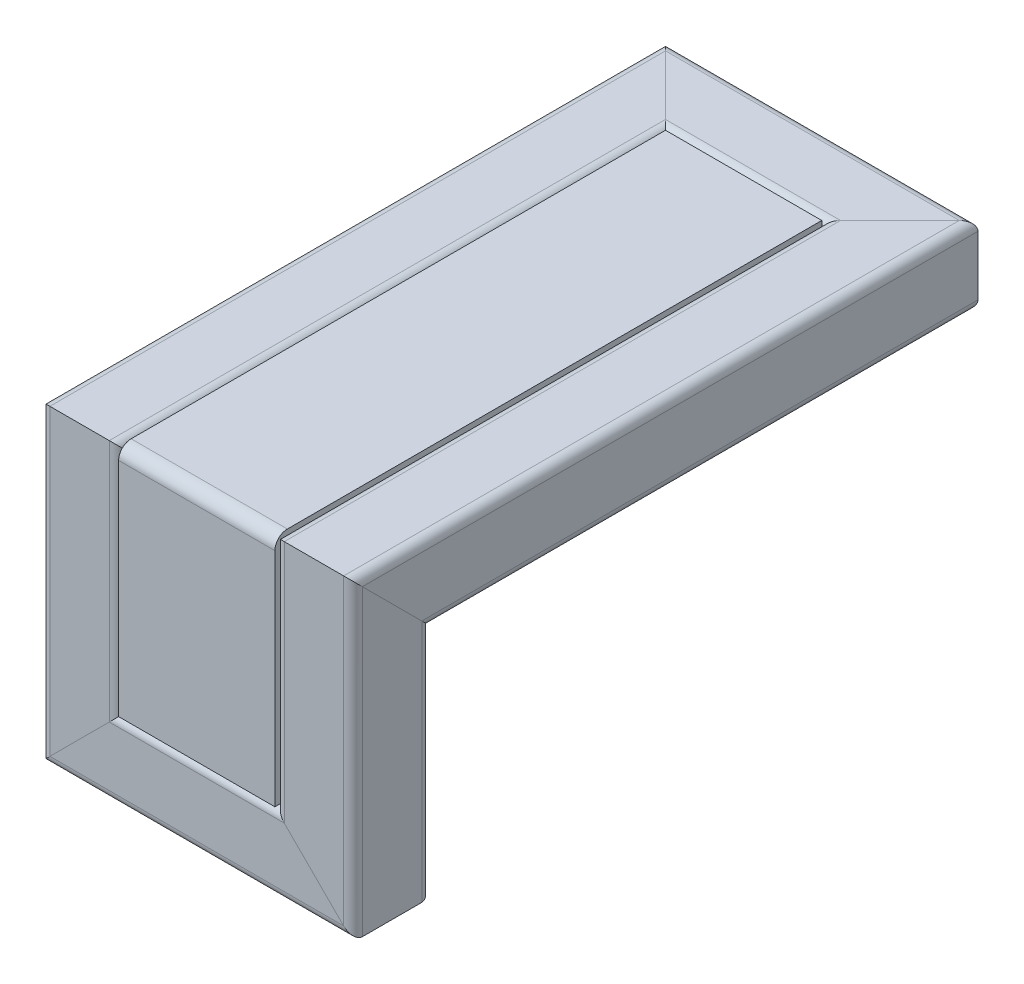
ISO-10303-21;
HEADER;
FILE_DESCRIPTION(('STEP AP214'),'2;1');
FILE_NAME('part.step','',(''),(''),'','','');
FILE_SCHEMA(('AUTOMOTIVE_DESIGN { 1 0 10303 214 1 1 1 1 }'));
ENDSEC;
DATA;
#1=APPLICATION_CONTEXT('core data for automotive mechanical design processes');
#2=APPLICATION_PROTOCOL_DEFINITION('international standard','automotive_design',2000,#1);
#3=PRODUCT_CONTEXT('',#1,'mechanical');
#4=PRODUCT('Part','Part','',(#3));
#5=PRODUCT_RELATED_PRODUCT_CATEGORY('part','',(#4));
#6=PRODUCT_DEFINITION_FORMATION('','',#4);
#7=PRODUCT_DEFINITION_CONTEXT('part definition',#1,'design');
#8=PRODUCT_DEFINITION('design','',#6,#7);
#9=PRODUCT_DEFINITION_SHAPE('','',#8);
#10=(LENGTH_UNIT() NAMED_UNIT(*) SI_UNIT(.MILLI.,.METRE.));
#11=(NAMED_UNIT(*) PLANE_ANGLE_UNIT() SI_UNIT($,.RADIAN.));
#12=(NAMED_UNIT(*) SI_UNIT($,.STERADIAN.) SOLID_ANGLE_UNIT());
#13=UNCERTAINTY_MEASURE_WITH_UNIT(LENGTH_MEASURE(1.E-05),#10,'distance_accuracy_value','');
#14=(GEOMETRIC_REPRESENTATION_CONTEXT(3) GLOBAL_UNCERTAINTY_ASSIGNED_CONTEXT((#13)) GLOBAL_UNIT_ASSIGNED_CONTEXT((#10,
#11,#12)) REPRESENTATION_CONTEXT('',''));
#15=CARTESIAN_POINT('',(0.,0.,0.));
#16=DIRECTION('',(0.,0.,1.));
#17=DIRECTION('',(1.,0.,0.));
#18=AXIS2_PLACEMENT_3D('',#15,#16,#17);
#19=CARTESIAN_POINT('',(-25.,98.,-4.00000000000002));
#20=DIRECTION('',(0.,-1.,0.));
#21=DIRECTION('',(0.,0.,-1.));
#22=AXIS2_PLACEMENT_3D('',#19,#20,#21);
#23=PLANE('',#22);
#24=DIRECTION('',(1.,0.,0.));
#25=VECTOR('',#24,1.);
#26=CARTESIAN_POINT('',(-25.,98.,-175.));
#27=LINE('',#26,#25);
#28=CARTESIAN_POINT('',(-25.,98.,-175.));
#29=VERTEX_POINT('',#28);
#30=CARTESIAN_POINT('',(25.,98.,-175.));
#31=VERTEX_POINT('',#30);
#32=EDGE_CURVE('E49',#29,#31,#27,.T.);
#33=ORIENTED_EDGE('',*,*,#32,.T.);
#34=DIRECTION('',(0.,0.,-1.));
#35=VECTOR('',#34,1.);
#36=CARTESIAN_POINT('',(25.,98.,-4.00000000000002));
#37=LINE('',#36,#35);
#38=CARTESIAN_POINT('',(25.,98.,-4.00000000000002));
#39=VERTEX_POINT('',#38);
#40=EDGE_CURVE('E110',#39,#31,#37,.T.);
#41=ORIENTED_EDGE('',*,*,#40,.F.);
#42=DIRECTION('',(1.,0.,0.));
#43=VECTOR('',#42,1.);
#44=CARTESIAN_POINT('',(-25.,98.,-4.00000000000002));
#45=LINE('',#44,#43);
#46=CARTESIAN_POINT('',(-25.,98.,-4.00000000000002));
#47=VERTEX_POINT('',#46);
#48=EDGE_CURVE('E12',#47,#39,#45,.T.);
#49=ORIENTED_EDGE('',*,*,#48,.F.);
#50=DIRECTION('',(0.,0.,-1.));
#51=VECTOR('',#50,1.);
#52=CARTESIAN_POINT('',(-25.,98.,-4.00000000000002));
#53=LINE('',#52,#51);
#54=EDGE_CURVE('E111',#47,#29,#53,.T.);
#55=ORIENTED_EDGE('',*,*,#54,.T.);
#56=EDGE_LOOP('',(#33,#41,#49,#55));
#57=FACE_BOUND('',#56,.T.);
#58=ADVANCED_FACE('F46',(#57),#23,.T.);
#59=CARTESIAN_POINT('',(-25.,96.,-4.));
#60=DIRECTION('',(1.,0.,0.));
#61=DIRECTION('',(0.,0.,-1.));
#62=AXIS2_PLACEMENT_3D('',#59,#60,#61);
#63=CYLINDRICAL_SURFACE('',#62,2.);
#64=ORIENTED_EDGE('',*,*,#48,.T.);
#65=CARTESIAN_POINT('',(25.,96.,-4.));
#66=DIRECTION('',(1.,0.,0.));
#67=DIRECTION('',(0.,0.,-1.));
#68=AXIS2_PLACEMENT_3D('',#65,#66,#67);
#69=CIRCLE('',#68,2.);
#70=CARTESIAN_POINT('',(25.,96.,-1.99999999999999));
#71=VERTEX_POINT('',#70);
#72=EDGE_CURVE('E125',#71,#39,#69,.F.);
#73=ORIENTED_EDGE('',*,*,#72,.F.);
#74=DIRECTION('',(1.,0.,0.));
#75=VECTOR('',#74,1.);
#76=CARTESIAN_POINT('',(-25.,96.,-1.99999999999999));
#77=LINE('',#76,#75);
#78=CARTESIAN_POINT('',(-25.,96.,-1.99999999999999));
#79=VERTEX_POINT('',#78);
#80=EDGE_CURVE('E54',#79,#71,#77,.T.);
#81=ORIENTED_EDGE('',*,*,#80,.F.);
#82=CARTESIAN_POINT('',(-25.,96.,-4.));
#83=DIRECTION('',(1.,0.,0.));
#84=DIRECTION('',(0.,0.,-1.));
#85=AXIS2_PLACEMENT_3D('',#82,#83,#84);
#86=CIRCLE('',#85,2.);
#87=EDGE_CURVE('E116',#79,#47,#86,.F.);
#88=ORIENTED_EDGE('',*,*,#87,.T.);
#89=EDGE_LOOP('',(#64,#73,#81,#88));
#90=FACE_BOUND('',#89,.T.);
#91=ADVANCED_FACE('F189',(#90),#63,.F.);
#92=CARTESIAN_POINT('',(-25.,25.,-2.));
#93=DIRECTION('',(0.,0.,-1.));
#94=DIRECTION('',(0.,1.,0.));
#95=AXIS2_PLACEMENT_3D('',#92,#93,#94);
#96=PLANE('',#95);
#97=ORIENTED_EDGE('',*,*,#80,.T.);
#98=DIRECTION('',(0.,1.,0.));
#99=VECTOR('',#98,1.);
#100=CARTESIAN_POINT('',(25.,25.,-2.));
#101=LINE('',#100,#99);
#102=CARTESIAN_POINT('',(25.,25.,-2.));
#103=VERTEX_POINT('',#102);
#104=EDGE_CURVE('E142',#103,#71,#101,.T.);
#105=ORIENTED_EDGE('',*,*,#104,.F.);
#106=DIRECTION('',(1.,0.,0.));
#107=VECTOR('',#106,1.);
#108=CARTESIAN_POINT('',(-25.,25.,-2.));
#109=LINE('',#108,#107);
#110=CARTESIAN_POINT('',(-25.,25.,-2.));
#111=VERTEX_POINT('',#110);
#112=EDGE_CURVE('E160',#111,#103,#109,.T.);
#113=ORIENTED_EDGE('',*,*,#112,.F.);
#114=DIRECTION('',(0.,1.,0.));
#115=VECTOR('',#114,1.);
#116=CARTESIAN_POINT('',(-25.,25.,-2.));
#117=LINE('',#116,#115);
#118=EDGE_CURVE('E156',#111,#79,#117,.T.);
#119=ORIENTED_EDGE('',*,*,#118,.T.);
#120=EDGE_LOOP('',(#97,#105,#113,#119));
#121=FACE_BOUND('',#120,.T.);
#122=ADVANCED_FACE('F188',(#121),#96,.T.);
#123=CARTESIAN_POINT('',(-25.,25.,-2.));
#124=DIRECTION('',(0.,1.,0.));
#125=DIRECTION('',(0.,0.,1.));
#126=AXIS2_PLACEMENT_3D('',#123,#124,#125);
#127=PLANE('',#126);
#128=ORIENTED_EDGE('',*,*,#112,.T.);
#129=DIRECTION('',(0.,0.,1.));
#130=VECTOR('',#129,1.);
#131=CARTESIAN_POINT('',(25.,25.,-2.));
#132=LINE('',#131,#130);
#133=CARTESIAN_POINT('',(25.,25.,0.));
#134=VERTEX_POINT('',#133);
#135=EDGE_CURVE('E139',#103,#134,#132,.T.);
#136=ORIENTED_EDGE('',*,*,#135,.T.);
#137=DIRECTION('',(1.,0.,0.));
#138=VECTOR('',#137,1.);
#139=CARTESIAN_POINT('',(-25.,25.,0.));
#140=LINE('',#139,#138);
#141=CARTESIAN_POINT('',(-25.,25.,0.));
#142=VERTEX_POINT('',#141);
#143=EDGE_CURVE('E162',#142,#134,#140,.T.);
#144=ORIENTED_EDGE('',*,*,#143,.F.);
#145=DIRECTION('',(0.,0.,1.));
#146=VECTOR('',#145,1.);
#147=CARTESIAN_POINT('',(-25.,25.,-2.));
#148=LINE('',#147,#146);
#149=EDGE_CURVE('E154',#111,#142,#148,.T.);
#150=ORIENTED_EDGE('',*,*,#149,.F.);
#151=EDGE_LOOP('',(#128,#136,#144,#150));
#152=FACE_BOUND('',#151,.T.);
#153=ADVANCED_FACE('F183',(#152),#127,.F.);
#154=CARTESIAN_POINT('',(-25.,25.,0.));
#155=DIRECTION('',(0.,0.,-1.));
#156=DIRECTION('',(0.,1.,0.));
#157=AXIS2_PLACEMENT_3D('',#154,#155,#156);
#158=PLANE('',#157);
#159=ORIENTED_EDGE('',*,*,#143,.T.);
#160=DIRECTION('',(0.,1.,0.));
#161=VECTOR('',#160,1.);
#162=CARTESIAN_POINT('',(25.,25.,0.));
#163=LINE('',#162,#161);
#164=CARTESIAN_POINT('',(25.,96.,0.));
#165=VERTEX_POINT('',#164);
#166=EDGE_CURVE('E136',#134,#165,#163,.T.);
#167=ORIENTED_EDGE('',*,*,#166,.T.);
#168=DIRECTION('',(1.,0.,0.));
#169=VECTOR('',#168,1.);
#170=CARTESIAN_POINT('',(-25.,96.,0.));
#171=LINE('',#170,#169);
#172=CARTESIAN_POINT('',(-25.,96.,0.));
#173=VERTEX_POINT('',#172);
#174=EDGE_CURVE('E164',#173,#165,#171,.T.);
#175=ORIENTED_EDGE('',*,*,#174,.F.);
#176=DIRECTION('',(0.,1.,0.));
#177=VECTOR('',#176,1.);
#178=CARTESIAN_POINT('',(-25.,25.,0.));
#179=LINE('',#178,#177);
#180=EDGE_CURVE('E152',#142,#173,#179,.T.);
#181=ORIENTED_EDGE('',*,*,#180,.F.);
#182=EDGE_LOOP('',(#159,#167,#175,#181));
#183=FACE_BOUND('',#182,.T.);
#184=ADVANCED_FACE('F179',(#183),#158,.F.);
#185=CARTESIAN_POINT('',(-25.,96.,-4.));
#186=DIRECTION('',(1.,0.,0.));
#187=DIRECTION('',(0.,0.,-1.));
#188=AXIS2_PLACEMENT_3D('',#185,#186,#187);
#189=CYLINDRICAL_SURFACE('',#188,4.);
#190=ORIENTED_EDGE('',*,*,#174,.T.);
#191=CARTESIAN_POINT('',(25.,96.,-4.));
#192=DIRECTION('',(-1.,0.,0.));
#193=DIRECTION('',(0.,0.,-1.));
#194=AXIS2_PLACEMENT_3D('',#191,#192,#193);
#195=CIRCLE('',#194,4.);
#196=CARTESIAN_POINT('',(25.,100.,-4.00000000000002));
#197=VERTEX_POINT('',#196);
#198=EDGE_CURVE('E131',#165,#197,#195,.T.);
#199=ORIENTED_EDGE('',*,*,#198,.T.);
#200=DIRECTION('',(1.,0.,0.));
#201=VECTOR('',#200,1.);
#202=CARTESIAN_POINT('',(-25.,100.,-4.00000000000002));
#203=LINE('',#202,#201);
#204=CARTESIAN_POINT('',(-25.,100.,-4.00000000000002));
#205=VERTEX_POINT('',#204);
#206=EDGE_CURVE('E166',#205,#197,#203,.T.);
#207=ORIENTED_EDGE('',*,*,#206,.F.);
#208=CARTESIAN_POINT('',(-25.,96.,-4.));
#209=DIRECTION('',(-1.,0.,0.));
#210=DIRECTION('',(0.,0.,-1.));
#211=AXIS2_PLACEMENT_3D('',#208,#209,#210);
#212=CIRCLE('',#211,4.);
#213=EDGE_CURVE('E150',#173,#205,#212,.T.);
#214=ORIENTED_EDGE('',*,*,#213,.F.);
#215=EDGE_LOOP('',(#190,#199,#207,#214));
#216=FACE_BOUND('',#215,.T.);
#217=ADVANCED_FACE('F175',(#216),#189,.T.);
#218=CARTESIAN_POINT('',(-25.,100.,-4.00000000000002));
#219=DIRECTION('',(0.,-1.,0.));
#220=DIRECTION('',(0.,0.,-1.));
#221=AXIS2_PLACEMENT_3D('',#218,#219,#220);
#222=PLANE('',#221);
#223=ORIENTED_EDGE('',*,*,#206,.T.);
#224=DIRECTION('',(0.,0.,-1.));
#225=VECTOR('',#224,1.);
#226=CARTESIAN_POINT('',(25.,100.,-4.00000000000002));
#227=LINE('',#226,#225);
#228=CARTESIAN_POINT('',(25.,100.,-175.));
#229=VERTEX_POINT('',#228);
#230=EDGE_CURVE('E129',#197,#229,#227,.T.);
#231=ORIENTED_EDGE('',*,*,#230,.T.);
#232=DIRECTION('',(1.,0.,0.));
#233=VECTOR('',#232,1.);
#234=CARTESIAN_POINT('',(-25.,100.,-175.));
#235=LINE('',#234,#233);
#236=CARTESIAN_POINT('',(-25.,100.,-175.));
#237=VERTEX_POINT('',#236);
#238=EDGE_CURVE('E115',#237,#229,#235,.T.);
#239=ORIENTED_EDGE('',*,*,#238,.F.);
#240=DIRECTION('',(0.,0.,-1.));
#241=VECTOR('',#240,1.);
#242=CARTESIAN_POINT('',(-25.,100.,-4.00000000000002));
#243=LINE('',#242,#241);
#244=EDGE_CURVE('E148',#205,#237,#243,.T.);
#245=ORIENTED_EDGE('',*,*,#244,.F.);
#246=EDGE_LOOP('',(#223,#231,#239,#245));
#247=FACE_BOUND('',#246,.T.);
#248=ADVANCED_FACE('F170',(#247),#222,.F.);
#249=CARTESIAN_POINT('',(-25.,100.,-175.));
#250=DIRECTION('',(0.,0.,1.));
#251=DIRECTION('',(1.,0.,0.));
#252=AXIS2_PLACEMENT_3D('',#249,#250,#251);
#253=PLANE('',#252);
#254=ORIENTED_EDGE('',*,*,#238,.T.);
#255=DIRECTION('',(0.,-1.,0.));
#256=VECTOR('',#255,1.);
#257=CARTESIAN_POINT('',(25.,100.,-175.));
#258=LINE('',#257,#256);
#259=EDGE_CURVE('E122',#229,#31,#258,.T.);
#260=ORIENTED_EDGE('',*,*,#259,.T.);
#261=ORIENTED_EDGE('',*,*,#32,.F.);
#262=DIRECTION('',(0.,-1.,0.));
#263=VECTOR('',#262,1.);
#264=CARTESIAN_POINT('',(-25.,100.,-175.));
#265=LINE('',#264,#263);
#266=EDGE_CURVE('E146',#237,#29,#265,.T.);
#267=ORIENTED_EDGE('',*,*,#266,.F.);
#268=EDGE_LOOP('',(#254,#260,#261,#267));
#269=FACE_BOUND('',#268,.T.);
#270=ADVANCED_FACE('F127',(#269),#253,.F.);
#271=CARTESIAN_POINT('',(-25.,96.,-4.));
#272=DIRECTION('',(-1.,0.,0.));
#273=DIRECTION('',(0.,0.,1.));
#274=AXIS2_PLACEMENT_3D('',#271,#272,#273);
#275=PLANE('',#274);
#276=ORIENTED_EDGE('',*,*,#54,.F.);
#277=ORIENTED_EDGE('',*,*,#87,.F.);
#278=ORIENTED_EDGE('',*,*,#118,.F.);
#279=ORIENTED_EDGE('',*,*,#149,.T.);
#280=ORIENTED_EDGE('',*,*,#180,.T.);
#281=ORIENTED_EDGE('',*,*,#213,.T.);
#282=ORIENTED_EDGE('',*,*,#244,.T.);
#283=ORIENTED_EDGE('',*,*,#266,.T.);
#284=EDGE_LOOP('',(#276,#277,#278,#279,#280,#281,#282,#283));
#285=FACE_BOUND('',#284,.T.);
#286=ADVANCED_FACE('F192',(#285),#275,.T.);
#287=CARTESIAN_POINT('',(25.,96.,-4.));
#288=DIRECTION('',(-1.,0.,0.));
#289=DIRECTION('',(0.,0.,1.));
#290=AXIS2_PLACEMENT_3D('',#287,#288,#289);
#291=PLANE('',#290);
#292=ORIENTED_EDGE('',*,*,#40,.T.);
#293=ORIENTED_EDGE('',*,*,#259,.F.);
#294=ORIENTED_EDGE('',*,*,#230,.F.);
#295=ORIENTED_EDGE('',*,*,#198,.F.);
#296=ORIENTED_EDGE('',*,*,#166,.F.);
#297=ORIENTED_EDGE('',*,*,#135,.F.);
#298=ORIENTED_EDGE('',*,*,#104,.T.);
#299=ORIENTED_EDGE('',*,*,#72,.T.);
#300=EDGE_LOOP('',(#292,#293,#294,#295,#296,#297,#298,#299));
#301=FACE_BOUND('',#300,.T.);
#302=ADVANCED_FACE('F120',(#301),#291,.F.);
#303=CLOSED_SHELL('',(#58,#91,#122,#153,#184,#217,#248,#270,#286,#302));
#304=MANIFOLD_SOLID_BREP('B2',#303);
#305=CARTESIAN_POINT('',(50.,25.,-22.));
#306=DIRECTION('',(0.,-1.,0.));
#307=DIRECTION('',(0.,0.,-1.));
#308=AXIS2_PLACEMENT_3D('',#305,#306,#307);
#309=PLANE('',#308);
#310=DIRECTION('',(-1.,0.,0.));
#311=VECTOR('',#310,1.);
#312=CARTESIAN_POINT('',(50.,25.,-22.));
#313=LINE('',#312,#311);
#314=CARTESIAN_POINT('',(25.,25.,-22.));
#315=VERTEX_POINT('',#314);
#316=CARTESIAN_POINT('',(-25.,25.,-22.));
#317=VERTEX_POINT('',#316);
#318=EDGE_CURVE('E441',#315,#317,#313,.T.);
#319=ORIENTED_EDGE('',*,*,#318,.T.);
#320=DIRECTION('',(0.,0.,1.));
#321=VECTOR('',#320,1.);
#322=CARTESIAN_POINT('',(-25.,25.,-22.));
#323=LINE('',#322,#321);
#324=CARTESIAN_POINT('',(-25.,25.,-3.));
#325=VERTEX_POINT('',#324);
#326=EDGE_CURVE('E302',#317,#325,#323,.T.);
#327=ORIENTED_EDGE('',*,*,#326,.T.);
#328=DIRECTION('',(-1.,0.,0.));
#329=VECTOR('',#328,1.);
#330=CARTESIAN_POINT('',(50.,25.,-3.));
#331=LINE('',#330,#329);
#332=CARTESIAN_POINT('',(25.,25.,-3.));
#333=VERTEX_POINT('',#332);
#334=EDGE_CURVE('E443',#333,#325,#331,.T.);
#335=ORIENTED_EDGE('',*,*,#334,.F.);
#336=DIRECTION('',(0.,0.,1.));
#337=VECTOR('',#336,1.);
#338=CARTESIAN_POINT('',(25.,25.,-22.));
#339=LINE('',#338,#337);
#340=EDGE_CURVE('E416',#315,#333,#339,.T.);
#341=ORIENTED_EDGE('',*,*,#340,.F.);
#342=EDGE_LOOP('',(#319,#327,#335,#341));
#343=FACE_BOUND('',#342,.T.);
#344=ADVANCED_FACE('F284',(#343),#309,.F.);
#345=CARTESIAN_POINT('',(50.,22.,-22.));
#346=DIRECTION('',(-1.,0.,0.));
#347=DIRECTION('',(0.,0.,1.));
#348=AXIS2_PLACEMENT_3D('',#345,#346,#347);
#349=CYLINDRICAL_SURFACE('',#348,3.00000000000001);
#350=DIRECTION('',(-1.,0.,0.));
#351=VECTOR('',#350,1.);
#352=CARTESIAN_POINT('',(50.,22.,-25.));
#353=LINE('',#352,#351);
#354=CARTESIAN_POINT('',(28.,22.,-25.));
#355=VERTEX_POINT('',#354);
#356=CARTESIAN_POINT('',(-28.,22.,-25.));
#357=VERTEX_POINT('',#356);
#358=EDGE_CURVE('E438',#355,#357,#353,.T.);
#359=ORIENTED_EDGE('',*,*,#358,.T.);
#360=CARTESIAN_POINT('',(-28.,22.,-22.));
#361=DIRECTION('',(0.707106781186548,-0.707106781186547,0.));
#362=DIRECTION('',(-0.707106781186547,-0.707106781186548,0.));
#363=AXIS2_PLACEMENT_3D('',#360,#361,#362);
#364=ELLIPSE('',#363,4.24264068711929,3.00000000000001);
#365=EDGE_CURVE('E437',#357,#317,#364,.T.);
#366=ORIENTED_EDGE('',*,*,#365,.T.);
#367=ORIENTED_EDGE('',*,*,#318,.F.);
#368=CARTESIAN_POINT('',(28.,22.,-22.));
#369=DIRECTION('',(0.707106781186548,0.707106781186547,0.));
#370=DIRECTION('',(-0.707106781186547,0.707106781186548,0.));
#371=AXIS2_PLACEMENT_3D('',#368,#369,#370);
#372=ELLIPSE('',#371,4.24264068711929,3.00000000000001);
#373=EDGE_CURVE('E466',#355,#315,#372,.T.);
#374=ORIENTED_EDGE('',*,*,#373,.F.);
#375=EDGE_LOOP('',(#359,#366,#367,#374));
#376=FACE_BOUND('',#375,.T.);
#377=ADVANCED_FACE('F528',(#376),#349,.T.);
#378=CARTESIAN_POINT('',(50.,3.,-25.));
#379=DIRECTION('',(0.,0.,1.));
#380=DIRECTION('',(0.,-1.,0.));
#381=AXIS2_PLACEMENT_3D('',#378,#379,#380);
#382=PLANE('',#381);
#383=DIRECTION('',(-1.,0.,0.));
#384=VECTOR('',#383,1.);
#385=CARTESIAN_POINT('',(50.,3.00000000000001,-25.));
#386=LINE('',#385,#384);
#387=CARTESIAN_POINT('',(47.,3.00000000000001,-25.));
#388=VERTEX_POINT('',#387);
#389=CARTESIAN_POINT('',(-47.,3.00000000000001,-25.));
#390=VERTEX_POINT('',#389);
#391=EDGE_CURVE('E434',#388,#390,#386,.T.);
#392=ORIENTED_EDGE('',*,*,#391,.T.);
#393=DIRECTION('',(0.707106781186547,0.707106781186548,0.));
#394=VECTOR('',#393,1.);
#395=CARTESIAN_POINT('',(1.49999999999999,51.5,-25.));
#396=LINE('',#395,#394);
#397=EDGE_CURVE('E433',#390,#357,#396,.T.);
#398=ORIENTED_EDGE('',*,*,#397,.T.);
#399=ORIENTED_EDGE('',*,*,#358,.F.);
#400=DIRECTION('',(-0.707106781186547,0.707106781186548,0.));
#401=VECTOR('',#400,1.);
#402=CARTESIAN_POINT('',(48.5,1.5,-25.));
#403=LINE('',#402,#401);
#404=EDGE_CURVE('E717',#388,#355,#403,.T.);
#405=ORIENTED_EDGE('',*,*,#404,.F.);
#406=EDGE_LOOP('',(#392,#398,#399,#405));
#407=FACE_BOUND('',#406,.T.);
#408=ADVANCED_FACE('F534',(#407),#382,.F.);
#409=CARTESIAN_POINT('',(50.,3.00000000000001,-22.));
#410=DIRECTION('',(-1.,0.,0.));
#411=DIRECTION('',(0.,0.,1.));
#412=AXIS2_PLACEMENT_3D('',#409,#410,#411);
#413=CYLINDRICAL_SURFACE('',#412,3.00000000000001);
#414=DIRECTION('',(-1.,0.,0.));
#415=VECTOR('',#414,1.);
#416=CARTESIAN_POINT('',(50.,0.,-22.));
#417=LINE('',#416,#415);
#418=CARTESIAN_POINT('',(50.,0.,-22.));
#419=VERTEX_POINT('',#418);
#420=CARTESIAN_POINT('',(-50.,0.,-22.));
#421=VERTEX_POINT('',#420);
#422=EDGE_CURVE('E430',#419,#421,#417,.T.);
#423=ORIENTED_EDGE('',*,*,#422,.T.);
#424=CARTESIAN_POINT('',(-47.,3.00000000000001,-22.));
#425=DIRECTION('',(0.707106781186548,-0.707106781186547,0.));
#426=DIRECTION('',(-0.707106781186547,-0.707106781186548,0.));
#427=AXIS2_PLACEMENT_3D('',#424,#425,#426);
#428=ELLIPSE('',#427,4.24264068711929,3.00000000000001);
#429=EDGE_CURVE('E429',#421,#390,#428,.T.);
#430=ORIENTED_EDGE('',*,*,#429,.T.);
#431=ORIENTED_EDGE('',*,*,#391,.F.);
#432=CARTESIAN_POINT('',(47.,3.00000000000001,-22.));
#433=DIRECTION('',(0.707106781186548,0.707106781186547,0.));
#434=DIRECTION('',(-0.707106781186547,0.707106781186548,0.));
#435=AXIS2_PLACEMENT_3D('',#432,#433,#434);
#436=ELLIPSE('',#435,4.24264068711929,3.00000000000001);
#437=EDGE_CURVE('E742',#419,#388,#436,.T.);
#438=ORIENTED_EDGE('',*,*,#437,.F.);
#439=EDGE_LOOP('',(#423,#430,#431,#438));
#440=FACE_BOUND('',#439,.T.);
#441=ADVANCED_FACE('F666',(#440),#413,.T.);
#442=CARTESIAN_POINT('',(50.,0.,-22.));
#443=DIRECTION('',(0.,1.,0.));
#444=DIRECTION('',(0.,0.,1.));
#445=AXIS2_PLACEMENT_3D('',#442,#443,#444);
#446=PLANE('',#445);
#447=DIRECTION('',(-1.,0.,0.));
#448=VECTOR('',#447,1.);
#449=CARTESIAN_POINT('',(50.,0.,-3.));
#450=LINE('',#449,#448);
#451=CARTESIAN_POINT('',(50.,0.,-3.));
#452=VERTEX_POINT('',#451);
#453=CARTESIAN_POINT('',(-50.,0.,-3.));
#454=VERTEX_POINT('',#453);
#455=EDGE_CURVE('E426',#452,#454,#450,.T.);
#456=ORIENTED_EDGE('',*,*,#455,.T.);
#457=DIRECTION('',(0.,0.,-1.));
#458=VECTOR('',#457,1.);
#459=CARTESIAN_POINT('',(-50.,0.,-22.));
#460=LINE('',#459,#458);
#461=EDGE_CURVE('E425',#454,#421,#460,.T.);
#462=ORIENTED_EDGE('',*,*,#461,.T.);
#463=ORIENTED_EDGE('',*,*,#422,.F.);
#464=DIRECTION('',(0.,0.,-1.));
#465=VECTOR('',#464,1.);
#466=CARTESIAN_POINT('',(50.,0.,-22.));
#467=LINE('',#466,#465);
#468=EDGE_CURVE('E745',#452,#419,#467,.T.);
#469=ORIENTED_EDGE('',*,*,#468,.F.);
#470=EDGE_LOOP('',(#456,#462,#463,#469));
#471=FACE_BOUND('',#470,.T.);
#472=ADVANCED_FACE('F655',(#471),#446,.F.);
#473=CARTESIAN_POINT('',(50.,3.,-3.));
#474=DIRECTION('',(-1.,0.,0.));
#475=DIRECTION('',(0.,0.,1.));
#476=AXIS2_PLACEMENT_3D('',#473,#474,#475);
#477=CYLINDRICAL_SURFACE('',#476,3.00000000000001);
#478=DIRECTION('',(-1.,0.,0.));
#479=VECTOR('',#478,1.);
#480=CARTESIAN_POINT('',(50.,3.,0.));
#481=LINE('',#480,#479);
#482=CARTESIAN_POINT('',(47.,3.,0.));
#483=VERTEX_POINT('',#482);
#484=CARTESIAN_POINT('',(-47.,3.,0.));
#485=VERTEX_POINT('',#484);
#486=EDGE_CURVE('E422',#483,#485,#481,.T.);
#487=ORIENTED_EDGE('',*,*,#486,.T.);
#488=CARTESIAN_POINT('',(-47.,3.,-3.));
#489=DIRECTION('',(0.707106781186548,-0.707106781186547,0.));
#490=DIRECTION('',(-0.707106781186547,-0.707106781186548,0.));
#491=AXIS2_PLACEMENT_3D('',#488,#489,#490);
#492=ELLIPSE('',#491,4.24264068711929,3.00000000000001);
#493=EDGE_CURVE('E421',#485,#454,#492,.T.);
#494=ORIENTED_EDGE('',*,*,#493,.T.);
#495=ORIENTED_EDGE('',*,*,#455,.F.);
#496=CARTESIAN_POINT('',(47.,3.,-3.));
#497=DIRECTION('',(0.707106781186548,0.707106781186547,0.));
#498=DIRECTION('',(-0.707106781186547,0.707106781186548,0.));
#499=AXIS2_PLACEMENT_3D('',#496,#497,#498);
#500=ELLIPSE('',#499,4.24264068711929,3.00000000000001);
#501=EDGE_CURVE('E732',#483,#452,#500,.T.);
#502=ORIENTED_EDGE('',*,*,#501,.F.);
#503=EDGE_LOOP('',(#487,#494,#495,#502));
#504=FACE_BOUND('',#503,.T.);
#505=ADVANCED_FACE('F644',(#504),#477,.T.);
#506=CARTESIAN_POINT('',(50.,3.,0.));
#507=DIRECTION('',(0.,0.,-1.));
#508=DIRECTION('',(0.,1.,0.));
#509=AXIS2_PLACEMENT_3D('',#506,#507,#508);
#510=PLANE('',#509);
#511=DIRECTION('',(-1.,0.,0.));
#512=VECTOR('',#511,1.);
#513=CARTESIAN_POINT('',(50.,22.,0.));
#514=LINE('',#513,#512);
#515=CARTESIAN_POINT('',(28.,22.,0.));
#516=VERTEX_POINT('',#515);
#517=CARTESIAN_POINT('',(-28.,22.,0.));
#518=VERTEX_POINT('',#517);
#519=EDGE_CURVE('E417',#516,#518,#514,.T.);
#520=ORIENTED_EDGE('',*,*,#519,.T.);
#521=DIRECTION('',(-0.707106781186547,-0.707106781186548,0.));
#522=VECTOR('',#521,1.);
#523=CARTESIAN_POINT('',(1.49999999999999,51.5,0.));
#524=LINE('',#523,#522);
#525=EDGE_CURVE('E420',#518,#485,#524,.T.);
#526=ORIENTED_EDGE('',*,*,#525,.T.);
#527=ORIENTED_EDGE('',*,*,#486,.F.);
#528=DIRECTION('',(0.707106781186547,-0.707106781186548,0.));
#529=VECTOR('',#528,1.);
#530=CARTESIAN_POINT('',(48.5,1.5,0.));
#531=LINE('',#530,#529);
#532=EDGE_CURVE('E735',#516,#483,#531,.T.);
#533=ORIENTED_EDGE('',*,*,#532,.F.);
#534=EDGE_LOOP('',(#520,#526,#527,#533));
#535=FACE_BOUND('',#534,.T.);
#536=ADVANCED_FACE('F633',(#535),#510,.F.);
#537=CARTESIAN_POINT('',(50.,22.,-3.));
#538=DIRECTION('',(-1.,0.,0.));
#539=DIRECTION('',(0.,0.,1.));
#540=AXIS2_PLACEMENT_3D('',#537,#538,#539);
#541=CYLINDRICAL_SURFACE('',#540,3.00000000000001);
#542=ORIENTED_EDGE('',*,*,#334,.T.);
#543=CARTESIAN_POINT('',(-28.,22.,-3.));
#544=DIRECTION('',(0.707106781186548,-0.707106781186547,0.));
#545=DIRECTION('',(-0.707106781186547,-0.707106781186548,0.));
#546=AXIS2_PLACEMENT_3D('',#543,#544,#545);
#547=ELLIPSE('',#546,4.24264068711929,3.00000000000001);
#548=EDGE_CURVE('E446',#325,#518,#547,.T.);
#549=ORIENTED_EDGE('',*,*,#548,.T.);
#550=ORIENTED_EDGE('',*,*,#519,.F.);
#551=CARTESIAN_POINT('',(28.,22.,-3.));
#552=DIRECTION('',(0.707106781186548,0.707106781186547,0.));
#553=DIRECTION('',(-0.707106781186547,0.707106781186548,0.));
#554=AXIS2_PLACEMENT_3D('',#551,#552,#553);
#555=ELLIPSE('',#554,4.24264068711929,3.00000000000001);
#556=EDGE_CURVE('E750',#333,#516,#555,.T.);
#557=ORIENTED_EDGE('',*,*,#556,.F.);
#558=EDGE_LOOP('',(#542,#549,#550,#557));
#559=FACE_BOUND('',#558,.T.);
#560=ADVANCED_FACE('F624',(#559),#541,.T.);
#561=CARTESIAN_POINT('',(50.,3.00000000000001,-23.));
#562=DIRECTION('',(0.,0.,1.));
#563=DIRECTION('',(1.,0.,0.));
#564=AXIS2_PLACEMENT_3D('',#561,#562,#563);
#565=PLANE('',#564);
#566=DIRECTION('',(0.707106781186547,0.707106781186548,0.));
#567=VECTOR('',#566,1.);
#568=CARTESIAN_POINT('',(1.49999999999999,51.5,-23.));
#569=LINE('',#568,#567);
#570=CARTESIAN_POINT('',(-47.,3.00000000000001,-23.));
#571=VERTEX_POINT('',#570);
#572=CARTESIAN_POINT('',(-28.,22.,-23.));
#573=VERTEX_POINT('',#572);
#574=EDGE_CURVE('E462',#571,#573,#569,.T.);
#575=ORIENTED_EDGE('',*,*,#574,.F.);
#576=DIRECTION('',(-1.,0.,0.));
#577=VECTOR('',#576,1.);
#578=CARTESIAN_POINT('',(50.,3.00000000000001,-23.));
#579=LINE('',#578,#577);
#580=CARTESIAN_POINT('',(47.,3.00000000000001,-23.));
#581=VERTEX_POINT('',#580);
#582=EDGE_CURVE('E413',#581,#571,#579,.T.);
#583=ORIENTED_EDGE('',*,*,#582,.F.);
#584=DIRECTION('',(-0.707106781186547,0.707106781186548,0.));
#585=VECTOR('',#584,1.);
#586=CARTESIAN_POINT('',(48.5,1.5,-23.));
#587=LINE('',#586,#585);
#588=CARTESIAN_POINT('',(28.,22.,-23.));
#589=VERTEX_POINT('',#588);
#590=EDGE_CURVE('E392',#581,#589,#587,.T.);
#591=ORIENTED_EDGE('',*,*,#590,.T.);
#592=DIRECTION('',(-1.,0.,0.));
#593=VECTOR('',#592,1.);
#594=CARTESIAN_POINT('',(50.,22.,-23.));
#595=LINE('',#594,#593);
#596=EDGE_CURVE('E389',#589,#573,#595,.T.);
#597=ORIENTED_EDGE('',*,*,#596,.T.);
#598=EDGE_LOOP('',(#575,#583,#591,#597));
#599=FACE_BOUND('',#598,.T.);
#600=ADVANCED_FACE('F493',(#599),#565,.T.);
#601=CARTESIAN_POINT('',(50.,22.,-22.));
#602=DIRECTION('',(-1.,0.,0.));
#603=DIRECTION('',(0.,0.,1.));
#604=AXIS2_PLACEMENT_3D('',#601,#602,#603);
#605=CYLINDRICAL_SURFACE('',#604,1.00000000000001);
#606=CARTESIAN_POINT('',(-28.,22.,-22.));
#607=DIRECTION('',(0.707106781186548,-0.707106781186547,0.));
#608=DIRECTION('',(-0.707106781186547,-0.707106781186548,0.));
#609=AXIS2_PLACEMENT_3D('',#606,#607,#608);
#610=ELLIPSE('',#609,1.4142135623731,1.00000000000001);
#611=CARTESIAN_POINT('',(-27.,23.,-22.));
#612=VERTEX_POINT('',#611);
#613=EDGE_CURVE('E465',#573,#612,#610,.T.);
#614=ORIENTED_EDGE('',*,*,#613,.F.);
#615=ORIENTED_EDGE('',*,*,#596,.F.);
#616=CARTESIAN_POINT('',(28.,22.,-22.));
#617=DIRECTION('',(0.707106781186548,0.707106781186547,0.));
#618=DIRECTION('',(-0.707106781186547,0.707106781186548,0.));
#619=AXIS2_PLACEMENT_3D('',#616,#617,#618);
#620=ELLIPSE('',#619,1.4142135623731,1.00000000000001);
#621=CARTESIAN_POINT('',(27.,23.,-22.));
#622=VERTEX_POINT('',#621);
#623=EDGE_CURVE('E368',#589,#622,#620,.T.);
#624=ORIENTED_EDGE('',*,*,#623,.T.);
#625=DIRECTION('',(-1.,0.,0.));
#626=VECTOR('',#625,1.);
#627=CARTESIAN_POINT('',(50.,23.,-22.));
#628=LINE('',#627,#626);
#629=EDGE_CURVE('E376',#622,#612,#628,.T.);
#630=ORIENTED_EDGE('',*,*,#629,.T.);
#631=EDGE_LOOP('',(#614,#615,#624,#630));
#632=FACE_BOUND('',#631,.T.);
#633=ADVANCED_FACE('F387',(#632),#605,.F.);
#634=CARTESIAN_POINT('',(50.,23.,-22.));
#635=DIRECTION('',(0.,-1.,0.));
#636=DIRECTION('',(0.,0.,-1.));
#637=AXIS2_PLACEMENT_3D('',#634,#635,#636);
#638=PLANE('',#637);
#639=DIRECTION('',(0.,0.,1.));
#640=VECTOR('',#639,1.);
#641=CARTESIAN_POINT('',(-27.,23.,-22.));
#642=LINE('',#641,#640);
#643=CARTESIAN_POINT('',(-27.,23.,-3.));
#644=VERTEX_POINT('',#643);
#645=EDGE_CURVE('E383',#612,#644,#642,.T.);
#646=ORIENTED_EDGE('',*,*,#645,.F.);
#647=ORIENTED_EDGE('',*,*,#629,.F.);
#648=DIRECTION('',(0.,0.,1.));
#649=VECTOR('',#648,1.);
#650=CARTESIAN_POINT('',(27.,23.,-22.));
#651=LINE('',#650,#649);
#652=CARTESIAN_POINT('',(27.,23.,-3.));
#653=VERTEX_POINT('',#652);
#654=EDGE_CURVE('E362',#622,#653,#651,.T.);
#655=ORIENTED_EDGE('',*,*,#654,.T.);
#656=DIRECTION('',(-1.,0.,0.));
#657=VECTOR('',#656,1.);
#658=CARTESIAN_POINT('',(50.,23.,-3.));
#659=LINE('',#658,#657);
#660=EDGE_CURVE('E375',#653,#644,#659,.T.);
#661=ORIENTED_EDGE('',*,*,#660,.T.);
#662=EDGE_LOOP('',(#646,#647,#655,#661));
#663=FACE_BOUND('',#662,.T.);
#664=ADVANCED_FACE('F380',(#663),#638,.T.);
#665=CARTESIAN_POINT('',(50.,22.,-3.));
#666=DIRECTION('',(-1.,0.,0.));
#667=DIRECTION('',(0.,0.,1.));
#668=AXIS2_PLACEMENT_3D('',#665,#666,#667);
#669=CYLINDRICAL_SURFACE('',#668,1.);
#670=CARTESIAN_POINT('',(-28.,22.,-3.));
#671=DIRECTION('',(0.707106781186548,-0.707106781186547,0.));
#672=DIRECTION('',(-0.707106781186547,-0.707106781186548,0.));
#673=AXIS2_PLACEMENT_3D('',#670,#671,#672);
#674=ELLIPSE('',#673,1.4142135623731,1.);
#675=CARTESIAN_POINT('',(-28.,22.,-2.));
#676=VERTEX_POINT('',#675);
#677=EDGE_CURVE('E470',#644,#676,#674,.T.);
#678=ORIENTED_EDGE('',*,*,#677,.F.);
#679=ORIENTED_EDGE('',*,*,#660,.F.);
#680=CARTESIAN_POINT('',(28.,22.,-3.));
#681=DIRECTION('',(0.707106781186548,0.707106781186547,0.));
#682=DIRECTION('',(-0.707106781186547,0.707106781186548,0.));
#683=AXIS2_PLACEMENT_3D('',#680,#681,#682);
#684=ELLIPSE('',#683,1.4142135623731,1.);
#685=CARTESIAN_POINT('',(28.,22.,-2.));
#686=VERTEX_POINT('',#685);
#687=EDGE_CURVE('E371',#653,#686,#684,.T.);
#688=ORIENTED_EDGE('',*,*,#687,.T.);
#689=DIRECTION('',(-1.,0.,0.));
#690=VECTOR('',#689,1.);
#691=CARTESIAN_POINT('',(50.,22.,-2.));
#692=LINE('',#691,#690);
#693=EDGE_CURVE('E409',#686,#676,#692,.T.);
#694=ORIENTED_EDGE('',*,*,#693,.T.);
#695=EDGE_LOOP('',(#678,#679,#688,#694));
#696=FACE_BOUND('',#695,.T.);
#697=ADVANCED_FACE('F518',(#696),#669,.F.);
#698=CARTESIAN_POINT('',(50.,3.,-2.));
#699=DIRECTION('',(0.,0.,-1.));
#700=DIRECTION('',(-1.,0.,0.));
#701=AXIS2_PLACEMENT_3D('',#698,#699,#700);
#702=PLANE('',#701);
#703=DIRECTION('',(-0.707106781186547,-0.707106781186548,0.));
#704=VECTOR('',#703,1.);
#705=CARTESIAN_POINT('',(1.49999999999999,51.5,-2.));
#706=LINE('',#705,#704);
#707=CARTESIAN_POINT('',(-47.,3.,-2.));
#708=VERTEX_POINT('',#707);
#709=EDGE_CURVE('E473',#676,#708,#706,.T.);
#710=ORIENTED_EDGE('',*,*,#709,.F.);
#711=ORIENTED_EDGE('',*,*,#693,.F.);
#712=DIRECTION('',(0.707106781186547,-0.707106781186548,0.));
#713=VECTOR('',#712,1.);
#714=CARTESIAN_POINT('',(48.5,1.5,-2.));
#715=LINE('',#714,#713);
#716=CARTESIAN_POINT('',(47.,3.,-2.));
#717=VERTEX_POINT('',#716);
#718=EDGE_CURVE('E408',#686,#717,#715,.T.);
#719=ORIENTED_EDGE('',*,*,#718,.T.);
#720=DIRECTION('',(-1.,0.,0.));
#721=VECTOR('',#720,1.);
#722=CARTESIAN_POINT('',(50.,3.,-2.));
#723=LINE('',#722,#721);
#724=EDGE_CURVE('E405',#717,#708,#723,.T.);
#725=ORIENTED_EDGE('',*,*,#724,.T.);
#726=EDGE_LOOP('',(#710,#711,#719,#725));
#727=FACE_BOUND('',#726,.T.);
#728=ADVANCED_FACE('F513',(#727),#702,.T.);
#729=CARTESIAN_POINT('',(50.,3.,-3.));
#730=DIRECTION('',(-1.,0.,0.));
#731=DIRECTION('',(0.,0.,1.));
#732=AXIS2_PLACEMENT_3D('',#729,#730,#731);
#733=CYLINDRICAL_SURFACE('',#732,1.);
#734=CARTESIAN_POINT('',(-47.,3.,-3.));
#735=DIRECTION('',(0.707106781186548,-0.707106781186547,0.));
#736=DIRECTION('',(-0.707106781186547,-0.707106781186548,0.));
#737=AXIS2_PLACEMENT_3D('',#734,#735,#736);
#738=ELLIPSE('',#737,1.4142135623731,1.);
#739=CARTESIAN_POINT('',(-48.,2.,-3.));
#740=VERTEX_POINT('',#739);
#741=EDGE_CURVE('E475',#708,#740,#738,.T.);
#742=ORIENTED_EDGE('',*,*,#741,.F.);
#743=ORIENTED_EDGE('',*,*,#724,.F.);
#744=CARTESIAN_POINT('',(47.,3.,-3.));
#745=DIRECTION('',(0.707106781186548,0.707106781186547,0.));
#746=DIRECTION('',(-0.707106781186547,0.707106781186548,0.));
#747=AXIS2_PLACEMENT_3D('',#744,#745,#746);
#748=ELLIPSE('',#747,1.4142135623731,1.);
#749=CARTESIAN_POINT('',(48.,2.,-3.));
#750=VERTEX_POINT('',#749);
#751=EDGE_CURVE('E404',#717,#750,#748,.T.);
#752=ORIENTED_EDGE('',*,*,#751,.T.);
#753=DIRECTION('',(-1.,0.,0.));
#754=VECTOR('',#753,1.);
#755=CARTESIAN_POINT('',(50.,2.,-3.));
#756=LINE('',#755,#754);
#757=EDGE_CURVE('E401',#750,#740,#756,.T.);
#758=ORIENTED_EDGE('',*,*,#757,.T.);
#759=EDGE_LOOP('',(#742,#743,#752,#758));
#760=FACE_BOUND('',#759,.T.);
#761=ADVANCED_FACE('F510',(#760),#733,.F.);
#762=CARTESIAN_POINT('',(50.,2.,-22.));
#763=DIRECTION('',(0.,1.,0.));
#764=DIRECTION('',(0.,0.,1.));
#765=AXIS2_PLACEMENT_3D('',#762,#763,#764);
#766=PLANE('',#765);
#767=DIRECTION('',(0.,0.,-1.));
#768=VECTOR('',#767,1.);
#769=CARTESIAN_POINT('',(-48.,2.,-22.));
#770=LINE('',#769,#768);
#771=CARTESIAN_POINT('',(-48.,2.,-22.));
#772=VERTEX_POINT('',#771);
#773=EDGE_CURVE('E288',#740,#772,#770,.T.);
#774=ORIENTED_EDGE('',*,*,#773,.F.);
#775=ORIENTED_EDGE('',*,*,#757,.F.);
#776=DIRECTION('',(0.,0.,-1.));
#777=VECTOR('',#776,1.);
#778=CARTESIAN_POINT('',(48.,2.,-22.));
#779=LINE('',#778,#777);
#780=CARTESIAN_POINT('',(48.,2.,-22.));
#781=VERTEX_POINT('',#780);
#782=EDGE_CURVE('E400',#750,#781,#779,.T.);
#783=ORIENTED_EDGE('',*,*,#782,.T.);
#784=DIRECTION('',(-1.,0.,0.));
#785=VECTOR('',#784,1.);
#786=CARTESIAN_POINT('',(50.,2.,-22.));
#787=LINE('',#786,#785);
#788=EDGE_CURVE('E396',#781,#772,#787,.T.);
#789=ORIENTED_EDGE('',*,*,#788,.T.);
#790=EDGE_LOOP('',(#774,#775,#783,#789));
#791=FACE_BOUND('',#790,.T.);
#792=ADVANCED_FACE('F486',(#791),#766,.T.);
#793=CARTESIAN_POINT('',(50.,3.00000000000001,-22.));
#794=DIRECTION('',(-1.,0.,0.));
#795=DIRECTION('',(0.,0.,1.));
#796=AXIS2_PLACEMENT_3D('',#793,#794,#795);
#797=CYLINDRICAL_SURFACE('',#796,1.00000000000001);
#798=CARTESIAN_POINT('',(-47.,3.00000000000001,-22.));
#799=DIRECTION('',(0.707106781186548,-0.707106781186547,0.));
#800=DIRECTION('',(-0.707106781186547,-0.707106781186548,0.));
#801=AXIS2_PLACEMENT_3D('',#798,#799,#800);
#802=ELLIPSE('',#801,1.4142135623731,1.00000000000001);
#803=EDGE_CURVE('E44',#772,#571,#802,.T.);
#804=ORIENTED_EDGE('',*,*,#803,.F.);
#805=ORIENTED_EDGE('',*,*,#788,.F.);
#806=CARTESIAN_POINT('',(47.,3.00000000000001,-22.));
#807=DIRECTION('',(0.707106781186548,0.707106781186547,0.));
#808=DIRECTION('',(-0.707106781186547,0.707106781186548,0.));
#809=AXIS2_PLACEMENT_3D('',#806,#807,#808);
#810=ELLIPSE('',#809,1.4142135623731,1.00000000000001);
#811=EDGE_CURVE('E399',#781,#581,#810,.T.);
#812=ORIENTED_EDGE('',*,*,#811,.T.);
#813=ORIENTED_EDGE('',*,*,#582,.T.);
#814=EDGE_LOOP('',(#804,#805,#812,#813));
#815=FACE_BOUND('',#814,.T.);
#816=ADVANCED_FACE('F489',(#815),#797,.F.);
#817=CARTESIAN_POINT('',(50.,0.,0.));
#818=DIRECTION('',(0.707106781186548,0.707106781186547,0.));
#819=DIRECTION('',(-0.707106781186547,0.707106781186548,0.));
#820=AXIS2_PLACEMENT_3D('',#817,#818,#819);
#821=PLANE('',#820);
#822=ORIENTED_EDGE('',*,*,#811,.F.);
#823=ORIENTED_EDGE('',*,*,#782,.F.);
#824=ORIENTED_EDGE('',*,*,#751,.F.);
#825=ORIENTED_EDGE('',*,*,#718,.F.);
#826=ORIENTED_EDGE('',*,*,#687,.F.);
#827=ORIENTED_EDGE('',*,*,#654,.F.);
#828=ORIENTED_EDGE('',*,*,#623,.F.);
#829=ORIENTED_EDGE('',*,*,#590,.F.);
#830=EDGE_LOOP('',(#822,#823,#824,#825,#826,#827,#828,#829));
#831=FACE_BOUND('',#830,.T.);
#832=ORIENTED_EDGE('',*,*,#340,.T.);
#833=ORIENTED_EDGE('',*,*,#556,.T.);
#834=ORIENTED_EDGE('',*,*,#532,.T.);
#835=ORIENTED_EDGE('',*,*,#501,.T.);
#836=ORIENTED_EDGE('',*,*,#468,.T.);
#837=ORIENTED_EDGE('',*,*,#437,.T.);
#838=ORIENTED_EDGE('',*,*,#404,.T.);
#839=ORIENTED_EDGE('',*,*,#373,.T.);
#840=EDGE_LOOP('',(#832,#833,#834,#835,#836,#837,#838,#839));
#841=FACE_BOUND('',#840,.T.);
#842=ADVANCED_FACE('F364',(#831,#841),#821,.T.);
#843=CARTESIAN_POINT('',(-50.,0.,0.));
#844=DIRECTION('',(0.707106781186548,-0.707106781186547,0.));
#845=DIRECTION('',(0.707106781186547,0.707106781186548,0.));
#846=AXIS2_PLACEMENT_3D('',#843,#844,#845);
#847=PLANE('',#846);
#848=ORIENTED_EDGE('',*,*,#574,.T.);
#849=ORIENTED_EDGE('',*,*,#613,.T.);
#850=ORIENTED_EDGE('',*,*,#645,.T.);
#851=ORIENTED_EDGE('',*,*,#677,.T.);
#852=ORIENTED_EDGE('',*,*,#709,.T.);
#853=ORIENTED_EDGE('',*,*,#741,.T.);
#854=ORIENTED_EDGE('',*,*,#773,.T.);
#855=ORIENTED_EDGE('',*,*,#803,.T.);
#856=EDGE_LOOP('',(#848,#849,#850,#851,#852,#853,#854,#855));
#857=FACE_BOUND('',#856,.T.);
#858=ORIENTED_EDGE('',*,*,#365,.F.);
#859=ORIENTED_EDGE('',*,*,#397,.F.);
#860=ORIENTED_EDGE('',*,*,#429,.F.);
#861=ORIENTED_EDGE('',*,*,#461,.F.);
#862=ORIENTED_EDGE('',*,*,#493,.F.);
#863=ORIENTED_EDGE('',*,*,#525,.F.);
#864=ORIENTED_EDGE('',*,*,#548,.F.);
#865=ORIENTED_EDGE('',*,*,#326,.F.);
#866=EDGE_LOOP('',(#858,#859,#860,#861,#862,#863,#864,#865));
#867=FACE_BOUND('',#866,.T.);
#868=ADVANCED_FACE('F286',(#857,#867),#847,.F.);
#869=CLOSED_SHELL('',(#344,#377,#408,#441,#472,#505,#536,#560,#600,#633,#664,#697,#728,#761,
#792,#816,#842,#868));
#870=MANIFOLD_SOLID_BREP('B6',#869);
#871=CARTESIAN_POINT('',(-25.,0.,-22.));
#872=DIRECTION('',(-1.,0.,0.));
#873=DIRECTION('',(0.,0.,1.));
#874=AXIS2_PLACEMENT_3D('',#871,#872,#873);
#875=PLANE('',#874);
#876=DIRECTION('',(0.,0.,1.));
#877=VECTOR('',#876,1.);
#878=CARTESIAN_POINT('',(-25.,25.,-22.));
#879=LINE('',#878,#877);
#880=CARTESIAN_POINT('',(-25.,25.,-22.));
#881=VERTEX_POINT('',#880);
#882=CARTESIAN_POINT('',(-25.,25.,-3.));
#883=VERTEX_POINT('',#882);
#884=EDGE_CURVE('E892',#881,#883,#879,.T.);
#885=ORIENTED_EDGE('',*,*,#884,.F.);
#886=DIRECTION('',(0.,1.,0.));
#887=VECTOR('',#886,1.);
#888=CARTESIAN_POINT('',(-25.,0.,-22.));
#889=LINE('',#888,#887);
#890=CARTESIAN_POINT('',(-25.,78.,-22.));
#891=VERTEX_POINT('',#890);
#892=EDGE_CURVE('E783',#881,#891,#889,.T.);
#893=ORIENTED_EDGE('',*,*,#892,.T.);
#894=DIRECTION('',(0.,0.707106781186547,0.707106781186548));
#895=VECTOR('',#894,1.);
#896=CARTESIAN_POINT('',(-25.,39.,-61.));
#897=LINE('',#896,#895);
#898=CARTESIAN_POINT('',(-25.,97.,-3.));
#899=VERTEX_POINT('',#898);
#900=EDGE_CURVE('E930',#891,#899,#897,.T.);
#901=ORIENTED_EDGE('',*,*,#900,.T.);
#902=DIRECTION('',(0.,1.,0.));
#903=VECTOR('',#902,1.);
#904=CARTESIAN_POINT('',(-25.,0.,-3.));
#905=LINE('',#904,#903);
#906=EDGE_CURVE('E931',#883,#899,#905,.T.);
#907=ORIENTED_EDGE('',*,*,#906,.F.);
#908=EDGE_LOOP('',(#885,#893,#901,#907));
#909=FACE_BOUND('',#908,.T.);
#910=ADVANCED_FACE('F768',(#909),#875,.F.);
#911=CARTESIAN_POINT('',(-28.,0.,-22.));
#912=DIRECTION('',(0.,1.,0.));
#913=DIRECTION('',(0.,0.,1.));
#914=AXIS2_PLACEMENT_3D('',#911,#912,#913);
#915=CYLINDRICAL_SURFACE('',#914,3.00000000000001);
#916=CARTESIAN_POINT('',(-28.,22.,-22.));
#917=DIRECTION('',(0.707106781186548,-0.707106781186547,0.));
#918=DIRECTION('',(0.707106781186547,0.707106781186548,0.));
#919=AXIS2_PLACEMENT_3D('',#916,#917,#918);
#920=ELLIPSE('',#919,4.24264068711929,3.00000000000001);
#921=CARTESIAN_POINT('',(-28.,22.,-25.));
#922=VERTEX_POINT('',#921);
#923=EDGE_CURVE('E1014',#922,#881,#920,.T.);
#924=ORIENTED_EDGE('',*,*,#923,.F.);
#925=DIRECTION('',(0.,1.,0.));
#926=VECTOR('',#925,1.);
#927=CARTESIAN_POINT('',(-28.,0.,-25.));
#928=LINE('',#927,#926);
#929=CARTESIAN_POINT('',(-28.,75.,-25.));
#930=VERTEX_POINT('',#929);
#931=EDGE_CURVE('E926',#922,#930,#928,.T.);
#932=ORIENTED_EDGE('',*,*,#931,.T.);
#933=CARTESIAN_POINT('',(-28.,78.,-22.));
#934=DIRECTION('',(0.,-0.707106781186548,0.707106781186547));
#935=DIRECTION('',(0.,0.707106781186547,0.707106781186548));
#936=AXIS2_PLACEMENT_3D('',#933,#934,#935);
#937=ELLIPSE('',#936,4.24264068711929,3.00000000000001);
#938=EDGE_CURVE('E928',#930,#891,#937,.T.);
#939=ORIENTED_EDGE('',*,*,#938,.T.);
#940=ORIENTED_EDGE('',*,*,#892,.F.);
#941=EDGE_LOOP('',(#924,#932,#939,#940));
#942=FACE_BOUND('',#941,.T.);
#943=ADVANCED_FACE('F1043',(#942),#915,.T.);
#944=CARTESIAN_POINT('',(-47.,0.,-25.));
#945=DIRECTION('',(0.,0.,1.));
#946=DIRECTION('',(1.,0.,0.));
#947=AXIS2_PLACEMENT_3D('',#944,#945,#946);
#948=PLANE('',#947);
#949=DIRECTION('',(0.707106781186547,0.707106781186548,0.));
#950=VECTOR('',#949,1.);
#951=CARTESIAN_POINT('',(-48.5,1.50000000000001,-25.));
#952=LINE('',#951,#950);
#953=CARTESIAN_POINT('',(-47.,3.00000000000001,-25.));
#954=VERTEX_POINT('',#953);
#955=EDGE_CURVE('E1017',#954,#922,#952,.T.);
#956=ORIENTED_EDGE('',*,*,#955,.F.);
#957=DIRECTION('',(0.,1.,0.));
#958=VECTOR('',#957,1.);
#959=CARTESIAN_POINT('',(-47.,0.,-25.));
#960=LINE('',#959,#958);
#961=CARTESIAN_POINT('',(-47.,75.,-25.));
#962=VERTEX_POINT('',#961);
#963=EDGE_CURVE('E923',#954,#962,#960,.T.);
#964=ORIENTED_EDGE('',*,*,#963,.T.);
#965=DIRECTION('',(1.,0.,0.));
#966=VECTOR('',#965,1.);
#967=CARTESIAN_POINT('',(-47.,75.,-25.));
#968=LINE('',#967,#966);
#969=EDGE_CURVE('E925',#962,#930,#968,.T.);
#970=ORIENTED_EDGE('',*,*,#969,.T.);
#971=ORIENTED_EDGE('',*,*,#931,.F.);
#972=EDGE_LOOP('',(#956,#964,#970,#971));
#973=FACE_BOUND('',#972,.T.);
#974=ADVANCED_FACE('F1045',(#973),#948,.F.);
#975=CARTESIAN_POINT('',(-47.,0.,-22.));
#976=DIRECTION('',(0.,1.,0.));
#977=DIRECTION('',(0.,0.,1.));
#978=AXIS2_PLACEMENT_3D('',#975,#976,#977);
#979=CYLINDRICAL_SURFACE('',#978,3.00000000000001);
#980=CARTESIAN_POINT('',(-47.,3.00000000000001,-22.));
#981=DIRECTION('',(0.707106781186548,-0.707106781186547,0.));
#982=DIRECTION('',(0.707106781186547,0.707106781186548,0.));
#983=AXIS2_PLACEMENT_3D('',#980,#981,#982);
#984=ELLIPSE('',#983,4.2426406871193,3.00000000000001);
#985=CARTESIAN_POINT('',(-50.,0.,-22.));
#986=VERTEX_POINT('',#985);
#987=EDGE_CURVE('E1020',#986,#954,#984,.T.);
#988=ORIENTED_EDGE('',*,*,#987,.F.);
#989=DIRECTION('',(0.,1.,0.));
#990=VECTOR('',#989,1.);
#991=CARTESIAN_POINT('',(-50.,0.,-22.));
#992=LINE('',#991,#990);
#993=CARTESIAN_POINT('',(-50.,78.,-22.));
#994=VERTEX_POINT('',#993);
#995=EDGE_CURVE('E920',#986,#994,#992,.T.);
#996=ORIENTED_EDGE('',*,*,#995,.T.);
#997=CARTESIAN_POINT('',(-47.,78.,-22.));
#998=DIRECTION('',(0.,-0.707106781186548,0.707106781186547));
#999=DIRECTION('',(0.,0.707106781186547,0.707106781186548));
#1000=AXIS2_PLACEMENT_3D('',#997,#998,#999);
#1001=ELLIPSE('',#1000,4.24264068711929,3.00000000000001);
#1002=EDGE_CURVE('E922',#994,#962,#1001,.T.);
#1003=ORIENTED_EDGE('',*,*,#1002,.T.);
#1004=ORIENTED_EDGE('',*,*,#963,.F.);
#1005=EDGE_LOOP('',(#988,#996,#1003,#1004));
#1006=FACE_BOUND('',#1005,.T.);
#1007=ADVANCED_FACE('F1051',(#1006),#979,.T.);
#1008=CARTESIAN_POINT('',(-50.,0.,-22.));
#1009=DIRECTION('',(1.,0.,0.));
#1010=DIRECTION('',(0.,0.,-1.));
#1011=AXIS2_PLACEMENT_3D('',#1008,#1009,#1010);
#1012=PLANE('',#1011);
#1013=DIRECTION('',(0.,0.,-1.));
#1014=VECTOR('',#1013,1.);
#1015=CARTESIAN_POINT('',(-50.,0.,-22.));
#1016=LINE('',#1015,#1014);
#1017=CARTESIAN_POINT('',(-50.,0.,-3.));
#1018=VERTEX_POINT('',#1017);
#1019=EDGE_CURVE('E1023',#1018,#986,#1016,.T.);
#1020=ORIENTED_EDGE('',*,*,#1019,.F.);
#1021=DIRECTION('',(0.,1.,0.));
#1022=VECTOR('',#1021,1.);
#1023=CARTESIAN_POINT('',(-50.,0.,-3.));
#1024=LINE('',#1023,#1022);
#1025=CARTESIAN_POINT('',(-50.,97.,-3.));
#1026=VERTEX_POINT('',#1025);
#1027=EDGE_CURVE('E917',#1018,#1026,#1024,.T.);
#1028=ORIENTED_EDGE('',*,*,#1027,.T.);
#1029=DIRECTION('',(0.,-0.707106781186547,-0.707106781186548));
#1030=VECTOR('',#1029,1.);
#1031=CARTESIAN_POINT('',(-50.,39.,-61.));
#1032=LINE('',#1031,#1030);
#1033=EDGE_CURVE('E919',#1026,#994,#1032,.T.);
#1034=ORIENTED_EDGE('',*,*,#1033,.T.);
#1035=ORIENTED_EDGE('',*,*,#995,.F.);
#1036=EDGE_LOOP('',(#1020,#1028,#1034,#1035));
#1037=FACE_BOUND('',#1036,.T.);
#1038=ADVANCED_FACE('F1054',(#1037),#1012,.F.);
#1039=CARTESIAN_POINT('',(-47.,0.,-3.));
#1040=DIRECTION('',(0.,1.,0.));
#1041=DIRECTION('',(0.,0.,1.));
#1042=AXIS2_PLACEMENT_3D('',#1039,#1040,#1041);
#1043=CYLINDRICAL_SURFACE('',#1042,3.00000000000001);
#1044=CARTESIAN_POINT('',(-47.,3.,-3.));
#1045=DIRECTION('',(0.707106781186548,-0.707106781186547,0.));
#1046=DIRECTION('',(0.707106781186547,0.707106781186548,0.));
#1047=AXIS2_PLACEMENT_3D('',#1044,#1045,#1046);
#1048=ELLIPSE('',#1047,4.24264068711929,3.00000000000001);
#1049=CARTESIAN_POINT('',(-47.,3.,0.));
#1050=VERTEX_POINT('',#1049);
#1051=EDGE_CURVE('E1026',#1050,#1018,#1048,.T.);
#1052=ORIENTED_EDGE('',*,*,#1051,.F.);
#1053=DIRECTION('',(0.,1.,0.));
#1054=VECTOR('',#1053,1.);
#1055=CARTESIAN_POINT('',(-47.,0.,0.));
#1056=LINE('',#1055,#1054);
#1057=CARTESIAN_POINT('',(-47.,100.,0.));
#1058=VERTEX_POINT('',#1057);
#1059=EDGE_CURVE('E914',#1050,#1058,#1056,.T.);
#1060=ORIENTED_EDGE('',*,*,#1059,.T.);
#1061=CARTESIAN_POINT('',(-47.,97.,-3.));
#1062=DIRECTION('',(0.,-0.707106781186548,0.707106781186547));
#1063=DIRECTION('',(0.,0.707106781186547,0.707106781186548));
#1064=AXIS2_PLACEMENT_3D('',#1061,#1062,#1063);
#1065=ELLIPSE('',#1064,4.24264068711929,3.00000000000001);
#1066=EDGE_CURVE('E916',#1058,#1026,#1065,.T.);
#1067=ORIENTED_EDGE('',*,*,#1066,.T.);
#1068=ORIENTED_EDGE('',*,*,#1027,.F.);
#1069=EDGE_LOOP('',(#1052,#1060,#1067,#1068));
#1070=FACE_BOUND('',#1069,.T.);
#1071=ADVANCED_FACE('F1057',(#1070),#1043,.T.);
#1072=CARTESIAN_POINT('',(-47.,0.,0.));
#1073=DIRECTION('',(0.,0.,-1.));
#1074=DIRECTION('',(-1.,0.,0.));
#1075=AXIS2_PLACEMENT_3D('',#1072,#1073,#1074);
#1076=PLANE('',#1075);
#1077=DIRECTION('',(-0.707106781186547,-0.707106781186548,0.));
#1078=VECTOR('',#1077,1.);
#1079=CARTESIAN_POINT('',(-48.5,1.5,0.));
#1080=LINE('',#1079,#1078);
#1081=CARTESIAN_POINT('',(-28.,22.,0.));
#1082=VERTEX_POINT('',#1081);
#1083=EDGE_CURVE('E904',#1082,#1050,#1080,.T.);
#1084=ORIENTED_EDGE('',*,*,#1083,.F.);
#1085=DIRECTION('',(0.,1.,0.));
#1086=VECTOR('',#1085,1.);
#1087=CARTESIAN_POINT('',(-28.,0.,0.));
#1088=LINE('',#1087,#1086);
#1089=CARTESIAN_POINT('',(-28.,100.,0.));
#1090=VERTEX_POINT('',#1089);
#1091=EDGE_CURVE('E910',#1082,#1090,#1088,.T.);
#1092=ORIENTED_EDGE('',*,*,#1091,.T.);
#1093=DIRECTION('',(-1.,0.,0.));
#1094=VECTOR('',#1093,1.);
#1095=CARTESIAN_POINT('',(-47.,100.,0.));
#1096=LINE('',#1095,#1094);
#1097=EDGE_CURVE('E912',#1090,#1058,#1096,.T.);
#1098=ORIENTED_EDGE('',*,*,#1097,.T.);
#1099=ORIENTED_EDGE('',*,*,#1059,.F.);
#1100=EDGE_LOOP('',(#1084,#1092,#1098,#1099));
#1101=FACE_BOUND('',#1100,.T.);
#1102=ADVANCED_FACE('F1033',(#1101),#1076,.F.);
#1103=CARTESIAN_POINT('',(-28.,0.,-3.));
#1104=DIRECTION('',(0.,1.,0.));
#1105=DIRECTION('',(0.,0.,1.));
#1106=AXIS2_PLACEMENT_3D('',#1103,#1104,#1105);
#1107=CYLINDRICAL_SURFACE('',#1106,3.00000000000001);
#1108=CARTESIAN_POINT('',(-28.,22.,-3.));
#1109=DIRECTION('',(0.707106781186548,-0.707106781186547,0.));
#1110=DIRECTION('',(0.707106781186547,0.707106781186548,0.));
#1111=AXIS2_PLACEMENT_3D('',#1108,#1109,#1110);
#1112=ELLIPSE('',#1111,4.2426406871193,3.00000000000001);
#1113=EDGE_CURVE('E899',#883,#1082,#1112,.T.);
#1114=ORIENTED_EDGE('',*,*,#1113,.F.);
#1115=ORIENTED_EDGE('',*,*,#906,.T.);
#1116=CARTESIAN_POINT('',(-28.,97.,-3.));
#1117=DIRECTION('',(0.,-0.707106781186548,0.707106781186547));
#1118=DIRECTION('',(0.,0.707106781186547,0.707106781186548));
#1119=AXIS2_PLACEMENT_3D('',#1116,#1117,#1118);
#1120=ELLIPSE('',#1119,4.24264068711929,3.00000000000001);
#1121=EDGE_CURVE('E913',#899,#1090,#1120,.T.);
#1122=ORIENTED_EDGE('',*,*,#1121,.T.);
#1123=ORIENTED_EDGE('',*,*,#1091,.F.);
#1124=EDGE_LOOP('',(#1114,#1115,#1122,#1123));
#1125=FACE_BOUND('',#1124,.T.);
#1126=ADVANCED_FACE('F1036',(#1125),#1107,.T.);
#1127=CARTESIAN_POINT('',(-50.,100.,0.));
#1128=DIRECTION('',(0.,-0.707106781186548,0.707106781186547));
#1129=DIRECTION('',(0.,-0.707106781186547,-0.707106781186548));
#1130=AXIS2_PLACEMENT_3D('',#1127,#1128,#1129);
#1131=PLANE('',#1130);
#1132=CARTESIAN_POINT('',(-47.,78.,-22.));
#1133=DIRECTION('',(0.,-0.707106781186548,0.707106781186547));
#1134=DIRECTION('',(0.,0.707106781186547,0.707106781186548));
#1135=AXIS2_PLACEMENT_3D('',#1132,#1133,#1134);
#1136=ELLIPSE('',#1135,1.4142135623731,1.00000000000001);
#1137=CARTESIAN_POINT('',(-48.,78.,-22.));
#1138=VERTEX_POINT('',#1137);
#1139=CARTESIAN_POINT('',(-47.,77.,-23.));
#1140=VERTEX_POINT('',#1139);
#1141=EDGE_CURVE('E949',#1138,#1140,#1136,.T.);
#1142=ORIENTED_EDGE('',*,*,#1141,.T.);
#1143=DIRECTION('',(1.,0.,0.));
#1144=VECTOR('',#1143,1.);
#1145=CARTESIAN_POINT('',(-47.,77.,-23.));
#1146=LINE('',#1145,#1144);
#1147=CARTESIAN_POINT('',(-28.,77.,-23.));
#1148=VERTEX_POINT('',#1147);
#1149=EDGE_CURVE('E898',#1140,#1148,#1146,.T.);
#1150=ORIENTED_EDGE('',*,*,#1149,.T.);
#1151=CARTESIAN_POINT('',(-28.,78.,-22.));
#1152=DIRECTION('',(0.,-0.707106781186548,0.707106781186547));
#1153=DIRECTION('',(0.,0.707106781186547,0.707106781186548));
#1154=AXIS2_PLACEMENT_3D('',#1151,#1152,#1153);
#1155=ELLIPSE('',#1154,1.4142135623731,1.00000000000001);
#1156=CARTESIAN_POINT('',(-27.,78.,-22.));
#1157=VERTEX_POINT('',#1156);
#1158=EDGE_CURVE('E964',#1148,#1157,#1155,.T.);
#1159=ORIENTED_EDGE('',*,*,#1158,.T.);
#1160=DIRECTION('',(0.,0.707106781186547,0.707106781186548));
#1161=VECTOR('',#1160,1.);
#1162=CARTESIAN_POINT('',(-27.,39.,-61.));
#1163=LINE('',#1162,#1161);
#1164=CARTESIAN_POINT('',(-27.,97.,-3.));
#1165=VERTEX_POINT('',#1164);
#1166=EDGE_CURVE('E962',#1157,#1165,#1163,.T.);
#1167=ORIENTED_EDGE('',*,*,#1166,.T.);
#1168=CARTESIAN_POINT('',(-28.,97.,-3.));
#1169=DIRECTION('',(0.,-0.707106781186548,0.707106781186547));
#1170=DIRECTION('',(0.,0.707106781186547,0.707106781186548));
#1171=AXIS2_PLACEMENT_3D('',#1168,#1169,#1170);
#1172=ELLIPSE('',#1171,1.4142135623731,1.);
#1173=CARTESIAN_POINT('',(-28.,98.,-2.));
#1174=VERTEX_POINT('',#1173);
#1175=EDGE_CURVE('E959',#1165,#1174,#1172,.T.);
#1176=ORIENTED_EDGE('',*,*,#1175,.T.);
#1177=DIRECTION('',(-1.,0.,0.));
#1178=VECTOR('',#1177,1.);
#1179=CARTESIAN_POINT('',(-47.,98.,-2.));
#1180=LINE('',#1179,#1178);
#1181=CARTESIAN_POINT('',(-47.,98.,-2.));
#1182=VERTEX_POINT('',#1181);
#1183=EDGE_CURVE('E956',#1174,#1182,#1180,.T.);
#1184=ORIENTED_EDGE('',*,*,#1183,.T.);
#1185=CARTESIAN_POINT('',(-47.,97.,-3.));
#1186=DIRECTION('',(0.,-0.707106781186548,0.707106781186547));
#1187=DIRECTION('',(0.,0.707106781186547,0.707106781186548));
#1188=AXIS2_PLACEMENT_3D('',#1185,#1186,#1187);
#1189=ELLIPSE('',#1188,1.4142135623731,1.);
#1190=CARTESIAN_POINT('',(-48.,97.,-3.));
#1191=VERTEX_POINT('',#1190);
#1192=EDGE_CURVE('E953',#1182,#1191,#1189,.T.);
#1193=ORIENTED_EDGE('',*,*,#1192,.T.);
#1194=DIRECTION('',(0.,-0.707106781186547,-0.707106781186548));
#1195=VECTOR('',#1194,1.);
#1196=CARTESIAN_POINT('',(-48.,39.,-61.));
#1197=LINE('',#1196,#1195);
#1198=EDGE_CURVE('E776',#1191,#1138,#1197,.T.);
#1199=ORIENTED_EDGE('',*,*,#1198,.T.);
#1200=EDGE_LOOP('',(#1142,#1150,#1159,#1167,#1176,#1184,#1193,#1199));
#1201=FACE_BOUND('',#1200,.T.);
#1202=ORIENTED_EDGE('',*,*,#900,.F.);
#1203=ORIENTED_EDGE('',*,*,#938,.F.);
#1204=ORIENTED_EDGE('',*,*,#969,.F.);
#1205=ORIENTED_EDGE('',*,*,#1002,.F.);
#1206=ORIENTED_EDGE('',*,*,#1033,.F.);
#1207=ORIENTED_EDGE('',*,*,#1066,.F.);
#1208=ORIENTED_EDGE('',*,*,#1097,.F.);
#1209=ORIENTED_EDGE('',*,*,#1121,.F.);
#1210=EDGE_LOOP('',(#1202,#1203,#1204,#1205,#1206,#1207,#1208,#1209));
#1211=FACE_BOUND('',#1210,.T.);
#1212=ADVANCED_FACE('F770',(#1201,#1211),#1131,.F.);
#1213=CARTESIAN_POINT('',(-47.,0.,-23.));
#1214=DIRECTION('',(0.,0.,1.));
#1215=DIRECTION('',(1.,0.,0.));
#1216=AXIS2_PLACEMENT_3D('',#1213,#1214,#1215);
#1217=PLANE('',#1216);
#1218=DIRECTION('',(0.,1.,0.));
#1219=VECTOR('',#1218,1.);
#1220=CARTESIAN_POINT('',(-47.,0.,-23.));
#1221=LINE('',#1220,#1219);
#1222=CARTESIAN_POINT('',(-47.,3.00000000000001,-23.));
#1223=VERTEX_POINT('',#1222);
#1224=EDGE_CURVE('E888',#1223,#1140,#1221,.T.);
#1225=ORIENTED_EDGE('',*,*,#1224,.F.);
#1226=DIRECTION('',(0.707106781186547,0.707106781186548,0.));
#1227=VECTOR('',#1226,1.);
#1228=CARTESIAN_POINT('',(-48.5,1.50000000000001,-23.));
#1229=LINE('',#1228,#1227);
#1230=CARTESIAN_POINT('',(-28.,22.,-23.));
#1231=VERTEX_POINT('',#1230);
#1232=EDGE_CURVE('E282',#1223,#1231,#1229,.T.);
#1233=ORIENTED_EDGE('',*,*,#1232,.T.);
#1234=DIRECTION('',(0.,1.,0.));
#1235=VECTOR('',#1234,1.);
#1236=CARTESIAN_POINT('',(-28.,0.,-23.));
#1237=LINE('',#1236,#1235);
#1238=EDGE_CURVE('E908',#1231,#1148,#1237,.T.);
#1239=ORIENTED_EDGE('',*,*,#1238,.T.);
#1240=ORIENTED_EDGE('',*,*,#1149,.F.);
#1241=EDGE_LOOP('',(#1225,#1233,#1239,#1240));
#1242=FACE_BOUND('',#1241,.T.);
#1243=ADVANCED_FACE('F896',(#1242),#1217,.T.);
#1244=CARTESIAN_POINT('',(-28.,0.,-22.));
#1245=DIRECTION('',(0.,1.,0.));
#1246=DIRECTION('',(0.,0.,1.));
#1247=AXIS2_PLACEMENT_3D('',#1244,#1245,#1246);
#1248=CYLINDRICAL_SURFACE('',#1247,1.00000000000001);
#1249=ORIENTED_EDGE('',*,*,#1238,.F.);
#1250=CARTESIAN_POINT('',(-28.,22.,-22.));
#1251=DIRECTION('',(0.707106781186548,-0.707106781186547,0.));
#1252=DIRECTION('',(0.707106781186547,0.707106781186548,0.));
#1253=AXIS2_PLACEMENT_3D('',#1250,#1251,#1252);
#1254=ELLIPSE('',#1253,1.4142135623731,1.00000000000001);
#1255=CARTESIAN_POINT('',(-27.,23.,-22.));
#1256=VERTEX_POINT('',#1255);
#1257=EDGE_CURVE('E791',#1231,#1256,#1254,.T.);
#1258=ORIENTED_EDGE('',*,*,#1257,.T.);
#1259=DIRECTION('',(0.,1.,0.));
#1260=VECTOR('',#1259,1.);
#1261=CARTESIAN_POINT('',(-27.,0.,-22.));
#1262=LINE('',#1261,#1260);
#1263=EDGE_CURVE('E933',#1256,#1157,#1262,.T.);
#1264=ORIENTED_EDGE('',*,*,#1263,.T.);
#1265=ORIENTED_EDGE('',*,*,#1158,.F.);
#1266=EDGE_LOOP('',(#1249,#1258,#1264,#1265));
#1267=FACE_BOUND('',#1266,.T.);
#1268=ADVANCED_FACE('F980',(#1267),#1248,.F.);
#1269=CARTESIAN_POINT('',(-27.,0.,-22.));
#1270=DIRECTION('',(-1.,0.,0.));
#1271=DIRECTION('',(0.,0.,1.));
#1272=AXIS2_PLACEMENT_3D('',#1269,#1270,#1271);
#1273=PLANE('',#1272);
#1274=ORIENTED_EDGE('',*,*,#1263,.F.);
#1275=DIRECTION('',(0.,0.,1.));
#1276=VECTOR('',#1275,1.);
#1277=CARTESIAN_POINT('',(-27.,23.,-22.));
#1278=LINE('',#1277,#1276);
#1279=CARTESIAN_POINT('',(-27.,23.,-3.));
#1280=VERTEX_POINT('',#1279);
#1281=EDGE_CURVE('E984',#1256,#1280,#1278,.T.);
#1282=ORIENTED_EDGE('',*,*,#1281,.T.);
#1283=DIRECTION('',(0.,1.,0.));
#1284=VECTOR('',#1283,1.);
#1285=CARTESIAN_POINT('',(-27.,0.,-3.));
#1286=LINE('',#1285,#1284);
#1287=EDGE_CURVE('E977',#1280,#1165,#1286,.T.);
#1288=ORIENTED_EDGE('',*,*,#1287,.T.);
#1289=ORIENTED_EDGE('',*,*,#1166,.F.);
#1290=EDGE_LOOP('',(#1274,#1282,#1288,#1289));
#1291=FACE_BOUND('',#1290,.T.);
#1292=ADVANCED_FACE('F983',(#1291),#1273,.T.);
#1293=CARTESIAN_POINT('',(-28.,0.,-3.));
#1294=DIRECTION('',(0.,1.,0.));
#1295=DIRECTION('',(0.,0.,1.));
#1296=AXIS2_PLACEMENT_3D('',#1293,#1294,#1295);
#1297=CYLINDRICAL_SURFACE('',#1296,1.);
#1298=ORIENTED_EDGE('',*,*,#1287,.F.);
#1299=CARTESIAN_POINT('',(-28.,22.,-3.));
#1300=DIRECTION('',(0.707106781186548,-0.707106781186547,0.));
#1301=DIRECTION('',(0.707106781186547,0.707106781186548,0.));
#1302=AXIS2_PLACEMENT_3D('',#1299,#1300,#1301);
#1303=ELLIPSE('',#1302,1.4142135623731,1.);
#1304=CARTESIAN_POINT('',(-28.,22.,-2.));
#1305=VERTEX_POINT('',#1304);
#1306=EDGE_CURVE('E993',#1280,#1305,#1303,.T.);
#1307=ORIENTED_EDGE('',*,*,#1306,.T.);
#1308=DIRECTION('',(0.,1.,0.));
#1309=VECTOR('',#1308,1.);
#1310=CARTESIAN_POINT('',(-28.,0.,-2.));
#1311=LINE('',#1310,#1309);
#1312=EDGE_CURVE('E975',#1305,#1174,#1311,.T.);
#1313=ORIENTED_EDGE('',*,*,#1312,.T.);
#1314=ORIENTED_EDGE('',*,*,#1175,.F.);
#1315=EDGE_LOOP('',(#1298,#1307,#1313,#1314));
#1316=FACE_BOUND('',#1315,.T.);
#1317=ADVANCED_FACE('F990',(#1316),#1297,.F.);
#1318=CARTESIAN_POINT('',(-47.,0.,-2.));
#1319=DIRECTION('',(0.,0.,-1.));
#1320=DIRECTION('',(-1.,0.,0.));
#1321=AXIS2_PLACEMENT_3D('',#1318,#1319,#1320);
#1322=PLANE('',#1321);
#1323=ORIENTED_EDGE('',*,*,#1312,.F.);
#1324=DIRECTION('',(-0.707106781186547,-0.707106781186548,0.));
#1325=VECTOR('',#1324,1.);
#1326=CARTESIAN_POINT('',(-48.5,1.5,-2.));
#1327=LINE('',#1326,#1325);
#1328=CARTESIAN_POINT('',(-47.,3.,-2.));
#1329=VERTEX_POINT('',#1328);
#1330=EDGE_CURVE('E997',#1305,#1329,#1327,.T.);
#1331=ORIENTED_EDGE('',*,*,#1330,.T.);
#1332=DIRECTION('',(0.,1.,0.));
#1333=VECTOR('',#1332,1.);
#1334=CARTESIAN_POINT('',(-47.,0.,-2.));
#1335=LINE('',#1334,#1333);
#1336=EDGE_CURVE('E973',#1329,#1182,#1335,.T.);
#1337=ORIENTED_EDGE('',*,*,#1336,.T.);
#1338=ORIENTED_EDGE('',*,*,#1183,.F.);
#1339=EDGE_LOOP('',(#1323,#1331,#1337,#1338));
#1340=FACE_BOUND('',#1339,.T.);
#1341=ADVANCED_FACE('F996',(#1340),#1322,.T.);
#1342=CARTESIAN_POINT('',(-47.,0.,-3.));
#1343=DIRECTION('',(0.,1.,0.));
#1344=DIRECTION('',(0.,0.,1.));
#1345=AXIS2_PLACEMENT_3D('',#1342,#1343,#1344);
#1346=CYLINDRICAL_SURFACE('',#1345,1.);
#1347=ORIENTED_EDGE('',*,*,#1336,.F.);
#1348=CARTESIAN_POINT('',(-47.,3.,-3.));
#1349=DIRECTION('',(0.707106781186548,-0.707106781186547,0.));
#1350=DIRECTION('',(0.707106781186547,0.707106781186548,0.));
#1351=AXIS2_PLACEMENT_3D('',#1348,#1349,#1350);
#1352=ELLIPSE('',#1351,1.4142135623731,1.);
#1353=CARTESIAN_POINT('',(-48.,2.,-3.));
#1354=VERTEX_POINT('',#1353);
#1355=EDGE_CURVE('E1005',#1329,#1354,#1352,.T.);
#1356=ORIENTED_EDGE('',*,*,#1355,.T.);
#1357=DIRECTION('',(0.,1.,0.));
#1358=VECTOR('',#1357,1.);
#1359=CARTESIAN_POINT('',(-48.,0.,-3.));
#1360=LINE('',#1359,#1358);
#1361=EDGE_CURVE('E901',#1354,#1191,#1360,.T.);
#1362=ORIENTED_EDGE('',*,*,#1361,.T.);
#1363=ORIENTED_EDGE('',*,*,#1192,.F.);
#1364=EDGE_LOOP('',(#1347,#1356,#1362,#1363));
#1365=FACE_BOUND('',#1364,.T.);
#1366=ADVANCED_FACE('F1002',(#1365),#1346,.F.);
#1367=CARTESIAN_POINT('',(-48.,0.,-22.));
#1368=DIRECTION('',(1.,0.,0.));
#1369=DIRECTION('',(0.,0.,-1.));
#1370=AXIS2_PLACEMENT_3D('',#1367,#1368,#1369);
#1371=PLANE('',#1370);
#1372=ORIENTED_EDGE('',*,*,#1361,.F.);
#1373=DIRECTION('',(0.,0.,-1.));
#1374=VECTOR('',#1373,1.);
#1375=CARTESIAN_POINT('',(-48.,2.,-22.));
#1376=LINE('',#1375,#1374);
#1377=CARTESIAN_POINT('',(-48.,2.,-22.));
#1378=VERTEX_POINT('',#1377);
#1379=EDGE_CURVE('E893',#1354,#1378,#1376,.T.);
#1380=ORIENTED_EDGE('',*,*,#1379,.T.);
#1381=DIRECTION('',(0.,1.,0.));
#1382=VECTOR('',#1381,1.);
#1383=CARTESIAN_POINT('',(-48.,0.,-22.));
#1384=LINE('',#1383,#1382);
#1385=EDGE_CURVE('E890',#1378,#1138,#1384,.T.);
#1386=ORIENTED_EDGE('',*,*,#1385,.T.);
#1387=ORIENTED_EDGE('',*,*,#1198,.F.);
#1388=EDGE_LOOP('',(#1372,#1380,#1386,#1387));
#1389=FACE_BOUND('',#1388,.T.);
#1390=ADVANCED_FACE('F1007',(#1389),#1371,.T.);
#1391=CARTESIAN_POINT('',(-47.,0.,-22.));
#1392=DIRECTION('',(0.,1.,0.));
#1393=DIRECTION('',(0.,0.,1.));
#1394=AXIS2_PLACEMENT_3D('',#1391,#1392,#1393);
#1395=CYLINDRICAL_SURFACE('',#1394,1.00000000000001);
#1396=ORIENTED_EDGE('',*,*,#1385,.F.);
#1397=CARTESIAN_POINT('',(-47.,3.00000000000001,-22.));
#1398=DIRECTION('',(0.707106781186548,-0.707106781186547,0.));
#1399=DIRECTION('',(0.707106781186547,0.707106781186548,0.));
#1400=AXIS2_PLACEMENT_3D('',#1397,#1398,#1399);
#1401=ELLIPSE('',#1400,1.4142135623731,1.00000000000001);
#1402=EDGE_CURVE('E881',#1378,#1223,#1401,.T.);
#1403=ORIENTED_EDGE('',*,*,#1402,.T.);
#1404=ORIENTED_EDGE('',*,*,#1224,.T.);
#1405=ORIENTED_EDGE('',*,*,#1141,.F.);
#1406=EDGE_LOOP('',(#1396,#1403,#1404,#1405));
#1407=FACE_BOUND('',#1406,.T.);
#1408=ADVANCED_FACE('F886',(#1407),#1395,.F.);
#1409=CARTESIAN_POINT('',(-50.,0.,0.));
#1410=DIRECTION('',(0.707106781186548,-0.707106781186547,0.));
#1411=DIRECTION('',(0.707106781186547,0.707106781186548,0.));
#1412=AXIS2_PLACEMENT_3D('',#1409,#1410,#1411);
#1413=PLANE('',#1412);
#1414=ORIENTED_EDGE('',*,*,#1402,.F.);
#1415=ORIENTED_EDGE('',*,*,#1379,.F.);
#1416=ORIENTED_EDGE('',*,*,#1355,.F.);
#1417=ORIENTED_EDGE('',*,*,#1330,.F.);
#1418=ORIENTED_EDGE('',*,*,#1306,.F.);
#1419=ORIENTED_EDGE('',*,*,#1281,.F.);
#1420=ORIENTED_EDGE('',*,*,#1257,.F.);
#1421=ORIENTED_EDGE('',*,*,#1232,.F.);
#1422=EDGE_LOOP('',(#1414,#1415,#1416,#1417,#1418,#1419,#1420,#1421));
#1423=FACE_BOUND('',#1422,.T.);
#1424=ORIENTED_EDGE('',*,*,#884,.T.);
#1425=ORIENTED_EDGE('',*,*,#1113,.T.);
#1426=ORIENTED_EDGE('',*,*,#1083,.T.);
#1427=ORIENTED_EDGE('',*,*,#1051,.T.);
#1428=ORIENTED_EDGE('',*,*,#1019,.T.);
#1429=ORIENTED_EDGE('',*,*,#987,.T.);
#1430=ORIENTED_EDGE('',*,*,#955,.T.);
#1431=ORIENTED_EDGE('',*,*,#923,.T.);
#1432=EDGE_LOOP('',(#1424,#1425,#1426,#1427,#1428,#1429,#1430,#1431));
#1433=FACE_BOUND('',#1432,.T.);
#1434=ADVANCED_FACE('F879',(#1423,#1433),#1413,.T.);
#1435=CLOSED_SHELL('',(#910,#943,#974,#1007,#1038,#1071,#1102,#1126,#1212,#1243,#1268,#1292,
#1317,#1341,#1366,#1390,#1408,#1434));
#1436=MANIFOLD_SOLID_BREP('B38',#1435);
#1437=CARTESIAN_POINT('',(-25.,78.,0.));
#1438=DIRECTION('',(-1.,0.,0.));
#1439=DIRECTION('',(0.,-1.,0.));
#1440=AXIS2_PLACEMENT_3D('',#1437,#1438,#1439);
#1441=PLANE('',#1440);
#1442=DIRECTION('',(0.,0.707106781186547,0.707106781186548));
#1443=VECTOR('',#1442,1.);
#1444=CARTESIAN_POINT('',(-25.,89.,-11.));
#1445=LINE('',#1444,#1443);
#1446=CARTESIAN_POINT('',(-25.,78.,-22.));
#1447=VERTEX_POINT('',#1446);
#1448=CARTESIAN_POINT('',(-25.,97.,-2.99999999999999));
#1449=VERTEX_POINT('',#1448);
#1450=EDGE_CURVE('E1376',#1447,#1449,#1445,.T.);
#1451=ORIENTED_EDGE('',*,*,#1450,.F.);
#1452=DIRECTION('',(0.,0.,-1.));
#1453=VECTOR('',#1452,1.);
#1454=CARTESIAN_POINT('',(-25.,78.,0.));
#1455=LINE('',#1454,#1453);
#1456=CARTESIAN_POINT('',(-25.,78.,-175.));
#1457=VERTEX_POINT('',#1456);
#1458=EDGE_CURVE('E1267',#1447,#1457,#1455,.T.);
#1459=ORIENTED_EDGE('',*,*,#1458,.T.);
#1460=DIRECTION('',(0.,1.,0.));
#1461=VECTOR('',#1460,1.);
#1462=CARTESIAN_POINT('',(-25.,78.,-175.));
#1463=LINE('',#1462,#1461);
#1464=CARTESIAN_POINT('',(-25.,97.,-175.));
#1465=VERTEX_POINT('',#1464);
#1466=EDGE_CURVE('E1414',#1457,#1465,#1463,.T.);
#1467=ORIENTED_EDGE('',*,*,#1466,.T.);
#1468=DIRECTION('',(0.,0.,-1.));
#1469=VECTOR('',#1468,1.);
#1470=CARTESIAN_POINT('',(-25.,97.,0.));
#1471=LINE('',#1470,#1469);
#1472=EDGE_CURVE('E1415',#1449,#1465,#1471,.T.);
#1473=ORIENTED_EDGE('',*,*,#1472,.F.);
#1474=EDGE_LOOP('',(#1451,#1459,#1467,#1473));
#1475=FACE_BOUND('',#1474,.T.);
#1476=ADVANCED_FACE('F1252',(#1475),#1441,.F.);
#1477=CARTESIAN_POINT('',(-28.,78.,0.));
#1478=DIRECTION('',(0.,0.,-1.));
#1479=DIRECTION('',(-1.,0.,0.));
#1480=AXIS2_PLACEMENT_3D('',#1477,#1478,#1479);
#1481=CYLINDRICAL_SURFACE('',#1480,3.00000000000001);
#1482=CARTESIAN_POINT('',(-28.,78.,-22.));
#1483=DIRECTION('',(0.,-0.707106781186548,0.707106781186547));
#1484=DIRECTION('',(0.,-0.707106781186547,-0.707106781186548));
#1485=AXIS2_PLACEMENT_3D('',#1482,#1483,#1484);
#1486=ELLIPSE('',#1485,4.24264068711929,3.00000000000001);
#1487=CARTESIAN_POINT('',(-28.,75.,-25.));
#1488=VERTEX_POINT('',#1487);
#1489=EDGE_CURVE('E1498',#1488,#1447,#1486,.T.);
#1490=ORIENTED_EDGE('',*,*,#1489,.F.);
#1491=DIRECTION('',(0.,0.,-1.));
#1492=VECTOR('',#1491,1.);
#1493=CARTESIAN_POINT('',(-28.,75.,0.));
#1494=LINE('',#1493,#1492);
#1495=CARTESIAN_POINT('',(-28.,75.,-178.));
#1496=VERTEX_POINT('',#1495);
#1497=EDGE_CURVE('E1410',#1488,#1496,#1494,.T.);
#1498=ORIENTED_EDGE('',*,*,#1497,.T.);
#1499=CARTESIAN_POINT('',(-28.,78.,-178.));
#1500=DIRECTION('',(-0.707106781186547,0.,0.707106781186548));
#1501=DIRECTION('',(-0.707106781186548,0.,-0.707106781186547));
#1502=AXIS2_PLACEMENT_3D('',#1499,#1500,#1501);
#1503=ELLIPSE('',#1502,4.24264068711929,3.00000000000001);
#1504=EDGE_CURVE('E1412',#1496,#1457,#1503,.T.);
#1505=ORIENTED_EDGE('',*,*,#1504,.T.);
#1506=ORIENTED_EDGE('',*,*,#1458,.F.);
#1507=EDGE_LOOP('',(#1490,#1498,#1505,#1506));
#1508=FACE_BOUND('',#1507,.T.);
#1509=ADVANCED_FACE('F1527',(#1508),#1481,.T.);
#1510=CARTESIAN_POINT('',(-47.,75.,0.));
#1511=DIRECTION('',(0.,1.,0.));
#1512=DIRECTION('',(-1.,0.,0.));
#1513=AXIS2_PLACEMENT_3D('',#1510,#1511,#1512);
#1514=PLANE('',#1513);
#1515=DIRECTION('',(1.,0.,0.));
#1516=VECTOR('',#1515,1.);
#1517=CARTESIAN_POINT('',(-47.,75.,-25.));
#1518=LINE('',#1517,#1516);
#1519=CARTESIAN_POINT('',(-47.,75.,-25.));
#1520=VERTEX_POINT('',#1519);
#1521=EDGE_CURVE('E1501',#1520,#1488,#1518,.T.);
#1522=ORIENTED_EDGE('',*,*,#1521,.F.);
#1523=DIRECTION('',(0.,0.,-1.));
#1524=VECTOR('',#1523,1.);
#1525=CARTESIAN_POINT('',(-47.,75.,0.));
#1526=LINE('',#1525,#1524);
#1527=CARTESIAN_POINT('',(-47.,75.,-197.));
#1528=VERTEX_POINT('',#1527);
#1529=EDGE_CURVE('E1407',#1520,#1528,#1526,.T.);
#1530=ORIENTED_EDGE('',*,*,#1529,.T.);
#1531=DIRECTION('',(0.707106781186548,0.,0.707106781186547));
#1532=VECTOR('',#1531,1.);
#1533=CARTESIAN_POINT('',(51.5,75.,-98.5));
#1534=LINE('',#1533,#1532);
#1535=EDGE_CURVE('E1409',#1528,#1496,#1534,.T.);
#1536=ORIENTED_EDGE('',*,*,#1535,.T.);
#1537=ORIENTED_EDGE('',*,*,#1497,.F.);
#1538=EDGE_LOOP('',(#1522,#1530,#1536,#1537));
#1539=FACE_BOUND('',#1538,.T.);
#1540=ADVANCED_FACE('F1529',(#1539),#1514,.F.);
#1541=CARTESIAN_POINT('',(-47.,78.,0.));
#1542=DIRECTION('',(0.,0.,-1.));
#1543=DIRECTION('',(-1.,0.,0.));
#1544=AXIS2_PLACEMENT_3D('',#1541,#1542,#1543);
#1545=CYLINDRICAL_SURFACE('',#1544,3.00000000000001);
#1546=CARTESIAN_POINT('',(-47.,78.,-22.));
#1547=DIRECTION('',(0.,-0.707106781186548,0.707106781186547));
#1548=DIRECTION('',(0.,-0.707106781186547,-0.707106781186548));
#1549=AXIS2_PLACEMENT_3D('',#1546,#1547,#1548);
#1550=ELLIPSE('',#1549,4.2426406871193,3.00000000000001);
#1551=CARTESIAN_POINT('',(-50.,78.,-22.));
#1552=VERTEX_POINT('',#1551);
#1553=EDGE_CURVE('E1504',#1552,#1520,#1550,.T.);
#1554=ORIENTED_EDGE('',*,*,#1553,.F.);
#1555=DIRECTION('',(0.,0.,-1.));
#1556=VECTOR('',#1555,1.);
#1557=CARTESIAN_POINT('',(-50.,78.,0.));
#1558=LINE('',#1557,#1556);
#1559=CARTESIAN_POINT('',(-50.,78.,-200.));
#1560=VERTEX_POINT('',#1559);
#1561=EDGE_CURVE('E1404',#1552,#1560,#1558,.T.);
#1562=ORIENTED_EDGE('',*,*,#1561,.T.);
#1563=CARTESIAN_POINT('',(-47.,78.,-197.));
#1564=DIRECTION('',(-0.707106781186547,0.,0.707106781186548));
#1565=DIRECTION('',(-0.707106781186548,0.,-0.707106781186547));
#1566=AXIS2_PLACEMENT_3D('',#1563,#1564,#1565);
#1567=ELLIPSE('',#1566,4.24264068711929,3.00000000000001);
#1568=EDGE_CURVE('E1406',#1560,#1528,#1567,.T.);
#1569=ORIENTED_EDGE('',*,*,#1568,.T.);
#1570=ORIENTED_EDGE('',*,*,#1529,.F.);
#1571=EDGE_LOOP('',(#1554,#1562,#1569,#1570));
#1572=FACE_BOUND('',#1571,.T.);
#1573=ADVANCED_FACE('F1535',(#1572),#1545,.T.);
#1574=CARTESIAN_POINT('',(-50.,78.,0.));
#1575=DIRECTION('',(1.,0.,0.));
#1576=DIRECTION('',(0.,1.,0.));
#1577=AXIS2_PLACEMENT_3D('',#1574,#1575,#1576);
#1578=PLANE('',#1577);
#1579=DIRECTION('',(0.,-0.707106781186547,-0.707106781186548));
#1580=VECTOR('',#1579,1.);
#1581=CARTESIAN_POINT('',(-50.,89.,-11.));
#1582=LINE('',#1581,#1580);
#1583=CARTESIAN_POINT('',(-50.,97.,-2.99999999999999));
#1584=VERTEX_POINT('',#1583);
#1585=EDGE_CURVE('E1507',#1584,#1552,#1582,.T.);
#1586=ORIENTED_EDGE('',*,*,#1585,.F.);
#1587=DIRECTION('',(0.,0.,-1.));
#1588=VECTOR('',#1587,1.);
#1589=CARTESIAN_POINT('',(-50.,97.,0.));
#1590=LINE('',#1589,#1588);
#1591=CARTESIAN_POINT('',(-50.,97.,-200.));
#1592=VERTEX_POINT('',#1591);
#1593=EDGE_CURVE('E1401',#1584,#1592,#1590,.T.);
#1594=ORIENTED_EDGE('',*,*,#1593,.T.);
#1595=DIRECTION('',(0.,-1.,0.));
#1596=VECTOR('',#1595,1.);
#1597=CARTESIAN_POINT('',(-50.,78.,-200.));
#1598=LINE('',#1597,#1596);
#1599=EDGE_CURVE('E1403',#1592,#1560,#1598,.T.);
#1600=ORIENTED_EDGE('',*,*,#1599,.T.);
#1601=ORIENTED_EDGE('',*,*,#1561,.F.);
#1602=EDGE_LOOP('',(#1586,#1594,#1600,#1601));
#1603=FACE_BOUND('',#1602,.T.);
#1604=ADVANCED_FACE('F1538',(#1603),#1578,.F.);
#1605=CARTESIAN_POINT('',(-47.,97.,0.));
#1606=DIRECTION('',(0.,0.,-1.));
#1607=DIRECTION('',(-1.,0.,0.));
#1608=AXIS2_PLACEMENT_3D('',#1605,#1606,#1607);
#1609=CYLINDRICAL_SURFACE('',#1608,3.00000000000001);
#1610=CARTESIAN_POINT('',(-47.,97.,-2.99999999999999));
#1611=DIRECTION('',(0.,-0.707106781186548,0.707106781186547));
#1612=DIRECTION('',(0.,-0.707106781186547,-0.707106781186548));
#1613=AXIS2_PLACEMENT_3D('',#1610,#1611,#1612);
#1614=ELLIPSE('',#1613,4.24264068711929,3.00000000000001);
#1615=CARTESIAN_POINT('',(-47.,100.,0.));
#1616=VERTEX_POINT('',#1615);
#1617=EDGE_CURVE('E1510',#1616,#1584,#1614,.T.);
#1618=ORIENTED_EDGE('',*,*,#1617,.F.);
#1619=DIRECTION('',(0.,0.,-1.));
#1620=VECTOR('',#1619,1.);
#1621=CARTESIAN_POINT('',(-47.,100.,0.));
#1622=LINE('',#1621,#1620);
#1623=CARTESIAN_POINT('',(-47.,100.,-197.));
#1624=VERTEX_POINT('',#1623);
#1625=EDGE_CURVE('E1398',#1616,#1624,#1622,.T.);
#1626=ORIENTED_EDGE('',*,*,#1625,.T.);
#1627=CARTESIAN_POINT('',(-47.,97.,-197.));
#1628=DIRECTION('',(-0.707106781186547,0.,0.707106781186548));
#1629=DIRECTION('',(-0.707106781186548,0.,-0.707106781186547));
#1630=AXIS2_PLACEMENT_3D('',#1627,#1628,#1629);
#1631=ELLIPSE('',#1630,4.24264068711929,3.00000000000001);
#1632=EDGE_CURVE('E1400',#1624,#1592,#1631,.T.);
#1633=ORIENTED_EDGE('',*,*,#1632,.T.);
#1634=ORIENTED_EDGE('',*,*,#1593,.F.);
#1635=EDGE_LOOP('',(#1618,#1626,#1633,#1634));
#1636=FACE_BOUND('',#1635,.T.);
#1637=ADVANCED_FACE('F1541',(#1636),#1609,.T.);
#1638=CARTESIAN_POINT('',(-47.,100.,0.));
#1639=DIRECTION('',(0.,-1.,0.));
#1640=DIRECTION('',(1.,0.,0.));
#1641=AXIS2_PLACEMENT_3D('',#1638,#1639,#1640);
#1642=PLANE('',#1641);
#1643=DIRECTION('',(-1.,0.,0.));
#1644=VECTOR('',#1643,1.);
#1645=CARTESIAN_POINT('',(-47.,100.,0.));
#1646=LINE('',#1645,#1644);
#1647=CARTESIAN_POINT('',(-28.,100.,0.));
#1648=VERTEX_POINT('',#1647);
#1649=EDGE_CURVE('E1388',#1648,#1616,#1646,.T.);
#1650=ORIENTED_EDGE('',*,*,#1649,.F.);
#1651=DIRECTION('',(0.,0.,-1.));
#1652=VECTOR('',#1651,1.);
#1653=CARTESIAN_POINT('',(-28.,100.,0.));
#1654=LINE('',#1653,#1652);
#1655=CARTESIAN_POINT('',(-28.,100.,-178.));
#1656=VERTEX_POINT('',#1655);
#1657=EDGE_CURVE('E1394',#1648,#1656,#1654,.T.);
#1658=ORIENTED_EDGE('',*,*,#1657,.T.);
#1659=DIRECTION('',(-0.707106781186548,0.,-0.707106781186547));
#1660=VECTOR('',#1659,1.);
#1661=CARTESIAN_POINT('',(51.5,100.,-98.5));
#1662=LINE('',#1661,#1660);
#1663=EDGE_CURVE('E1396',#1656,#1624,#1662,.T.);
#1664=ORIENTED_EDGE('',*,*,#1663,.T.);
#1665=ORIENTED_EDGE('',*,*,#1625,.F.);
#1666=EDGE_LOOP('',(#1650,#1658,#1664,#1665));
#1667=FACE_BOUND('',#1666,.T.);
#1668=ADVANCED_FACE('F1517',(#1667),#1642,.F.);
#1669=CARTESIAN_POINT('',(-28.,97.,0.));
#1670=DIRECTION('',(0.,0.,-1.));
#1671=DIRECTION('',(-1.,0.,0.));
#1672=AXIS2_PLACEMENT_3D('',#1669,#1670,#1671);
#1673=CYLINDRICAL_SURFACE('',#1672,3.00000000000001);
#1674=CARTESIAN_POINT('',(-28.,97.,-2.99999999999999));
#1675=DIRECTION('',(0.,-0.707106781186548,0.707106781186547));
#1676=DIRECTION('',(0.,-0.707106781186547,-0.707106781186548));
#1677=AXIS2_PLACEMENT_3D('',#1674,#1675,#1676);
#1678=ELLIPSE('',#1677,4.2426406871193,3.00000000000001);
#1679=EDGE_CURVE('E1383',#1449,#1648,#1678,.T.);
#1680=ORIENTED_EDGE('',*,*,#1679,.F.);
#1681=ORIENTED_EDGE('',*,*,#1472,.T.);
#1682=CARTESIAN_POINT('',(-28.,97.,-178.));
#1683=DIRECTION('',(-0.707106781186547,0.,0.707106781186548));
#1684=DIRECTION('',(-0.707106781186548,0.,-0.707106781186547));
#1685=AXIS2_PLACEMENT_3D('',#1682,#1683,#1684);
#1686=ELLIPSE('',#1685,4.24264068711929,3.00000000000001);
#1687=EDGE_CURVE('E1397',#1465,#1656,#1686,.T.);
#1688=ORIENTED_EDGE('',*,*,#1687,.T.);
#1689=ORIENTED_EDGE('',*,*,#1657,.F.);
#1690=EDGE_LOOP('',(#1680,#1681,#1688,#1689));
#1691=FACE_BOUND('',#1690,.T.);
#1692=ADVANCED_FACE('F1520',(#1691),#1673,.T.);
#1693=CARTESIAN_POINT('',(-50.,100.,-200.));
#1694=DIRECTION('',(-0.707106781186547,0.,0.707106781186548));
#1695=DIRECTION('',(0.707106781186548,0.,0.707106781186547));
#1696=AXIS2_PLACEMENT_3D('',#1693,#1694,#1695);
#1697=PLANE('',#1696);
#1698=CARTESIAN_POINT('',(-47.,78.,-197.));
#1699=DIRECTION('',(-0.707106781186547,0.,0.707106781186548));
#1700=DIRECTION('',(-0.707106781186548,0.,-0.707106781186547));
#1701=AXIS2_PLACEMENT_3D('',#1698,#1699,#1700);
#1702=ELLIPSE('',#1701,1.4142135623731,1.00000000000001);
#1703=CARTESIAN_POINT('',(-48.,78.,-198.));
#1704=VERTEX_POINT('',#1703);
#1705=CARTESIAN_POINT('',(-47.,77.,-197.));
#1706=VERTEX_POINT('',#1705);
#1707=EDGE_CURVE('E1433',#1704,#1706,#1702,.T.);
#1708=ORIENTED_EDGE('',*,*,#1707,.T.);
#1709=DIRECTION('',(0.707106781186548,0.,0.707106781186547));
#1710=VECTOR('',#1709,1.);
#1711=CARTESIAN_POINT('',(51.5,77.,-98.5));
#1712=LINE('',#1711,#1710);
#1713=CARTESIAN_POINT('',(-28.,77.,-178.));
#1714=VERTEX_POINT('',#1713);
#1715=EDGE_CURVE('E1382',#1706,#1714,#1712,.T.);
#1716=ORIENTED_EDGE('',*,*,#1715,.T.);
#1717=CARTESIAN_POINT('',(-28.,78.,-178.));
#1718=DIRECTION('',(-0.707106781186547,0.,0.707106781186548));
#1719=DIRECTION('',(-0.707106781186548,0.,-0.707106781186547));
#1720=AXIS2_PLACEMENT_3D('',#1717,#1718,#1719);
#1721=ELLIPSE('',#1720,1.4142135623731,1.00000000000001);
#1722=CARTESIAN_POINT('',(-27.,78.,-177.));
#1723=VERTEX_POINT('',#1722);
#1724=EDGE_CURVE('E1448',#1714,#1723,#1721,.T.);
#1725=ORIENTED_EDGE('',*,*,#1724,.T.);
#1726=DIRECTION('',(0.,1.,0.));
#1727=VECTOR('',#1726,1.);
#1728=CARTESIAN_POINT('',(-27.,78.,-177.));
#1729=LINE('',#1728,#1727);
#1730=CARTESIAN_POINT('',(-27.,97.,-177.));
#1731=VERTEX_POINT('',#1730);
#1732=EDGE_CURVE('E1446',#1723,#1731,#1729,.T.);
#1733=ORIENTED_EDGE('',*,*,#1732,.T.);
#1734=CARTESIAN_POINT('',(-28.,97.,-178.));
#1735=DIRECTION('',(-0.707106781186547,0.,0.707106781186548));
#1736=DIRECTION('',(-0.707106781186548,0.,-0.707106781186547));
#1737=AXIS2_PLACEMENT_3D('',#1734,#1735,#1736);
#1738=ELLIPSE('',#1737,1.4142135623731,1.);
#1739=CARTESIAN_POINT('',(-28.,98.,-178.));
#1740=VERTEX_POINT('',#1739);
#1741=EDGE_CURVE('E1443',#1731,#1740,#1738,.T.);
#1742=ORIENTED_EDGE('',*,*,#1741,.T.);
#1743=DIRECTION('',(-0.707106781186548,0.,-0.707106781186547));
#1744=VECTOR('',#1743,1.);
#1745=CARTESIAN_POINT('',(51.5,98.,-98.5));
#1746=LINE('',#1745,#1744);
#1747=CARTESIAN_POINT('',(-47.,98.,-197.));
#1748=VERTEX_POINT('',#1747);
#1749=EDGE_CURVE('E1440',#1740,#1748,#1746,.T.);
#1750=ORIENTED_EDGE('',*,*,#1749,.T.);
#1751=CARTESIAN_POINT('',(-47.,97.,-197.));
#1752=DIRECTION('',(-0.707106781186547,0.,0.707106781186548));
#1753=DIRECTION('',(-0.707106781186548,0.,-0.707106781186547));
#1754=AXIS2_PLACEMENT_3D('',#1751,#1752,#1753);
#1755=ELLIPSE('',#1754,1.4142135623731,1.);
#1756=CARTESIAN_POINT('',(-48.,97.,-198.));
#1757=VERTEX_POINT('',#1756);
#1758=EDGE_CURVE('E1437',#1748,#1757,#1755,.T.);
#1759=ORIENTED_EDGE('',*,*,#1758,.T.);
#1760=DIRECTION('',(0.,-1.,0.));
#1761=VECTOR('',#1760,1.);
#1762=CARTESIAN_POINT('',(-48.,78.,-198.));
#1763=LINE('',#1762,#1761);
#1764=EDGE_CURVE('E1260',#1757,#1704,#1763,.T.);
#1765=ORIENTED_EDGE('',*,*,#1764,.T.);
#1766=EDGE_LOOP('',(#1708,#1716,#1725,#1733,#1742,#1750,#1759,#1765));
#1767=FACE_BOUND('',#1766,.T.);
#1768=ORIENTED_EDGE('',*,*,#1466,.F.);
#1769=ORIENTED_EDGE('',*,*,#1504,.F.);
#1770=ORIENTED_EDGE('',*,*,#1535,.F.);
#1771=ORIENTED_EDGE('',*,*,#1568,.F.);
#1772=ORIENTED_EDGE('',*,*,#1599,.F.);
#1773=ORIENTED_EDGE('',*,*,#1632,.F.);
#1774=ORIENTED_EDGE('',*,*,#1663,.F.);
#1775=ORIENTED_EDGE('',*,*,#1687,.F.);
#1776=EDGE_LOOP('',(#1768,#1769,#1770,#1771,#1772,#1773,#1774,#1775));
#1777=FACE_BOUND('',#1776,.T.);
#1778=ADVANCED_FACE('F1254',(#1767,#1777),#1697,.F.);
#1779=CARTESIAN_POINT('',(-47.,77.,0.));
#1780=DIRECTION('',(0.,1.,0.));
#1781=DIRECTION('',(-1.,0.,0.));
#1782=AXIS2_PLACEMENT_3D('',#1779,#1780,#1781);
#1783=PLANE('',#1782);
#1784=DIRECTION('',(0.,0.,-1.));
#1785=VECTOR('',#1784,1.);
#1786=CARTESIAN_POINT('',(-47.,77.,0.));
#1787=LINE('',#1786,#1785);
#1788=CARTESIAN_POINT('',(-47.,77.,-23.));
#1789=VERTEX_POINT('',#1788);
#1790=EDGE_CURVE('E1372',#1789,#1706,#1787,.T.);
#1791=ORIENTED_EDGE('',*,*,#1790,.F.);
#1792=DIRECTION('',(1.,0.,0.));
#1793=VECTOR('',#1792,1.);
#1794=CARTESIAN_POINT('',(-47.,77.,-23.));
#1795=LINE('',#1794,#1793);
#1796=CARTESIAN_POINT('',(-28.,77.,-23.));
#1797=VERTEX_POINT('',#1796);
#1798=EDGE_CURVE('E766',#1789,#1797,#1795,.T.);
#1799=ORIENTED_EDGE('',*,*,#1798,.T.);
#1800=DIRECTION('',(0.,0.,-1.));
#1801=VECTOR('',#1800,1.);
#1802=CARTESIAN_POINT('',(-28.,77.,0.));
#1803=LINE('',#1802,#1801);
#1804=EDGE_CURVE('E1392',#1797,#1714,#1803,.T.);
#1805=ORIENTED_EDGE('',*,*,#1804,.T.);
#1806=ORIENTED_EDGE('',*,*,#1715,.F.);
#1807=EDGE_LOOP('',(#1791,#1799,#1805,#1806));
#1808=FACE_BOUND('',#1807,.T.);
#1809=ADVANCED_FACE('F1380',(#1808),#1783,.T.);
#1810=CARTESIAN_POINT('',(-28.,78.,0.));
#1811=DIRECTION('',(0.,0.,-1.));
#1812=DIRECTION('',(-1.,0.,0.));
#1813=AXIS2_PLACEMENT_3D('',#1810,#1811,#1812);
#1814=CYLINDRICAL_SURFACE('',#1813,1.00000000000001);
#1815=ORIENTED_EDGE('',*,*,#1804,.F.);
#1816=CARTESIAN_POINT('',(-28.,78.,-22.));
#1817=DIRECTION('',(0.,-0.707106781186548,0.707106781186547));
#1818=DIRECTION('',(0.,-0.707106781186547,-0.707106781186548));
#1819=AXIS2_PLACEMENT_3D('',#1816,#1817,#1818);
#1820=ELLIPSE('',#1819,1.4142135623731,1.00000000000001);
#1821=CARTESIAN_POINT('',(-27.,78.,-22.));
#1822=VERTEX_POINT('',#1821);
#1823=EDGE_CURVE('E1275',#1797,#1822,#1820,.T.);
#1824=ORIENTED_EDGE('',*,*,#1823,.T.);
#1825=DIRECTION('',(0.,0.,-1.));
#1826=VECTOR('',#1825,1.);
#1827=CARTESIAN_POINT('',(-27.,78.,0.));
#1828=LINE('',#1827,#1826);
#1829=EDGE_CURVE('E1417',#1822,#1723,#1828,.T.);
#1830=ORIENTED_EDGE('',*,*,#1829,.T.);
#1831=ORIENTED_EDGE('',*,*,#1724,.F.);
#1832=EDGE_LOOP('',(#1815,#1824,#1830,#1831));
#1833=FACE_BOUND('',#1832,.T.);
#1834=ADVANCED_FACE('F1464',(#1833),#1814,.F.);
#1835=CARTESIAN_POINT('',(-27.,78.,0.));
#1836=DIRECTION('',(-1.,0.,0.));
#1837=DIRECTION('',(0.,-1.,0.));
#1838=AXIS2_PLACEMENT_3D('',#1835,#1836,#1837);
#1839=PLANE('',#1838);
#1840=ORIENTED_EDGE('',*,*,#1829,.F.);
#1841=DIRECTION('',(0.,0.707106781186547,0.707106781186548));
#1842=VECTOR('',#1841,1.);
#1843=CARTESIAN_POINT('',(-27.,89.,-11.));
#1844=LINE('',#1843,#1842);
#1845=CARTESIAN_POINT('',(-27.,97.,-2.99999999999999));
#1846=VERTEX_POINT('',#1845);
#1847=EDGE_CURVE('E1468',#1822,#1846,#1844,.T.);
#1848=ORIENTED_EDGE('',*,*,#1847,.T.);
#1849=DIRECTION('',(0.,0.,-1.));
#1850=VECTOR('',#1849,1.);
#1851=CARTESIAN_POINT('',(-27.,97.,0.));
#1852=LINE('',#1851,#1850);
#1853=EDGE_CURVE('E1461',#1846,#1731,#1852,.T.);
#1854=ORIENTED_EDGE('',*,*,#1853,.T.);
#1855=ORIENTED_EDGE('',*,*,#1732,.F.);
#1856=EDGE_LOOP('',(#1840,#1848,#1854,#1855));
#1857=FACE_BOUND('',#1856,.T.);
#1858=ADVANCED_FACE('F1467',(#1857),#1839,.T.);
#1859=CARTESIAN_POINT('',(-28.,97.,0.));
#1860=DIRECTION('',(0.,0.,-1.));
#1861=DIRECTION('',(-1.,0.,0.));
#1862=AXIS2_PLACEMENT_3D('',#1859,#1860,#1861);
#1863=CYLINDRICAL_SURFACE('',#1862,1.);
#1864=ORIENTED_EDGE('',*,*,#1853,.F.);
#1865=CARTESIAN_POINT('',(-28.,97.,-2.99999999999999));
#1866=DIRECTION('',(0.,-0.707106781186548,0.707106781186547));
#1867=DIRECTION('',(0.,-0.707106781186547,-0.707106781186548));
#1868=AXIS2_PLACEMENT_3D('',#1865,#1866,#1867);
#1869=ELLIPSE('',#1868,1.4142135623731,1.);
#1870=CARTESIAN_POINT('',(-28.,98.,-1.99999999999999));
#1871=VERTEX_POINT('',#1870);
#1872=EDGE_CURVE('E1477',#1846,#1871,#1869,.T.);
#1873=ORIENTED_EDGE('',*,*,#1872,.T.);
#1874=DIRECTION('',(0.,0.,-1.));
#1875=VECTOR('',#1874,1.);
#1876=CARTESIAN_POINT('',(-28.,98.,0.));
#1877=LINE('',#1876,#1875);
#1878=EDGE_CURVE('E1459',#1871,#1740,#1877,.T.);
#1879=ORIENTED_EDGE('',*,*,#1878,.T.);
#1880=ORIENTED_EDGE('',*,*,#1741,.F.);
#1881=EDGE_LOOP('',(#1864,#1873,#1879,#1880));
#1882=FACE_BOUND('',#1881,.T.);
#1883=ADVANCED_FACE('F1474',(#1882),#1863,.F.);
#1884=CARTESIAN_POINT('',(-47.,98.,0.));
#1885=DIRECTION('',(0.,-1.,0.));
#1886=DIRECTION('',(1.,0.,0.));
#1887=AXIS2_PLACEMENT_3D('',#1884,#1885,#1886);
#1888=PLANE('',#1887);
#1889=ORIENTED_EDGE('',*,*,#1878,.F.);
#1890=DIRECTION('',(-1.,0.,0.));
#1891=VECTOR('',#1890,1.);
#1892=CARTESIAN_POINT('',(-47.,98.,-1.99999999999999));
#1893=LINE('',#1892,#1891);
#1894=CARTESIAN_POINT('',(-47.,98.,-1.99999999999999));
#1895=VERTEX_POINT('',#1894);
#1896=EDGE_CURVE('E1481',#1871,#1895,#1893,.T.);
#1897=ORIENTED_EDGE('',*,*,#1896,.T.);
#1898=DIRECTION('',(0.,0.,-1.));
#1899=VECTOR('',#1898,1.);
#1900=CARTESIAN_POINT('',(-47.,98.,0.));
#1901=LINE('',#1900,#1899);
#1902=EDGE_CURVE('E1457',#1895,#1748,#1901,.T.);
#1903=ORIENTED_EDGE('',*,*,#1902,.T.);
#1904=ORIENTED_EDGE('',*,*,#1749,.F.);
#1905=EDGE_LOOP('',(#1889,#1897,#1903,#1904));
#1906=FACE_BOUND('',#1905,.T.);
#1907=ADVANCED_FACE('F1480',(#1906),#1888,.T.);
#1908=CARTESIAN_POINT('',(-47.,97.,0.));
#1909=DIRECTION('',(0.,0.,-1.));
#1910=DIRECTION('',(-1.,0.,0.));
#1911=AXIS2_PLACEMENT_3D('',#1908,#1909,#1910);
#1912=CYLINDRICAL_SURFACE('',#1911,1.);
#1913=ORIENTED_EDGE('',*,*,#1902,.F.);
#1914=CARTESIAN_POINT('',(-47.,97.,-2.99999999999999));
#1915=DIRECTION('',(0.,-0.707106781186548,0.707106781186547));
#1916=DIRECTION('',(0.,-0.707106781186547,-0.707106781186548));
#1917=AXIS2_PLACEMENT_3D('',#1914,#1915,#1916);
#1918=ELLIPSE('',#1917,1.4142135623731,1.);
#1919=CARTESIAN_POINT('',(-48.,97.,-2.99999999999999));
#1920=VERTEX_POINT('',#1919);
#1921=EDGE_CURVE('E1489',#1895,#1920,#1918,.T.);
#1922=ORIENTED_EDGE('',*,*,#1921,.T.);
#1923=DIRECTION('',(0.,0.,-1.));
#1924=VECTOR('',#1923,1.);
#1925=CARTESIAN_POINT('',(-48.,97.,0.));
#1926=LINE('',#1925,#1924);
#1927=EDGE_CURVE('E1385',#1920,#1757,#1926,.T.);
#1928=ORIENTED_EDGE('',*,*,#1927,.T.);
#1929=ORIENTED_EDGE('',*,*,#1758,.F.);
#1930=EDGE_LOOP('',(#1913,#1922,#1928,#1929));
#1931=FACE_BOUND('',#1930,.T.);
#1932=ADVANCED_FACE('F1486',(#1931),#1912,.F.);
#1933=CARTESIAN_POINT('',(-48.,78.,0.));
#1934=DIRECTION('',(1.,0.,0.));
#1935=DIRECTION('',(0.,1.,0.));
#1936=AXIS2_PLACEMENT_3D('',#1933,#1934,#1935);
#1937=PLANE('',#1936);
#1938=ORIENTED_EDGE('',*,*,#1927,.F.);
#1939=DIRECTION('',(0.,-0.707106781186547,-0.707106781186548));
#1940=VECTOR('',#1939,1.);
#1941=CARTESIAN_POINT('',(-48.,89.,-11.));
#1942=LINE('',#1941,#1940);
#1943=CARTESIAN_POINT('',(-48.,78.,-22.));
#1944=VERTEX_POINT('',#1943);
#1945=EDGE_CURVE('E1377',#1920,#1944,#1942,.T.);
#1946=ORIENTED_EDGE('',*,*,#1945,.T.);
#1947=DIRECTION('',(0.,0.,-1.));
#1948=VECTOR('',#1947,1.);
#1949=CARTESIAN_POINT('',(-48.,78.,0.));
#1950=LINE('',#1949,#1948);
#1951=EDGE_CURVE('E1374',#1944,#1704,#1950,.T.);
#1952=ORIENTED_EDGE('',*,*,#1951,.T.);
#1953=ORIENTED_EDGE('',*,*,#1764,.F.);
#1954=EDGE_LOOP('',(#1938,#1946,#1952,#1953));
#1955=FACE_BOUND('',#1954,.T.);
#1956=ADVANCED_FACE('F1491',(#1955),#1937,.T.);
#1957=CARTESIAN_POINT('',(-47.,78.,0.));
#1958=DIRECTION('',(0.,0.,-1.));
#1959=DIRECTION('',(-1.,0.,0.));
#1960=AXIS2_PLACEMENT_3D('',#1957,#1958,#1959);
#1961=CYLINDRICAL_SURFACE('',#1960,1.00000000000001);
#1962=ORIENTED_EDGE('',*,*,#1951,.F.);
#1963=CARTESIAN_POINT('',(-47.,78.,-22.));
#1964=DIRECTION('',(0.,-0.707106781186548,0.707106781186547));
#1965=DIRECTION('',(0.,-0.707106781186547,-0.707106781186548));
#1966=AXIS2_PLACEMENT_3D('',#1963,#1964,#1965);
#1967=ELLIPSE('',#1966,1.4142135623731,1.00000000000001);
#1968=EDGE_CURVE('E1365',#1944,#1789,#1967,.T.);
#1969=ORIENTED_EDGE('',*,*,#1968,.T.);
#1970=ORIENTED_EDGE('',*,*,#1790,.T.);
#1971=ORIENTED_EDGE('',*,*,#1707,.F.);
#1972=EDGE_LOOP('',(#1962,#1969,#1970,#1971));
#1973=FACE_BOUND('',#1972,.T.);
#1974=ADVANCED_FACE('F1370',(#1973),#1961,.F.);
#1975=CARTESIAN_POINT('',(-50.,100.,0.));
#1976=DIRECTION('',(0.,-0.707106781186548,0.707106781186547));
#1977=DIRECTION('',(0.,-0.707106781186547,-0.707106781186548));
#1978=AXIS2_PLACEMENT_3D('',#1975,#1976,#1977);
#1979=PLANE('',#1978);
#1980=ORIENTED_EDGE('',*,*,#1968,.F.);
#1981=ORIENTED_EDGE('',*,*,#1945,.F.);
#1982=ORIENTED_EDGE('',*,*,#1921,.F.);
#1983=ORIENTED_EDGE('',*,*,#1896,.F.);
#1984=ORIENTED_EDGE('',*,*,#1872,.F.);
#1985=ORIENTED_EDGE('',*,*,#1847,.F.);
#1986=ORIENTED_EDGE('',*,*,#1823,.F.);
#1987=ORIENTED_EDGE('',*,*,#1798,.F.);
#1988=EDGE_LOOP('',(#1980,#1981,#1982,#1983,#1984,#1985,#1986,#1987));
#1989=FACE_BOUND('',#1988,.T.);
#1990=ORIENTED_EDGE('',*,*,#1450,.T.);
#1991=ORIENTED_EDGE('',*,*,#1679,.T.);
#1992=ORIENTED_EDGE('',*,*,#1649,.T.);
#1993=ORIENTED_EDGE('',*,*,#1617,.T.);
#1994=ORIENTED_EDGE('',*,*,#1585,.T.);
#1995=ORIENTED_EDGE('',*,*,#1553,.T.);
#1996=ORIENTED_EDGE('',*,*,#1521,.T.);
#1997=ORIENTED_EDGE('',*,*,#1489,.T.);
#1998=EDGE_LOOP('',(#1990,#1991,#1992,#1993,#1994,#1995,#1996,#1997));
#1999=FACE_BOUND('',#1998,.T.);
#2000=ADVANCED_FACE('F1363',(#1989,#1999),#1979,.T.);
#2001=CLOSED_SHELL('',(#1476,#1509,#1540,#1573,#1604,#1637,#1668,#1692,#1778,#1809,#1834,#1858,
#1883,#1907,#1932,#1956,#1974,#2000));
#2002=MANIFOLD_SOLID_BREP('B276',#2001);
#2003=CARTESIAN_POINT('',(-50.,78.,-175.));
#2004=DIRECTION('',(0.,0.,-1.));
#2005=DIRECTION('',(0.,1.,0.));
#2006=AXIS2_PLACEMENT_3D('',#2003,#2004,#2005);
#2007=PLANE('',#2006);
#2008=DIRECTION('',(0.,1.,0.));
#2009=VECTOR('',#2008,1.);
#2010=CARTESIAN_POINT('',(-25.,78.,-175.));
#2011=LINE('',#2010,#2009);
#2012=CARTESIAN_POINT('',(-25.,78.,-175.));
#2013=VERTEX_POINT('',#2012);
#2014=CARTESIAN_POINT('',(-25.,97.,-175.));
#2015=VERTEX_POINT('',#2014);
#2016=EDGE_CURVE('E1860',#2013,#2015,#2011,.T.);
#2017=ORIENTED_EDGE('',*,*,#2016,.F.);
#2018=DIRECTION('',(1.,0.,0.));
#2019=VECTOR('',#2018,1.);
#2020=CARTESIAN_POINT('',(-50.,78.,-175.));
#2021=LINE('',#2020,#2019);
#2022=CARTESIAN_POINT('',(25.,78.,-175.));
#2023=VERTEX_POINT('',#2022);
#2024=EDGE_CURVE('E1751',#2013,#2023,#2021,.T.);
#2025=ORIENTED_EDGE('',*,*,#2024,.T.);
#2026=DIRECTION('',(0.,1.,0.));
#2027=VECTOR('',#2026,1.);
#2028=CARTESIAN_POINT('',(25.,78.,-175.));
#2029=LINE('',#2028,#2027);
#2030=CARTESIAN_POINT('',(25.,97.,-175.));
#2031=VERTEX_POINT('',#2030);
#2032=EDGE_CURVE('E1898',#2023,#2031,#2029,.T.);
#2033=ORIENTED_EDGE('',*,*,#2032,.T.);
#2034=DIRECTION('',(1.,0.,0.));
#2035=VECTOR('',#2034,1.);
#2036=CARTESIAN_POINT('',(-50.,97.,-175.));
#2037=LINE('',#2036,#2035);
#2038=EDGE_CURVE('E1899',#2015,#2031,#2037,.T.);
#2039=ORIENTED_EDGE('',*,*,#2038,.F.);
#2040=EDGE_LOOP('',(#2017,#2025,#2033,#2039));
#2041=FACE_BOUND('',#2040,.T.);
#2042=ADVANCED_FACE('F1736',(#2041),#2007,.F.);
#2043=CARTESIAN_POINT('',(-50.,78.,-178.));
#2044=DIRECTION('',(1.,0.,0.));
#2045=DIRECTION('',(0.,0.,-1.));
#2046=AXIS2_PLACEMENT_3D('',#2043,#2044,#2045);
#2047=CYLINDRICAL_SURFACE('',#2046,3.00000000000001);
#2048=CARTESIAN_POINT('',(-28.,78.,-178.));
#2049=DIRECTION('',(-0.707106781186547,0.,0.707106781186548));
#2050=DIRECTION('',(0.707106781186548,0.,0.707106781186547));
#2051=AXIS2_PLACEMENT_3D('',#2048,#2049,#2050);
#2052=ELLIPSE('',#2051,4.24264068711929,3.00000000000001);
#2053=CARTESIAN_POINT('',(-28.,75.,-178.));
#2054=VERTEX_POINT('',#2053);
#2055=EDGE_CURVE('E1982',#2054,#2013,#2052,.T.);
#2056=ORIENTED_EDGE('',*,*,#2055,.F.);
#2057=DIRECTION('',(1.,0.,0.));
#2058=VECTOR('',#2057,1.);
#2059=CARTESIAN_POINT('',(-50.,75.,-178.));
#2060=LINE('',#2059,#2058);
#2061=CARTESIAN_POINT('',(28.,75.,-178.));
#2062=VERTEX_POINT('',#2061);
#2063=EDGE_CURVE('E1894',#2054,#2062,#2060,.T.);
#2064=ORIENTED_EDGE('',*,*,#2063,.T.);
#2065=CARTESIAN_POINT('',(28.,78.,-178.));
#2066=DIRECTION('',(-0.707106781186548,0.,-0.707106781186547));
#2067=DIRECTION('',(0.707106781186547,0.,-0.707106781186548));
#2068=AXIS2_PLACEMENT_3D('',#2065,#2066,#2067);
#2069=ELLIPSE('',#2068,4.24264068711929,3.00000000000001);
#2070=EDGE_CURVE('E1896',#2062,#2023,#2069,.T.);
#2071=ORIENTED_EDGE('',*,*,#2070,.T.);
#2072=ORIENTED_EDGE('',*,*,#2024,.F.);
#2073=EDGE_LOOP('',(#2056,#2064,#2071,#2072));
#2074=FACE_BOUND('',#2073,.T.);
#2075=ADVANCED_FACE('F2011',(#2074),#2047,.T.);
#2076=CARTESIAN_POINT('',(-50.,75.,-197.));
#2077=DIRECTION('',(0.,1.,0.));
#2078=DIRECTION('',(0.,0.,1.));
#2079=AXIS2_PLACEMENT_3D('',#2076,#2077,#2078);
#2080=PLANE('',#2079);
#2081=DIRECTION('',(0.707106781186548,0.,0.707106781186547));
#2082=VECTOR('',#2081,1.);
#2083=CARTESIAN_POINT('',(-48.5,75.,-198.5));
#2084=LINE('',#2083,#2082);
#2085=CARTESIAN_POINT('',(-47.,75.,-197.));
#2086=VERTEX_POINT('',#2085);
#2087=EDGE_CURVE('E1985',#2086,#2054,#2084,.T.);
#2088=ORIENTED_EDGE('',*,*,#2087,.F.);
#2089=DIRECTION('',(1.,0.,0.));
#2090=VECTOR('',#2089,1.);
#2091=CARTESIAN_POINT('',(-50.,75.,-197.));
#2092=LINE('',#2091,#2090);
#2093=CARTESIAN_POINT('',(47.,75.,-197.));
#2094=VERTEX_POINT('',#2093);
#2095=EDGE_CURVE('E1891',#2086,#2094,#2092,.T.);
#2096=ORIENTED_EDGE('',*,*,#2095,.T.);
#2097=DIRECTION('',(-0.707106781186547,0.,0.707106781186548));
#2098=VECTOR('',#2097,1.);
#2099=CARTESIAN_POINT('',(-1.49999999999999,75.,-148.5));
#2100=LINE('',#2099,#2098);
#2101=EDGE_CURVE('E1893',#2094,#2062,#2100,.T.);
#2102=ORIENTED_EDGE('',*,*,#2101,.T.);
#2103=ORIENTED_EDGE('',*,*,#2063,.F.);
#2104=EDGE_LOOP('',(#2088,#2096,#2102,#2103));
#2105=FACE_BOUND('',#2104,.T.);
#2106=ADVANCED_FACE('F2013',(#2105),#2080,.F.);
#2107=CARTESIAN_POINT('',(-50.,78.,-197.));
#2108=DIRECTION('',(1.,0.,0.));
#2109=DIRECTION('',(0.,0.,-1.));
#2110=AXIS2_PLACEMENT_3D('',#2107,#2108,#2109);
#2111=CYLINDRICAL_SURFACE('',#2110,3.00000000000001);
#2112=CARTESIAN_POINT('',(-47.,78.,-197.));
#2113=DIRECTION('',(-0.707106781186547,0.,0.707106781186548));
#2114=DIRECTION('',(0.707106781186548,0.,0.707106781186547));
#2115=AXIS2_PLACEMENT_3D('',#2112,#2113,#2114);
#2116=ELLIPSE('',#2115,4.2426406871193,3.00000000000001);
#2117=CARTESIAN_POINT('',(-50.,78.,-200.));
#2118=VERTEX_POINT('',#2117);
#2119=EDGE_CURVE('E1988',#2118,#2086,#2116,.T.);
#2120=ORIENTED_EDGE('',*,*,#2119,.F.);
#2121=DIRECTION('',(1.,0.,0.));
#2122=VECTOR('',#2121,1.);
#2123=CARTESIAN_POINT('',(-50.,78.,-200.));
#2124=LINE('',#2123,#2122);
#2125=CARTESIAN_POINT('',(50.,78.,-200.));
#2126=VERTEX_POINT('',#2125);
#2127=EDGE_CURVE('E1888',#2118,#2126,#2124,.T.);
#2128=ORIENTED_EDGE('',*,*,#2127,.T.);
#2129=CARTESIAN_POINT('',(47.,78.,-197.));
#2130=DIRECTION('',(-0.707106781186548,0.,-0.707106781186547));
#2131=DIRECTION('',(0.707106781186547,0.,-0.707106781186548));
#2132=AXIS2_PLACEMENT_3D('',#2129,#2130,#2131);
#2133=ELLIPSE('',#2132,4.24264068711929,3.00000000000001);
#2134=EDGE_CURVE('E1890',#2126,#2094,#2133,.T.);
#2135=ORIENTED_EDGE('',*,*,#2134,.T.);
#2136=ORIENTED_EDGE('',*,*,#2095,.F.);
#2137=EDGE_LOOP('',(#2120,#2128,#2135,#2136));
#2138=FACE_BOUND('',#2137,.T.);
#2139=ADVANCED_FACE('F2019',(#2138),#2111,.T.);
#2140=CARTESIAN_POINT('',(-50.,78.,-200.));
#2141=DIRECTION('',(0.,0.,1.));
#2142=DIRECTION('',(0.,-1.,0.));
#2143=AXIS2_PLACEMENT_3D('',#2140,#2141,#2142);
#2144=PLANE('',#2143);
#2145=DIRECTION('',(0.,-1.,0.));
#2146=VECTOR('',#2145,1.);
#2147=CARTESIAN_POINT('',(-50.,78.,-200.));
#2148=LINE('',#2147,#2146);
#2149=CARTESIAN_POINT('',(-50.,97.,-200.));
#2150=VERTEX_POINT('',#2149);
#2151=EDGE_CURVE('E1991',#2150,#2118,#2148,.T.);
#2152=ORIENTED_EDGE('',*,*,#2151,.F.);
#2153=DIRECTION('',(1.,0.,0.));
#2154=VECTOR('',#2153,1.);
#2155=CARTESIAN_POINT('',(-50.,97.,-200.));
#2156=LINE('',#2155,#2154);
#2157=CARTESIAN_POINT('',(50.,97.,-200.));
#2158=VERTEX_POINT('',#2157);
#2159=EDGE_CURVE('E1885',#2150,#2158,#2156,.T.);
#2160=ORIENTED_EDGE('',*,*,#2159,.T.);
#2161=DIRECTION('',(0.,-1.,0.));
#2162=VECTOR('',#2161,1.);
#2163=CARTESIAN_POINT('',(50.,78.,-200.));
#2164=LINE('',#2163,#2162);
#2165=EDGE_CURVE('E1887',#2158,#2126,#2164,.T.);
#2166=ORIENTED_EDGE('',*,*,#2165,.T.);
#2167=ORIENTED_EDGE('',*,*,#2127,.F.);
#2168=EDGE_LOOP('',(#2152,#2160,#2166,#2167));
#2169=FACE_BOUND('',#2168,.T.);
#2170=ADVANCED_FACE('F2022',(#2169),#2144,.F.);
#2171=CARTESIAN_POINT('',(-50.,97.,-197.));
#2172=DIRECTION('',(1.,0.,0.));
#2173=DIRECTION('',(0.,0.,-1.));
#2174=AXIS2_PLACEMENT_3D('',#2171,#2172,#2173);
#2175=CYLINDRICAL_SURFACE('',#2174,3.00000000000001);
#2176=CARTESIAN_POINT('',(-47.,97.,-197.));
#2177=DIRECTION('',(-0.707106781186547,0.,0.707106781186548));
#2178=DIRECTION('',(0.707106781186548,0.,0.707106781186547));
#2179=AXIS2_PLACEMENT_3D('',#2176,#2177,#2178);
#2180=ELLIPSE('',#2179,4.24264068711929,3.00000000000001);
#2181=CARTESIAN_POINT('',(-47.,100.,-197.));
#2182=VERTEX_POINT('',#2181);
#2183=EDGE_CURVE('E1994',#2182,#2150,#2180,.T.);
#2184=ORIENTED_EDGE('',*,*,#2183,.F.);
#2185=DIRECTION('',(1.,0.,0.));
#2186=VECTOR('',#2185,1.);
#2187=CARTESIAN_POINT('',(-50.,100.,-197.));
#2188=LINE('',#2187,#2186);
#2189=CARTESIAN_POINT('',(47.,100.,-197.));
#2190=VERTEX_POINT('',#2189);
#2191=EDGE_CURVE('E1882',#2182,#2190,#2188,.T.);
#2192=ORIENTED_EDGE('',*,*,#2191,.T.);
#2193=CARTESIAN_POINT('',(47.,97.,-197.));
#2194=DIRECTION('',(-0.707106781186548,0.,-0.707106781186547));
#2195=DIRECTION('',(0.707106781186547,0.,-0.707106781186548));
#2196=AXIS2_PLACEMENT_3D('',#2193,#2194,#2195);
#2197=ELLIPSE('',#2196,4.24264068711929,3.00000000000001);
#2198=EDGE_CURVE('E1884',#2190,#2158,#2197,.T.);
#2199=ORIENTED_EDGE('',*,*,#2198,.T.);
#2200=ORIENTED_EDGE('',*,*,#2159,.F.);
#2201=EDGE_LOOP('',(#2184,#2192,#2199,#2200));
#2202=FACE_BOUND('',#2201,.T.);
#2203=ADVANCED_FACE('F2025',(#2202),#2175,.T.);
#2204=CARTESIAN_POINT('',(-50.,100.,-197.));
#2205=DIRECTION('',(0.,-1.,0.));
#2206=DIRECTION('',(0.,0.,-1.));
#2207=AXIS2_PLACEMENT_3D('',#2204,#2205,#2206);
#2208=PLANE('',#2207);
#2209=DIRECTION('',(-0.707106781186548,0.,-0.707106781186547));
#2210=VECTOR('',#2209,1.);
#2211=CARTESIAN_POINT('',(-48.5,100.,-198.5));
#2212=LINE('',#2211,#2210);
#2213=CARTESIAN_POINT('',(-28.,100.,-178.));
#2214=VERTEX_POINT('',#2213);
#2215=EDGE_CURVE('E1872',#2214,#2182,#2212,.T.);
#2216=ORIENTED_EDGE('',*,*,#2215,.F.);
#2217=DIRECTION('',(1.,0.,0.));
#2218=VECTOR('',#2217,1.);
#2219=CARTESIAN_POINT('',(-50.,100.,-178.));
#2220=LINE('',#2219,#2218);
#2221=CARTESIAN_POINT('',(28.,100.,-178.));
#2222=VERTEX_POINT('',#2221);
#2223=EDGE_CURVE('E1878',#2214,#2222,#2220,.T.);
#2224=ORIENTED_EDGE('',*,*,#2223,.T.);
#2225=DIRECTION('',(0.707106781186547,0.,-0.707106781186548));
#2226=VECTOR('',#2225,1.);
#2227=CARTESIAN_POINT('',(-1.49999999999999,100.,-148.5));
#2228=LINE('',#2227,#2226);
#2229=EDGE_CURVE('E1880',#2222,#2190,#2228,.T.);
#2230=ORIENTED_EDGE('',*,*,#2229,.T.);
#2231=ORIENTED_EDGE('',*,*,#2191,.F.);
#2232=EDGE_LOOP('',(#2216,#2224,#2230,#2231));
#2233=FACE_BOUND('',#2232,.T.);
#2234=ADVANCED_FACE('F2001',(#2233),#2208,.F.);
#2235=CARTESIAN_POINT('',(-50.,97.,-178.));
#2236=DIRECTION('',(1.,0.,0.));
#2237=DIRECTION('',(0.,0.,-1.));
#2238=AXIS2_PLACEMENT_3D('',#2235,#2236,#2237);
#2239=CYLINDRICAL_SURFACE('',#2238,3.00000000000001);
#2240=CARTESIAN_POINT('',(-28.,97.,-178.));
#2241=DIRECTION('',(-0.707106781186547,0.,0.707106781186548));
#2242=DIRECTION('',(0.707106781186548,0.,0.707106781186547));
#2243=AXIS2_PLACEMENT_3D('',#2240,#2241,#2242);
#2244=ELLIPSE('',#2243,4.2426406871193,3.00000000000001);
#2245=EDGE_CURVE('E1867',#2015,#2214,#2244,.T.);
#2246=ORIENTED_EDGE('',*,*,#2245,.F.);
#2247=ORIENTED_EDGE('',*,*,#2038,.T.);
#2248=CARTESIAN_POINT('',(28.,97.,-178.));
#2249=DIRECTION('',(-0.707106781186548,0.,-0.707106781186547));
#2250=DIRECTION('',(0.707106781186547,0.,-0.707106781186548));
#2251=AXIS2_PLACEMENT_3D('',#2248,#2249,#2250);
#2252=ELLIPSE('',#2251,4.24264068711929,3.00000000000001);
#2253=EDGE_CURVE('E1881',#2031,#2222,#2252,.T.);
#2254=ORIENTED_EDGE('',*,*,#2253,.T.);
#2255=ORIENTED_EDGE('',*,*,#2223,.F.);
#2256=EDGE_LOOP('',(#2246,#2247,#2254,#2255));
#2257=FACE_BOUND('',#2256,.T.);
#2258=ADVANCED_FACE('F2004',(#2257),#2239,.T.);
#2259=CARTESIAN_POINT('',(50.,100.,-200.));
#2260=DIRECTION('',(-0.707106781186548,0.,-0.707106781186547));
#2261=DIRECTION('',(-0.707106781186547,0.,0.707106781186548));
#2262=AXIS2_PLACEMENT_3D('',#2259,#2260,#2261);
#2263=PLANE('',#2262);
#2264=CARTESIAN_POINT('',(47.,78.,-197.));
#2265=DIRECTION('',(-0.707106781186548,0.,-0.707106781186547));
#2266=DIRECTION('',(0.707106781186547,0.,-0.707106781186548));
#2267=AXIS2_PLACEMENT_3D('',#2264,#2265,#2266);
#2268=ELLIPSE('',#2267,1.4142135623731,1.00000000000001);
#2269=CARTESIAN_POINT('',(48.,78.,-198.));
#2270=VERTEX_POINT('',#2269);
#2271=CARTESIAN_POINT('',(47.,77.,-197.));
#2272=VERTEX_POINT('',#2271);
#2273=EDGE_CURVE('E1917',#2270,#2272,#2268,.T.);
#2274=ORIENTED_EDGE('',*,*,#2273,.T.);
#2275=DIRECTION('',(-0.707106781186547,0.,0.707106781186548));
#2276=VECTOR('',#2275,1.);
#2277=CARTESIAN_POINT('',(-1.49999999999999,77.,-148.5));
#2278=LINE('',#2277,#2276);
#2279=CARTESIAN_POINT('',(28.,77.,-178.));
#2280=VERTEX_POINT('',#2279);
#2281=EDGE_CURVE('E1866',#2272,#2280,#2278,.T.);
#2282=ORIENTED_EDGE('',*,*,#2281,.T.);
#2283=CARTESIAN_POINT('',(28.,78.,-178.));
#2284=DIRECTION('',(-0.707106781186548,0.,-0.707106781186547));
#2285=DIRECTION('',(0.707106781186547,0.,-0.707106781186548));
#2286=AXIS2_PLACEMENT_3D('',#2283,#2284,#2285);
#2287=ELLIPSE('',#2286,1.4142135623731,1.00000000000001);
#2288=CARTESIAN_POINT('',(27.,78.,-177.));
#2289=VERTEX_POINT('',#2288);
#2290=EDGE_CURVE('E1932',#2280,#2289,#2287,.T.);
#2291=ORIENTED_EDGE('',*,*,#2290,.T.);
#2292=DIRECTION('',(0.,1.,0.));
#2293=VECTOR('',#2292,1.);
#2294=CARTESIAN_POINT('',(27.,78.,-177.));
#2295=LINE('',#2294,#2293);
#2296=CARTESIAN_POINT('',(27.,97.,-177.));
#2297=VERTEX_POINT('',#2296);
#2298=EDGE_CURVE('E1930',#2289,#2297,#2295,.T.);
#2299=ORIENTED_EDGE('',*,*,#2298,.T.);
#2300=CARTESIAN_POINT('',(28.,97.,-178.));
#2301=DIRECTION('',(-0.707106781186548,0.,-0.707106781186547));
#2302=DIRECTION('',(0.707106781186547,0.,-0.707106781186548));
#2303=AXIS2_PLACEMENT_3D('',#2300,#2301,#2302);
#2304=ELLIPSE('',#2303,1.4142135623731,1.);
#2305=CARTESIAN_POINT('',(28.,98.,-178.));
#2306=VERTEX_POINT('',#2305);
#2307=EDGE_CURVE('E1927',#2297,#2306,#2304,.T.);
#2308=ORIENTED_EDGE('',*,*,#2307,.T.);
#2309=DIRECTION('',(0.707106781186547,0.,-0.707106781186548));
#2310=VECTOR('',#2309,1.);
#2311=CARTESIAN_POINT('',(-1.49999999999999,98.,-148.5));
#2312=LINE('',#2311,#2310);
#2313=CARTESIAN_POINT('',(47.,98.,-197.));
#2314=VERTEX_POINT('',#2313);
#2315=EDGE_CURVE('E1924',#2306,#2314,#2312,.T.);
#2316=ORIENTED_EDGE('',*,*,#2315,.T.);
#2317=CARTESIAN_POINT('',(47.,97.,-197.));
#2318=DIRECTION('',(-0.707106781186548,0.,-0.707106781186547));
#2319=DIRECTION('',(0.707106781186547,0.,-0.707106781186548));
#2320=AXIS2_PLACEMENT_3D('',#2317,#2318,#2319);
#2321=ELLIPSE('',#2320,1.4142135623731,1.);
#2322=CARTESIAN_POINT('',(48.,97.,-198.));
#2323=VERTEX_POINT('',#2322);
#2324=EDGE_CURVE('E1921',#2314,#2323,#2321,.T.);
#2325=ORIENTED_EDGE('',*,*,#2324,.T.);
#2326=DIRECTION('',(0.,-1.,0.));
#2327=VECTOR('',#2326,1.);
#2328=CARTESIAN_POINT('',(48.,78.,-198.));
#2329=LINE('',#2328,#2327);
#2330=EDGE_CURVE('E1744',#2323,#2270,#2329,.T.);
#2331=ORIENTED_EDGE('',*,*,#2330,.T.);
#2332=EDGE_LOOP('',(#2274,#2282,#2291,#2299,#2308,#2316,#2325,#2331));
#2333=FACE_BOUND('',#2332,.T.);
#2334=ORIENTED_EDGE('',*,*,#2032,.F.);
#2335=ORIENTED_EDGE('',*,*,#2070,.F.);
#2336=ORIENTED_EDGE('',*,*,#2101,.F.);
#2337=ORIENTED_EDGE('',*,*,#2134,.F.);
#2338=ORIENTED_EDGE('',*,*,#2165,.F.);
#2339=ORIENTED_EDGE('',*,*,#2198,.F.);
#2340=ORIENTED_EDGE('',*,*,#2229,.F.);
#2341=ORIENTED_EDGE('',*,*,#2253,.F.);
#2342=EDGE_LOOP('',(#2334,#2335,#2336,#2337,#2338,#2339,#2340,#2341));
#2343=FACE_BOUND('',#2342,.T.);
#2344=ADVANCED_FACE('F1738',(#2333,#2343),#2263,.F.);
#2345=CARTESIAN_POINT('',(-50.,77.,-197.));
#2346=DIRECTION('',(0.,1.,0.));
#2347=DIRECTION('',(0.,0.,1.));
#2348=AXIS2_PLACEMENT_3D('',#2345,#2346,#2347);
#2349=PLANE('',#2348);
#2350=DIRECTION('',(1.,0.,0.));
#2351=VECTOR('',#2350,1.);
#2352=CARTESIAN_POINT('',(-50.,77.,-197.));
#2353=LINE('',#2352,#2351);
#2354=CARTESIAN_POINT('',(-47.,77.,-197.));
#2355=VERTEX_POINT('',#2354);
#2356=EDGE_CURVE('E1856',#2355,#2272,#2353,.T.);
#2357=ORIENTED_EDGE('',*,*,#2356,.F.);
#2358=DIRECTION('',(0.707106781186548,0.,0.707106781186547));
#2359=VECTOR('',#2358,1.);
#2360=CARTESIAN_POINT('',(-48.5,77.,-198.5));
#2361=LINE('',#2360,#2359);
#2362=CARTESIAN_POINT('',(-28.,77.,-178.));
#2363=VERTEX_POINT('',#2362);
#2364=EDGE_CURVE('E1250',#2355,#2363,#2361,.T.);
#2365=ORIENTED_EDGE('',*,*,#2364,.T.);
#2366=DIRECTION('',(1.,0.,0.));
#2367=VECTOR('',#2366,1.);
#2368=CARTESIAN_POINT('',(-50.,77.,-178.));
#2369=LINE('',#2368,#2367);
#2370=EDGE_CURVE('E1876',#2363,#2280,#2369,.T.);
#2371=ORIENTED_EDGE('',*,*,#2370,.T.);
#2372=ORIENTED_EDGE('',*,*,#2281,.F.);
#2373=EDGE_LOOP('',(#2357,#2365,#2371,#2372));
#2374=FACE_BOUND('',#2373,.T.);
#2375=ADVANCED_FACE('F1864',(#2374),#2349,.T.);
#2376=CARTESIAN_POINT('',(-50.,78.,-178.));
#2377=DIRECTION('',(1.,0.,0.));
#2378=DIRECTION('',(0.,0.,-1.));
#2379=AXIS2_PLACEMENT_3D('',#2376,#2377,#2378);
#2380=CYLINDRICAL_SURFACE('',#2379,1.00000000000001);
#2381=ORIENTED_EDGE('',*,*,#2370,.F.);
#2382=CARTESIAN_POINT('',(-28.,78.,-178.));
#2383=DIRECTION('',(-0.707106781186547,0.,0.707106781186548));
#2384=DIRECTION('',(0.707106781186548,0.,0.707106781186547));
#2385=AXIS2_PLACEMENT_3D('',#2382,#2383,#2384);
#2386=ELLIPSE('',#2385,1.4142135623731,1.00000000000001);
#2387=CARTESIAN_POINT('',(-27.,78.,-177.));
#2388=VERTEX_POINT('',#2387);
#2389=EDGE_CURVE('E1759',#2363,#2388,#2386,.T.);
#2390=ORIENTED_EDGE('',*,*,#2389,.T.);
#2391=DIRECTION('',(1.,0.,0.));
#2392=VECTOR('',#2391,1.);
#2393=CARTESIAN_POINT('',(-50.,78.,-177.));
#2394=LINE('',#2393,#2392);
#2395=EDGE_CURVE('E1901',#2388,#2289,#2394,.T.);
#2396=ORIENTED_EDGE('',*,*,#2395,.T.);
#2397=ORIENTED_EDGE('',*,*,#2290,.F.);
#2398=EDGE_LOOP('',(#2381,#2390,#2396,#2397));
#2399=FACE_BOUND('',#2398,.T.);
#2400=ADVANCED_FACE('F1948',(#2399),#2380,.F.);
#2401=CARTESIAN_POINT('',(-50.,78.,-177.));
#2402=DIRECTION('',(0.,0.,-1.));
#2403=DIRECTION('',(0.,1.,0.));
#2404=AXIS2_PLACEMENT_3D('',#2401,#2402,#2403);
#2405=PLANE('',#2404);
#2406=ORIENTED_EDGE('',*,*,#2395,.F.);
#2407=DIRECTION('',(0.,1.,0.));
#2408=VECTOR('',#2407,1.);
#2409=CARTESIAN_POINT('',(-27.,78.,-177.));
#2410=LINE('',#2409,#2408);
#2411=CARTESIAN_POINT('',(-27.,97.,-177.));
#2412=VERTEX_POINT('',#2411);
#2413=EDGE_CURVE('E1952',#2388,#2412,#2410,.T.);
#2414=ORIENTED_EDGE('',*,*,#2413,.T.);
#2415=DIRECTION('',(1.,0.,0.));
#2416=VECTOR('',#2415,1.);
#2417=CARTESIAN_POINT('',(-50.,97.,-177.));
#2418=LINE('',#2417,#2416);
#2419=EDGE_CURVE('E1945',#2412,#2297,#2418,.T.);
#2420=ORIENTED_EDGE('',*,*,#2419,.T.);
#2421=ORIENTED_EDGE('',*,*,#2298,.F.);
#2422=EDGE_LOOP('',(#2406,#2414,#2420,#2421));
#2423=FACE_BOUND('',#2422,.T.);
#2424=ADVANCED_FACE('F1951',(#2423),#2405,.T.);
#2425=CARTESIAN_POINT('',(-50.,97.,-178.));
#2426=DIRECTION('',(1.,0.,0.));
#2427=DIRECTION('',(0.,0.,-1.));
#2428=AXIS2_PLACEMENT_3D('',#2425,#2426,#2427);
#2429=CYLINDRICAL_SURFACE('',#2428,1.);
#2430=ORIENTED_EDGE('',*,*,#2419,.F.);
#2431=CARTESIAN_POINT('',(-28.,97.,-178.));
#2432=DIRECTION('',(-0.707106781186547,0.,0.707106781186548));
#2433=DIRECTION('',(0.707106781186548,0.,0.707106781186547));
#2434=AXIS2_PLACEMENT_3D('',#2431,#2432,#2433);
#2435=ELLIPSE('',#2434,1.4142135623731,1.);
#2436=CARTESIAN_POINT('',(-28.,98.,-178.));
#2437=VERTEX_POINT('',#2436);
#2438=EDGE_CURVE('E1961',#2412,#2437,#2435,.T.);
#2439=ORIENTED_EDGE('',*,*,#2438,.T.);
#2440=DIRECTION('',(1.,0.,0.));
#2441=VECTOR('',#2440,1.);
#2442=CARTESIAN_POINT('',(-50.,98.,-178.));
#2443=LINE('',#2442,#2441);
#2444=EDGE_CURVE('E1943',#2437,#2306,#2443,.T.);
#2445=ORIENTED_EDGE('',*,*,#2444,.T.);
#2446=ORIENTED_EDGE('',*,*,#2307,.F.);
#2447=EDGE_LOOP('',(#2430,#2439,#2445,#2446));
#2448=FACE_BOUND('',#2447,.T.);
#2449=ADVANCED_FACE('F1958',(#2448),#2429,.F.);
#2450=CARTESIAN_POINT('',(-50.,98.,-197.));
#2451=DIRECTION('',(0.,-1.,0.));
#2452=DIRECTION('',(0.,0.,-1.));
#2453=AXIS2_PLACEMENT_3D('',#2450,#2451,#2452);
#2454=PLANE('',#2453);
#2455=ORIENTED_EDGE('',*,*,#2444,.F.);
#2456=DIRECTION('',(-0.707106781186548,0.,-0.707106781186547));
#2457=VECTOR('',#2456,1.);
#2458=CARTESIAN_POINT('',(-48.5,98.,-198.5));
#2459=LINE('',#2458,#2457);
#2460=CARTESIAN_POINT('',(-47.,98.,-197.));
#2461=VERTEX_POINT('',#2460);
#2462=EDGE_CURVE('E1965',#2437,#2461,#2459,.T.);
#2463=ORIENTED_EDGE('',*,*,#2462,.T.);
#2464=DIRECTION('',(1.,0.,0.));
#2465=VECTOR('',#2464,1.);
#2466=CARTESIAN_POINT('',(-50.,98.,-197.));
#2467=LINE('',#2466,#2465);
#2468=EDGE_CURVE('E1941',#2461,#2314,#2467,.T.);
#2469=ORIENTED_EDGE('',*,*,#2468,.T.);
#2470=ORIENTED_EDGE('',*,*,#2315,.F.);
#2471=EDGE_LOOP('',(#2455,#2463,#2469,#2470));
#2472=FACE_BOUND('',#2471,.T.);
#2473=ADVANCED_FACE('F1964',(#2472),#2454,.T.);
#2474=CARTESIAN_POINT('',(-50.,97.,-197.));
#2475=DIRECTION('',(1.,0.,0.));
#2476=DIRECTION('',(0.,0.,-1.));
#2477=AXIS2_PLACEMENT_3D('',#2474,#2475,#2476);
#2478=CYLINDRICAL_SURFACE('',#2477,1.);
#2479=ORIENTED_EDGE('',*,*,#2468,.F.);
#2480=CARTESIAN_POINT('',(-47.,97.,-197.));
#2481=DIRECTION('',(-0.707106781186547,0.,0.707106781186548));
#2482=DIRECTION('',(0.707106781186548,0.,0.707106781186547));
#2483=AXIS2_PLACEMENT_3D('',#2480,#2481,#2482);
#2484=ELLIPSE('',#2483,1.4142135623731,1.);
#2485=CARTESIAN_POINT('',(-48.,97.,-198.));
#2486=VERTEX_POINT('',#2485);
#2487=EDGE_CURVE('E1973',#2461,#2486,#2484,.T.);
#2488=ORIENTED_EDGE('',*,*,#2487,.T.);
#2489=DIRECTION('',(1.,0.,0.));
#2490=VECTOR('',#2489,1.);
#2491=CARTESIAN_POINT('',(-50.,97.,-198.));
#2492=LINE('',#2491,#2490);
#2493=EDGE_CURVE('E1869',#2486,#2323,#2492,.T.);
#2494=ORIENTED_EDGE('',*,*,#2493,.T.);
#2495=ORIENTED_EDGE('',*,*,#2324,.F.);
#2496=EDGE_LOOP('',(#2479,#2488,#2494,#2495));
#2497=FACE_BOUND('',#2496,.T.);
#2498=ADVANCED_FACE('F1970',(#2497),#2478,.F.);
#2499=CARTESIAN_POINT('',(-50.,78.,-198.));
#2500=DIRECTION('',(0.,0.,1.));
#2501=DIRECTION('',(0.,-1.,0.));
#2502=AXIS2_PLACEMENT_3D('',#2499,#2500,#2501);
#2503=PLANE('',#2502);
#2504=ORIENTED_EDGE('',*,*,#2493,.F.);
#2505=DIRECTION('',(0.,-1.,0.));
#2506=VECTOR('',#2505,1.);
#2507=CARTESIAN_POINT('',(-48.,78.,-198.));
#2508=LINE('',#2507,#2506);
#2509=CARTESIAN_POINT('',(-48.,78.,-198.));
#2510=VERTEX_POINT('',#2509);
#2511=EDGE_CURVE('E1861',#2486,#2510,#2508,.T.);
#2512=ORIENTED_EDGE('',*,*,#2511,.T.);
#2513=DIRECTION('',(1.,0.,0.));
#2514=VECTOR('',#2513,1.);
#2515=CARTESIAN_POINT('',(-50.,78.,-198.));
#2516=LINE('',#2515,#2514);
#2517=EDGE_CURVE('E1858',#2510,#2270,#2516,.T.);
#2518=ORIENTED_EDGE('',*,*,#2517,.T.);
#2519=ORIENTED_EDGE('',*,*,#2330,.F.);
#2520=EDGE_LOOP('',(#2504,#2512,#2518,#2519));
#2521=FACE_BOUND('',#2520,.T.);
#2522=ADVANCED_FACE('F1975',(#2521),#2503,.T.);
#2523=CARTESIAN_POINT('',(-50.,78.,-197.));
#2524=DIRECTION('',(1.,0.,0.));
#2525=DIRECTION('',(0.,0.,-1.));
#2526=AXIS2_PLACEMENT_3D('',#2523,#2524,#2525);
#2527=CYLINDRICAL_SURFACE('',#2526,1.00000000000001);
#2528=ORIENTED_EDGE('',*,*,#2517,.F.);
#2529=CARTESIAN_POINT('',(-47.,78.,-197.));
#2530=DIRECTION('',(-0.707106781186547,0.,0.707106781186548));
#2531=DIRECTION('',(0.707106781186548,0.,0.707106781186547));
#2532=AXIS2_PLACEMENT_3D('',#2529,#2530,#2531);
#2533=ELLIPSE('',#2532,1.4142135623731,1.00000000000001);
#2534=EDGE_CURVE('E1849',#2510,#2355,#2533,.T.);
#2535=ORIENTED_EDGE('',*,*,#2534,.T.);
#2536=ORIENTED_EDGE('',*,*,#2356,.T.);
#2537=ORIENTED_EDGE('',*,*,#2273,.F.);
#2538=EDGE_LOOP('',(#2528,#2535,#2536,#2537));
#2539=FACE_BOUND('',#2538,.T.);
#2540=ADVANCED_FACE('F1854',(#2539),#2527,.F.);
#2541=CARTESIAN_POINT('',(-50.,100.,-200.));
#2542=DIRECTION('',(-0.707106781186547,0.,0.707106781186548));
#2543=DIRECTION('',(0.707106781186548,0.,0.707106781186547));
#2544=AXIS2_PLACEMENT_3D('',#2541,#2542,#2543);
#2545=PLANE('',#2544);
#2546=ORIENTED_EDGE('',*,*,#2534,.F.);
#2547=ORIENTED_EDGE('',*,*,#2511,.F.);
#2548=ORIENTED_EDGE('',*,*,#2487,.F.);
#2549=ORIENTED_EDGE('',*,*,#2462,.F.);
#2550=ORIENTED_EDGE('',*,*,#2438,.F.);
#2551=ORIENTED_EDGE('',*,*,#2413,.F.);
#2552=ORIENTED_EDGE('',*,*,#2389,.F.);
#2553=ORIENTED_EDGE('',*,*,#2364,.F.);
#2554=EDGE_LOOP('',(#2546,#2547,#2548,#2549,#2550,#2551,#2552,#2553));
#2555=FACE_BOUND('',#2554,.T.);
#2556=ORIENTED_EDGE('',*,*,#2016,.T.);
#2557=ORIENTED_EDGE('',*,*,#2245,.T.);
#2558=ORIENTED_EDGE('',*,*,#2215,.T.);
#2559=ORIENTED_EDGE('',*,*,#2183,.T.);
#2560=ORIENTED_EDGE('',*,*,#2151,.T.);
#2561=ORIENTED_EDGE('',*,*,#2119,.T.);
#2562=ORIENTED_EDGE('',*,*,#2087,.T.);
#2563=ORIENTED_EDGE('',*,*,#2055,.T.);
#2564=EDGE_LOOP('',(#2556,#2557,#2558,#2559,#2560,#2561,#2562,#2563));
#2565=FACE_BOUND('',#2564,.T.);
#2566=ADVANCED_FACE('F1847',(#2555,#2565),#2545,.T.);
#2567=CLOSED_SHELL('',(#2042,#2075,#2106,#2139,#2170,#2203,#2234,#2258,#2344,#2375,#2400,#2424,
#2449,#2473,#2498,#2522,#2540,#2566));
#2568=MANIFOLD_SOLID_BREP('B760',#2567);
#2569=CARTESIAN_POINT('',(25.,78.,-200.));
#2570=DIRECTION('',(1.,0.,0.));
#2571=DIRECTION('',(0.,0.,-1.));
#2572=AXIS2_PLACEMENT_3D('',#2569,#2570,#2571);
#2573=PLANE('',#2572);
#2574=DIRECTION('',(0.,1.,0.));
#2575=VECTOR('',#2574,1.);
#2576=CARTESIAN_POINT('',(25.,78.,-175.));
#2577=LINE('',#2576,#2575);
#2578=CARTESIAN_POINT('',(25.,78.,-175.));
#2579=VERTEX_POINT('',#2578);
#2580=CARTESIAN_POINT('',(25.,97.,-175.));
#2581=VERTEX_POINT('',#2580);
#2582=EDGE_CURVE('E2343',#2579,#2581,#2577,.T.);
#2583=ORIENTED_EDGE('',*,*,#2582,.F.);
#2584=DIRECTION('',(0.,0.,1.));
#2585=VECTOR('',#2584,1.);
#2586=CARTESIAN_POINT('',(25.,78.,-200.));
#2587=LINE('',#2586,#2585);
#2588=CARTESIAN_POINT('',(25.,78.,-22.));
#2589=VERTEX_POINT('',#2588);
#2590=EDGE_CURVE('E2234',#2579,#2589,#2587,.T.);
#2591=ORIENTED_EDGE('',*,*,#2590,.T.);
#2592=DIRECTION('',(0.,0.707106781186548,0.707106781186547));
#2593=VECTOR('',#2592,1.);
#2594=CARTESIAN_POINT('',(25.,-11.,-111.));
#2595=LINE('',#2594,#2593);
#2596=CARTESIAN_POINT('',(25.,97.,-3.00000000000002));
#2597=VERTEX_POINT('',#2596);
#2598=EDGE_CURVE('E2381',#2589,#2597,#2595,.T.);
#2599=ORIENTED_EDGE('',*,*,#2598,.T.);
#2600=DIRECTION('',(0.,0.,1.));
#2601=VECTOR('',#2600,1.);
#2602=CARTESIAN_POINT('',(25.,97.,-200.));
#2603=LINE('',#2602,#2601);
#2604=EDGE_CURVE('E2382',#2581,#2597,#2603,.T.);
#2605=ORIENTED_EDGE('',*,*,#2604,.F.);
#2606=EDGE_LOOP('',(#2583,#2591,#2599,#2605));
#2607=FACE_BOUND('',#2606,.T.);
#2608=ADVANCED_FACE('F2219',(#2607),#2573,.F.);
#2609=CARTESIAN_POINT('',(28.,78.,-200.));
#2610=DIRECTION('',(0.,0.,1.));
#2611=DIRECTION('',(1.,0.,0.));
#2612=AXIS2_PLACEMENT_3D('',#2609,#2610,#2611);
#2613=CYLINDRICAL_SURFACE('',#2612,3.00000000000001);
#2614=CARTESIAN_POINT('',(28.,78.,-178.));
#2615=DIRECTION('',(-0.707106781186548,0.,-0.707106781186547));
#2616=DIRECTION('',(-0.707106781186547,0.,0.707106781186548));
#2617=AXIS2_PLACEMENT_3D('',#2614,#2615,#2616);
#2618=ELLIPSE('',#2617,4.24264068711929,3.00000000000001);
#2619=CARTESIAN_POINT('',(28.,75.,-178.));
#2620=VERTEX_POINT('',#2619);
#2621=EDGE_CURVE('E2465',#2620,#2579,#2618,.T.);
#2622=ORIENTED_EDGE('',*,*,#2621,.F.);
#2623=DIRECTION('',(0.,0.,1.));
#2624=VECTOR('',#2623,1.);
#2625=CARTESIAN_POINT('',(28.,75.,-200.));
#2626=LINE('',#2625,#2624);
#2627=CARTESIAN_POINT('',(28.,75.,-25.));
#2628=VERTEX_POINT('',#2627);
#2629=EDGE_CURVE('E2377',#2620,#2628,#2626,.T.);
#2630=ORIENTED_EDGE('',*,*,#2629,.T.);
#2631=CARTESIAN_POINT('',(28.,78.,-22.));
#2632=DIRECTION('',(0.,0.707106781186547,-0.707106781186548));
#2633=DIRECTION('',(0.,0.707106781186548,0.707106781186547));
#2634=AXIS2_PLACEMENT_3D('',#2631,#2632,#2633);
#2635=ELLIPSE('',#2634,4.24264068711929,3.00000000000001);
#2636=EDGE_CURVE('E2379',#2628,#2589,#2635,.T.);
#2637=ORIENTED_EDGE('',*,*,#2636,.T.);
#2638=ORIENTED_EDGE('',*,*,#2590,.F.);
#2639=EDGE_LOOP('',(#2622,#2630,#2637,#2638));
#2640=FACE_BOUND('',#2639,.T.);
#2641=ADVANCED_FACE('F2494',(#2640),#2613,.T.);
#2642=CARTESIAN_POINT('',(47.,75.,-200.));
#2643=DIRECTION('',(0.,1.,0.));
#2644=DIRECTION('',(-1.,0.,0.));
#2645=AXIS2_PLACEMENT_3D('',#2642,#2643,#2644);
#2646=PLANE('',#2645);
#2647=DIRECTION('',(-0.707106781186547,0.,0.707106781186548));
#2648=VECTOR('',#2647,1.);
#2649=CARTESIAN_POINT('',(48.5,75.,-198.5));
#2650=LINE('',#2649,#2648);
#2651=CARTESIAN_POINT('',(47.,75.,-197.));
#2652=VERTEX_POINT('',#2651);
#2653=EDGE_CURVE('E2468',#2652,#2620,#2650,.T.);
#2654=ORIENTED_EDGE('',*,*,#2653,.F.);
#2655=DIRECTION('',(0.,0.,1.));
#2656=VECTOR('',#2655,1.);
#2657=CARTESIAN_POINT('',(47.,75.,-200.));
#2658=LINE('',#2657,#2656);
#2659=CARTESIAN_POINT('',(47.,75.,-25.));
#2660=VERTEX_POINT('',#2659);
#2661=EDGE_CURVE('E2374',#2652,#2660,#2658,.T.);
#2662=ORIENTED_EDGE('',*,*,#2661,.T.);
#2663=DIRECTION('',(-1.,0.,0.));
#2664=VECTOR('',#2663,1.);
#2665=CARTESIAN_POINT('',(47.,75.,-25.));
#2666=LINE('',#2665,#2664);
#2667=EDGE_CURVE('E2376',#2660,#2628,#2666,.T.);
#2668=ORIENTED_EDGE('',*,*,#2667,.T.);
#2669=ORIENTED_EDGE('',*,*,#2629,.F.);
#2670=EDGE_LOOP('',(#2654,#2662,#2668,#2669));
#2671=FACE_BOUND('',#2670,.T.);
#2672=ADVANCED_FACE('F2496',(#2671),#2646,.F.);
#2673=CARTESIAN_POINT('',(47.,78.,-200.));
#2674=DIRECTION('',(0.,0.,1.));
#2675=DIRECTION('',(1.,0.,0.));
#2676=AXIS2_PLACEMENT_3D('',#2673,#2674,#2675);
#2677=CYLINDRICAL_SURFACE('',#2676,3.00000000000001);
#2678=CARTESIAN_POINT('',(47.,78.,-197.));
#2679=DIRECTION('',(-0.707106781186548,0.,-0.707106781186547));
#2680=DIRECTION('',(-0.707106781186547,0.,0.707106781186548));
#2681=AXIS2_PLACEMENT_3D('',#2678,#2679,#2680);
#2682=ELLIPSE('',#2681,4.2426406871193,3.00000000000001);
#2683=CARTESIAN_POINT('',(50.,78.,-200.));
#2684=VERTEX_POINT('',#2683);
#2685=EDGE_CURVE('E2471',#2684,#2652,#2682,.T.);
#2686=ORIENTED_EDGE('',*,*,#2685,.F.);
#2687=DIRECTION('',(0.,0.,1.));
#2688=VECTOR('',#2687,1.);
#2689=CARTESIAN_POINT('',(50.,78.,-200.));
#2690=LINE('',#2689,#2688);
#2691=CARTESIAN_POINT('',(50.,78.,-22.));
#2692=VERTEX_POINT('',#2691);
#2693=EDGE_CURVE('E2371',#2684,#2692,#2690,.T.);
#2694=ORIENTED_EDGE('',*,*,#2693,.T.);
#2695=CARTESIAN_POINT('',(47.,78.,-22.));
#2696=DIRECTION('',(0.,0.707106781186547,-0.707106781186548));
#2697=DIRECTION('',(0.,0.707106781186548,0.707106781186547));
#2698=AXIS2_PLACEMENT_3D('',#2695,#2696,#2697);
#2699=ELLIPSE('',#2698,4.24264068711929,3.00000000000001);
#2700=EDGE_CURVE('E2373',#2692,#2660,#2699,.T.);
#2701=ORIENTED_EDGE('',*,*,#2700,.T.);
#2702=ORIENTED_EDGE('',*,*,#2661,.F.);
#2703=EDGE_LOOP('',(#2686,#2694,#2701,#2702));
#2704=FACE_BOUND('',#2703,.T.);
#2705=ADVANCED_FACE('F2502',(#2704),#2677,.T.);
#2706=CARTESIAN_POINT('',(50.,78.,-200.));
#2707=DIRECTION('',(-1.,0.,0.));
#2708=DIRECTION('',(0.,-1.,0.));
#2709=AXIS2_PLACEMENT_3D('',#2706,#2707,#2708);
#2710=PLANE('',#2709);
#2711=DIRECTION('',(0.,-1.,0.));
#2712=VECTOR('',#2711,1.);
#2713=CARTESIAN_POINT('',(50.,78.,-200.));
#2714=LINE('',#2713,#2712);
#2715=CARTESIAN_POINT('',(50.,97.,-200.));
#2716=VERTEX_POINT('',#2715);
#2717=EDGE_CURVE('E2474',#2716,#2684,#2714,.T.);
#2718=ORIENTED_EDGE('',*,*,#2717,.F.);
#2719=DIRECTION('',(0.,0.,1.));
#2720=VECTOR('',#2719,1.);
#2721=CARTESIAN_POINT('',(50.,97.,-200.));
#2722=LINE('',#2721,#2720);
#2723=CARTESIAN_POINT('',(50.,97.,-2.99999999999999));
#2724=VERTEX_POINT('',#2723);
#2725=EDGE_CURVE('E2368',#2716,#2724,#2722,.T.);
#2726=ORIENTED_EDGE('',*,*,#2725,.T.);
#2727=DIRECTION('',(0.,-0.707106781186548,-0.707106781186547));
#2728=VECTOR('',#2727,1.);
#2729=CARTESIAN_POINT('',(50.,-11.,-111.));
#2730=LINE('',#2729,#2728);
#2731=EDGE_CURVE('E2370',#2724,#2692,#2730,.T.);
#2732=ORIENTED_EDGE('',*,*,#2731,.T.);
#2733=ORIENTED_EDGE('',*,*,#2693,.F.);
#2734=EDGE_LOOP('',(#2718,#2726,#2732,#2733));
#2735=FACE_BOUND('',#2734,.T.);
#2736=ADVANCED_FACE('F2505',(#2735),#2710,.F.);
#2737=CARTESIAN_POINT('',(47.,97.,-200.));
#2738=DIRECTION('',(0.,0.,1.));
#2739=DIRECTION('',(1.,0.,0.));
#2740=AXIS2_PLACEMENT_3D('',#2737,#2738,#2739);
#2741=CYLINDRICAL_SURFACE('',#2740,3.00000000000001);
#2742=CARTESIAN_POINT('',(47.,97.,-197.));
#2743=DIRECTION('',(-0.707106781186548,0.,-0.707106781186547));
#2744=DIRECTION('',(-0.707106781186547,0.,0.707106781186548));
#2745=AXIS2_PLACEMENT_3D('',#2742,#2743,#2744);
#2746=ELLIPSE('',#2745,4.24264068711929,3.00000000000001);
#2747=CARTESIAN_POINT('',(47.,100.,-197.));
#2748=VERTEX_POINT('',#2747);
#2749=EDGE_CURVE('E2477',#2748,#2716,#2746,.T.);
#2750=ORIENTED_EDGE('',*,*,#2749,.F.);
#2751=DIRECTION('',(0.,0.,1.));
#2752=VECTOR('',#2751,1.);
#2753=CARTESIAN_POINT('',(47.,100.,-200.));
#2754=LINE('',#2753,#2752);
#2755=CARTESIAN_POINT('',(47.,100.,0.));
#2756=VERTEX_POINT('',#2755);
#2757=EDGE_CURVE('E2365',#2748,#2756,#2754,.T.);
#2758=ORIENTED_EDGE('',*,*,#2757,.T.);
#2759=CARTESIAN_POINT('',(47.,97.,-3.));
#2760=DIRECTION('',(0.,0.707106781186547,-0.707106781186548));
#2761=DIRECTION('',(0.,0.707106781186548,0.707106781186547));
#2762=AXIS2_PLACEMENT_3D('',#2759,#2760,#2761);
#2763=ELLIPSE('',#2762,4.24264068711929,3.00000000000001);
#2764=EDGE_CURVE('E2367',#2756,#2724,#2763,.T.);
#2765=ORIENTED_EDGE('',*,*,#2764,.T.);
#2766=ORIENTED_EDGE('',*,*,#2725,.F.);
#2767=EDGE_LOOP('',(#2750,#2758,#2765,#2766));
#2768=FACE_BOUND('',#2767,.T.);
#2769=ADVANCED_FACE('F2508',(#2768),#2741,.T.);
#2770=CARTESIAN_POINT('',(47.,100.,-200.));
#2771=DIRECTION('',(0.,-1.,0.));
#2772=DIRECTION('',(1.,0.,0.));
#2773=AXIS2_PLACEMENT_3D('',#2770,#2771,#2772);
#2774=PLANE('',#2773);
#2775=DIRECTION('',(0.707106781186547,0.,-0.707106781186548));
#2776=VECTOR('',#2775,1.);
#2777=CARTESIAN_POINT('',(48.5,100.,-198.5));
#2778=LINE('',#2777,#2776);
#2779=CARTESIAN_POINT('',(28.,100.,-178.));
#2780=VERTEX_POINT('',#2779);
#2781=EDGE_CURVE('E2355',#2780,#2748,#2778,.T.);
#2782=ORIENTED_EDGE('',*,*,#2781,.F.);
#2783=DIRECTION('',(0.,0.,1.));
#2784=VECTOR('',#2783,1.);
#2785=CARTESIAN_POINT('',(28.,100.,-200.));
#2786=LINE('',#2785,#2784);
#2787=CARTESIAN_POINT('',(28.,100.,0.));
#2788=VERTEX_POINT('',#2787);
#2789=EDGE_CURVE('E2361',#2780,#2788,#2786,.T.);
#2790=ORIENTED_EDGE('',*,*,#2789,.T.);
#2791=DIRECTION('',(1.,0.,0.));
#2792=VECTOR('',#2791,1.);
#2793=CARTESIAN_POINT('',(47.,100.,0.));
#2794=LINE('',#2793,#2792);
#2795=EDGE_CURVE('E2363',#2788,#2756,#2794,.T.);
#2796=ORIENTED_EDGE('',*,*,#2795,.T.);
#2797=ORIENTED_EDGE('',*,*,#2757,.F.);
#2798=EDGE_LOOP('',(#2782,#2790,#2796,#2797));
#2799=FACE_BOUND('',#2798,.T.);
#2800=ADVANCED_FACE('F2484',(#2799),#2774,.F.);
#2801=CARTESIAN_POINT('',(28.,97.,-200.));
#2802=DIRECTION('',(0.,0.,1.));
#2803=DIRECTION('',(1.,0.,0.));
#2804=AXIS2_PLACEMENT_3D('',#2801,#2802,#2803);
#2805=CYLINDRICAL_SURFACE('',#2804,3.00000000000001);
#2806=CARTESIAN_POINT('',(28.,97.,-178.));
#2807=DIRECTION('',(-0.707106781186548,0.,-0.707106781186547));
#2808=DIRECTION('',(-0.707106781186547,0.,0.707106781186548));
#2809=AXIS2_PLACEMENT_3D('',#2806,#2807,#2808);
#2810=ELLIPSE('',#2809,4.2426406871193,3.00000000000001);
#2811=EDGE_CURVE('E2350',#2581,#2780,#2810,.T.);
#2812=ORIENTED_EDGE('',*,*,#2811,.F.);
#2813=ORIENTED_EDGE('',*,*,#2604,.T.);
#2814=CARTESIAN_POINT('',(28.,97.,-3.));
#2815=DIRECTION('',(0.,0.707106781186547,-0.707106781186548));
#2816=DIRECTION('',(0.,0.707106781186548,0.707106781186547));
#2817=AXIS2_PLACEMENT_3D('',#2814,#2815,#2816);
#2818=ELLIPSE('',#2817,4.24264068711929,3.00000000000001);
#2819=EDGE_CURVE('E2364',#2597,#2788,#2818,.T.);
#2820=ORIENTED_EDGE('',*,*,#2819,.T.);
#2821=ORIENTED_EDGE('',*,*,#2789,.F.);
#2822=EDGE_LOOP('',(#2812,#2813,#2820,#2821));
#2823=FACE_BOUND('',#2822,.T.);
#2824=ADVANCED_FACE('F2487',(#2823),#2805,.T.);
#2825=CARTESIAN_POINT('',(50.,100.,0.));
#2826=DIRECTION('',(0.,0.707106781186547,-0.707106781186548));
#2827=DIRECTION('',(0.,0.707106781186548,0.707106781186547));
#2828=AXIS2_PLACEMENT_3D('',#2825,#2826,#2827);
#2829=PLANE('',#2828);
#2830=CARTESIAN_POINT('',(47.,78.,-22.));
#2831=DIRECTION('',(0.,0.707106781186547,-0.707106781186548));
#2832=DIRECTION('',(0.,0.707106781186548,0.707106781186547));
#2833=AXIS2_PLACEMENT_3D('',#2830,#2831,#2832);
#2834=ELLIPSE('',#2833,1.4142135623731,1.00000000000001);
#2835=CARTESIAN_POINT('',(48.,78.,-22.));
#2836=VERTEX_POINT('',#2835);
#2837=CARTESIAN_POINT('',(47.,77.,-23.));
#2838=VERTEX_POINT('',#2837);
#2839=EDGE_CURVE('E2400',#2836,#2838,#2834,.T.);
#2840=ORIENTED_EDGE('',*,*,#2839,.T.);
#2841=DIRECTION('',(-1.,0.,0.));
#2842=VECTOR('',#2841,1.);
#2843=CARTESIAN_POINT('',(47.,77.,-23.));
#2844=LINE('',#2843,#2842);
#2845=CARTESIAN_POINT('',(28.,77.,-23.));
#2846=VERTEX_POINT('',#2845);
#2847=EDGE_CURVE('E2349',#2838,#2846,#2844,.T.);
#2848=ORIENTED_EDGE('',*,*,#2847,.T.);
#2849=CARTESIAN_POINT('',(28.,78.,-22.));
#2850=DIRECTION('',(0.,0.707106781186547,-0.707106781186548));
#2851=DIRECTION('',(0.,0.707106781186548,0.707106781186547));
#2852=AXIS2_PLACEMENT_3D('',#2849,#2850,#2851);
#2853=ELLIPSE('',#2852,1.4142135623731,1.00000000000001);
#2854=CARTESIAN_POINT('',(27.,78.,-22.));
#2855=VERTEX_POINT('',#2854);
#2856=EDGE_CURVE('E2415',#2846,#2855,#2853,.T.);
#2857=ORIENTED_EDGE('',*,*,#2856,.T.);
#2858=DIRECTION('',(0.,0.707106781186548,0.707106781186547));
#2859=VECTOR('',#2858,1.);
#2860=CARTESIAN_POINT('',(27.,-11.,-111.));
#2861=LINE('',#2860,#2859);
#2862=CARTESIAN_POINT('',(27.,97.,-2.99999999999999));
#2863=VERTEX_POINT('',#2862);
#2864=EDGE_CURVE('E2413',#2855,#2863,#2861,.T.);
#2865=ORIENTED_EDGE('',*,*,#2864,.T.);
#2866=CARTESIAN_POINT('',(28.,97.,-3.));
#2867=DIRECTION('',(0.,0.707106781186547,-0.707106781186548));
#2868=DIRECTION('',(0.,0.707106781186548,0.707106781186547));
#2869=AXIS2_PLACEMENT_3D('',#2866,#2867,#2868);
#2870=ELLIPSE('',#2869,1.4142135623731,1.);
#2871=CARTESIAN_POINT('',(28.,98.,-2.));
#2872=VERTEX_POINT('',#2871);
#2873=EDGE_CURVE('E2410',#2863,#2872,#2870,.T.);
#2874=ORIENTED_EDGE('',*,*,#2873,.T.);
#2875=DIRECTION('',(1.,0.,0.));
#2876=VECTOR('',#2875,1.);
#2877=CARTESIAN_POINT('',(47.,98.,-2.));
#2878=LINE('',#2877,#2876);
#2879=CARTESIAN_POINT('',(47.,98.,-2.));
#2880=VERTEX_POINT('',#2879);
#2881=EDGE_CURVE('E2407',#2872,#2880,#2878,.T.);
#2882=ORIENTED_EDGE('',*,*,#2881,.T.);
#2883=CARTESIAN_POINT('',(47.,97.,-3.));
#2884=DIRECTION('',(0.,0.707106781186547,-0.707106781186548));
#2885=DIRECTION('',(0.,0.707106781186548,0.707106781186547));
#2886=AXIS2_PLACEMENT_3D('',#2883,#2884,#2885);
#2887=ELLIPSE('',#2886,1.4142135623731,1.);
#2888=CARTESIAN_POINT('',(48.,97.,-3.));
#2889=VERTEX_POINT('',#2888);
#2890=EDGE_CURVE('E2404',#2880,#2889,#2887,.T.);
#2891=ORIENTED_EDGE('',*,*,#2890,.T.);
#2892=DIRECTION('',(0.,-0.707106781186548,-0.707106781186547));
#2893=VECTOR('',#2892,1.);
#2894=CARTESIAN_POINT('',(48.,-11.,-111.));
#2895=LINE('',#2894,#2893);
#2896=EDGE_CURVE('E2227',#2889,#2836,#2895,.T.);
#2897=ORIENTED_EDGE('',*,*,#2896,.T.);
#2898=EDGE_LOOP('',(#2840,#2848,#2857,#2865,#2874,#2882,#2891,#2897));
#2899=FACE_BOUND('',#2898,.T.);
#2900=ORIENTED_EDGE('',*,*,#2598,.F.);
#2901=ORIENTED_EDGE('',*,*,#2636,.F.);
#2902=ORIENTED_EDGE('',*,*,#2667,.F.);
#2903=ORIENTED_EDGE('',*,*,#2700,.F.);
#2904=ORIENTED_EDGE('',*,*,#2731,.F.);
#2905=ORIENTED_EDGE('',*,*,#2764,.F.);
#2906=ORIENTED_EDGE('',*,*,#2795,.F.);
#2907=ORIENTED_EDGE('',*,*,#2819,.F.);
#2908=EDGE_LOOP('',(#2900,#2901,#2902,#2903,#2904,#2905,#2906,#2907));
#2909=FACE_BOUND('',#2908,.T.);
#2910=ADVANCED_FACE('F2221',(#2899,#2909),#2829,.F.);
#2911=CARTESIAN_POINT('',(47.,77.,-200.));
#2912=DIRECTION('',(0.,1.,0.));
#2913=DIRECTION('',(-1.,0.,0.));
#2914=AXIS2_PLACEMENT_3D('',#2911,#2912,#2913);
#2915=PLANE('',#2914);
#2916=DIRECTION('',(0.,0.,1.));
#2917=VECTOR('',#2916,1.);
#2918=CARTESIAN_POINT('',(47.,77.,-200.));
#2919=LINE('',#2918,#2917);
#2920=CARTESIAN_POINT('',(47.,77.,-197.));
#2921=VERTEX_POINT('',#2920);
#2922=EDGE_CURVE('E2339',#2921,#2838,#2919,.T.);
#2923=ORIENTED_EDGE('',*,*,#2922,.F.);
#2924=DIRECTION('',(-0.707106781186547,0.,0.707106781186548));
#2925=VECTOR('',#2924,1.);
#2926=CARTESIAN_POINT('',(48.5,77.,-198.5));
#2927=LINE('',#2926,#2925);
#2928=CARTESIAN_POINT('',(28.,77.,-178.));
#2929=VERTEX_POINT('',#2928);
#2930=EDGE_CURVE('E1734',#2921,#2929,#2927,.T.);
#2931=ORIENTED_EDGE('',*,*,#2930,.T.);
#2932=DIRECTION('',(0.,0.,1.));
#2933=VECTOR('',#2932,1.);
#2934=CARTESIAN_POINT('',(28.,77.,-200.));
#2935=LINE('',#2934,#2933);
#2936=EDGE_CURVE('E2359',#2929,#2846,#2935,.T.);
#2937=ORIENTED_EDGE('',*,*,#2936,.T.);
#2938=ORIENTED_EDGE('',*,*,#2847,.F.);
#2939=EDGE_LOOP('',(#2923,#2931,#2937,#2938));
#2940=FACE_BOUND('',#2939,.T.);
#2941=ADVANCED_FACE('F2347',(#2940),#2915,.T.);
#2942=CARTESIAN_POINT('',(28.,78.,-200.));
#2943=DIRECTION('',(0.,0.,1.));
#2944=DIRECTION('',(1.,0.,0.));
#2945=AXIS2_PLACEMENT_3D('',#2942,#2943,#2944);
#2946=CYLINDRICAL_SURFACE('',#2945,1.00000000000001);
#2947=ORIENTED_EDGE('',*,*,#2936,.F.);
#2948=CARTESIAN_POINT('',(28.,78.,-178.));
#2949=DIRECTION('',(-0.707106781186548,0.,-0.707106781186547));
#2950=DIRECTION('',(-0.707106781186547,0.,0.707106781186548));
#2951=AXIS2_PLACEMENT_3D('',#2948,#2949,#2950);
#2952=ELLIPSE('',#2951,1.4142135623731,1.00000000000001);
#2953=CARTESIAN_POINT('',(27.,78.,-177.));
#2954=VERTEX_POINT('',#2953);
#2955=EDGE_CURVE('E2242',#2929,#2954,#2952,.T.);
#2956=ORIENTED_EDGE('',*,*,#2955,.T.);
#2957=DIRECTION('',(0.,0.,1.));
#2958=VECTOR('',#2957,1.);
#2959=CARTESIAN_POINT('',(27.,78.,-200.));
#2960=LINE('',#2959,#2958);
#2961=EDGE_CURVE('E2384',#2954,#2855,#2960,.T.);
#2962=ORIENTED_EDGE('',*,*,#2961,.T.);
#2963=ORIENTED_EDGE('',*,*,#2856,.F.);
#2964=EDGE_LOOP('',(#2947,#2956,#2962,#2963));
#2965=FACE_BOUND('',#2964,.T.);
#2966=ADVANCED_FACE('F2431',(#2965),#2946,.F.);
#2967=CARTESIAN_POINT('',(27.,78.,-200.));
#2968=DIRECTION('',(1.,0.,0.));
#2969=DIRECTION('',(0.,0.,-1.));
#2970=AXIS2_PLACEMENT_3D('',#2967,#2968,#2969);
#2971=PLANE('',#2970);
#2972=ORIENTED_EDGE('',*,*,#2961,.F.);
#2973=DIRECTION('',(0.,1.,0.));
#2974=VECTOR('',#2973,1.);
#2975=CARTESIAN_POINT('',(27.,78.,-177.));
#2976=LINE('',#2975,#2974);
#2977=CARTESIAN_POINT('',(27.,97.,-177.));
#2978=VERTEX_POINT('',#2977);
#2979=EDGE_CURVE('E2435',#2954,#2978,#2976,.T.);
#2980=ORIENTED_EDGE('',*,*,#2979,.T.);
#2981=DIRECTION('',(0.,0.,1.));
#2982=VECTOR('',#2981,1.);
#2983=CARTESIAN_POINT('',(27.,97.,-200.));
#2984=LINE('',#2983,#2982);
#2985=EDGE_CURVE('E2428',#2978,#2863,#2984,.T.);
#2986=ORIENTED_EDGE('',*,*,#2985,.T.);
#2987=ORIENTED_EDGE('',*,*,#2864,.F.);
#2988=EDGE_LOOP('',(#2972,#2980,#2986,#2987));
#2989=FACE_BOUND('',#2988,.T.);
#2990=ADVANCED_FACE('F2434',(#2989),#2971,.T.);
#2991=CARTESIAN_POINT('',(28.,97.,-200.));
#2992=DIRECTION('',(0.,0.,1.));
#2993=DIRECTION('',(1.,0.,0.));
#2994=AXIS2_PLACEMENT_3D('',#2991,#2992,#2993);
#2995=CYLINDRICAL_SURFACE('',#2994,1.);
#2996=ORIENTED_EDGE('',*,*,#2985,.F.);
#2997=CARTESIAN_POINT('',(28.,97.,-178.));
#2998=DIRECTION('',(-0.707106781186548,0.,-0.707106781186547));
#2999=DIRECTION('',(-0.707106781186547,0.,0.707106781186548));
#3000=AXIS2_PLACEMENT_3D('',#2997,#2998,#2999);
#3001=ELLIPSE('',#3000,1.4142135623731,1.);
#3002=CARTESIAN_POINT('',(28.,98.,-178.));
#3003=VERTEX_POINT('',#3002);
#3004=EDGE_CURVE('E2444',#2978,#3003,#3001,.T.);
#3005=ORIENTED_EDGE('',*,*,#3004,.T.);
#3006=DIRECTION('',(0.,0.,1.));
#3007=VECTOR('',#3006,1.);
#3008=CARTESIAN_POINT('',(28.,98.,-200.));
#3009=LINE('',#3008,#3007);
#3010=EDGE_CURVE('E2426',#3003,#2872,#3009,.T.);
#3011=ORIENTED_EDGE('',*,*,#3010,.T.);
#3012=ORIENTED_EDGE('',*,*,#2873,.F.);
#3013=EDGE_LOOP('',(#2996,#3005,#3011,#3012));
#3014=FACE_BOUND('',#3013,.T.);
#3015=ADVANCED_FACE('F2441',(#3014),#2995,.F.);
#3016=CARTESIAN_POINT('',(47.,98.,-200.));
#3017=DIRECTION('',(0.,-1.,0.));
#3018=DIRECTION('',(1.,0.,0.));
#3019=AXIS2_PLACEMENT_3D('',#3016,#3017,#3018);
#3020=PLANE('',#3019);
#3021=ORIENTED_EDGE('',*,*,#3010,.F.);
#3022=DIRECTION('',(0.707106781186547,0.,-0.707106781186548));
#3023=VECTOR('',#3022,1.);
#3024=CARTESIAN_POINT('',(48.5,98.,-198.5));
#3025=LINE('',#3024,#3023);
#3026=CARTESIAN_POINT('',(47.,98.,-197.));
#3027=VERTEX_POINT('',#3026);
#3028=EDGE_CURVE('E2448',#3003,#3027,#3025,.T.);
#3029=ORIENTED_EDGE('',*,*,#3028,.T.);
#3030=DIRECTION('',(0.,0.,1.));
#3031=VECTOR('',#3030,1.);
#3032=CARTESIAN_POINT('',(47.,98.,-200.));
#3033=LINE('',#3032,#3031);
#3034=EDGE_CURVE('E2424',#3027,#2880,#3033,.T.);
#3035=ORIENTED_EDGE('',*,*,#3034,.T.);
#3036=ORIENTED_EDGE('',*,*,#2881,.F.);
#3037=EDGE_LOOP('',(#3021,#3029,#3035,#3036));
#3038=FACE_BOUND('',#3037,.T.);
#3039=ADVANCED_FACE('F2447',(#3038),#3020,.T.);
#3040=CARTESIAN_POINT('',(47.,97.,-200.));
#3041=DIRECTION('',(0.,0.,1.));
#3042=DIRECTION('',(1.,0.,0.));
#3043=AXIS2_PLACEMENT_3D('',#3040,#3041,#3042);
#3044=CYLINDRICAL_SURFACE('',#3043,1.);
#3045=ORIENTED_EDGE('',*,*,#3034,.F.);
#3046=CARTESIAN_POINT('',(47.,97.,-197.));
#3047=DIRECTION('',(-0.707106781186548,0.,-0.707106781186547));
#3048=DIRECTION('',(-0.707106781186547,0.,0.707106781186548));
#3049=AXIS2_PLACEMENT_3D('',#3046,#3047,#3048);
#3050=ELLIPSE('',#3049,1.4142135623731,1.);
#3051=CARTESIAN_POINT('',(48.,97.,-198.));
#3052=VERTEX_POINT('',#3051);
#3053=EDGE_CURVE('E2456',#3027,#3052,#3050,.T.);
#3054=ORIENTED_EDGE('',*,*,#3053,.T.);
#3055=DIRECTION('',(0.,0.,1.));
#3056=VECTOR('',#3055,1.);
#3057=CARTESIAN_POINT('',(48.,97.,-200.));
#3058=LINE('',#3057,#3056);
#3059=EDGE_CURVE('E2352',#3052,#2889,#3058,.T.);
#3060=ORIENTED_EDGE('',*,*,#3059,.T.);
#3061=ORIENTED_EDGE('',*,*,#2890,.F.);
#3062=EDGE_LOOP('',(#3045,#3054,#3060,#3061));
#3063=FACE_BOUND('',#3062,.T.);
#3064=ADVANCED_FACE('F2453',(#3063),#3044,.F.);
#3065=CARTESIAN_POINT('',(48.,78.,-200.));
#3066=DIRECTION('',(-1.,0.,0.));
#3067=DIRECTION('',(0.,0.,1.));
#3068=AXIS2_PLACEMENT_3D('',#3065,#3066,#3067);
#3069=PLANE('',#3068);
#3070=ORIENTED_EDGE('',*,*,#3059,.F.);
#3071=DIRECTION('',(0.,-1.,0.));
#3072=VECTOR('',#3071,1.);
#3073=CARTESIAN_POINT('',(48.,78.,-198.));
#3074=LINE('',#3073,#3072);
#3075=CARTESIAN_POINT('',(48.,78.,-198.));
#3076=VERTEX_POINT('',#3075);
#3077=EDGE_CURVE('E2344',#3052,#3076,#3074,.T.);
#3078=ORIENTED_EDGE('',*,*,#3077,.T.);
#3079=DIRECTION('',(0.,0.,1.));
#3080=VECTOR('',#3079,1.);
#3081=CARTESIAN_POINT('',(48.,78.,-200.));
#3082=LINE('',#3081,#3080);
#3083=EDGE_CURVE('E2341',#3076,#2836,#3082,.T.);
#3084=ORIENTED_EDGE('',*,*,#3083,.T.);
#3085=ORIENTED_EDGE('',*,*,#2896,.F.);
#3086=EDGE_LOOP('',(#3070,#3078,#3084,#3085));
#3087=FACE_BOUND('',#3086,.T.);
#3088=ADVANCED_FACE('F2458',(#3087),#3069,.T.);
#3089=CARTESIAN_POINT('',(47.,78.,-200.));
#3090=DIRECTION('',(0.,0.,1.));
#3091=DIRECTION('',(1.,0.,0.));
#3092=AXIS2_PLACEMENT_3D('',#3089,#3090,#3091);
#3093=CYLINDRICAL_SURFACE('',#3092,1.00000000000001);
#3094=ORIENTED_EDGE('',*,*,#3083,.F.);
#3095=CARTESIAN_POINT('',(47.,78.,-197.));
#3096=DIRECTION('',(-0.707106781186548,0.,-0.707106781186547));
#3097=DIRECTION('',(-0.707106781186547,0.,0.707106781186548));
#3098=AXIS2_PLACEMENT_3D('',#3095,#3096,#3097);
#3099=ELLIPSE('',#3098,1.4142135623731,1.00000000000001);
#3100=EDGE_CURVE('E2332',#3076,#2921,#3099,.T.);
#3101=ORIENTED_EDGE('',*,*,#3100,.T.);
#3102=ORIENTED_EDGE('',*,*,#2922,.T.);
#3103=ORIENTED_EDGE('',*,*,#2839,.F.);
#3104=EDGE_LOOP('',(#3094,#3101,#3102,#3103));
#3105=FACE_BOUND('',#3104,.T.);
#3106=ADVANCED_FACE('F2337',(#3105),#3093,.F.);
#3107=CARTESIAN_POINT('',(50.,100.,-200.));
#3108=DIRECTION('',(-0.707106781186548,0.,-0.707106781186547));
#3109=DIRECTION('',(-0.707106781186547,0.,0.707106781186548));
#3110=AXIS2_PLACEMENT_3D('',#3107,#3108,#3109);
#3111=PLANE('',#3110);
#3112=ORIENTED_EDGE('',*,*,#3100,.F.);
#3113=ORIENTED_EDGE('',*,*,#3077,.F.);
#3114=ORIENTED_EDGE('',*,*,#3053,.F.);
#3115=ORIENTED_EDGE('',*,*,#3028,.F.);
#3116=ORIENTED_EDGE('',*,*,#3004,.F.);
#3117=ORIENTED_EDGE('',*,*,#2979,.F.);
#3118=ORIENTED_EDGE('',*,*,#2955,.F.);
#3119=ORIENTED_EDGE('',*,*,#2930,.F.);
#3120=EDGE_LOOP('',(#3112,#3113,#3114,#3115,#3116,#3117,#3118,#3119));
#3121=FACE_BOUND('',#3120,.T.);
#3122=ORIENTED_EDGE('',*,*,#2582,.T.);
#3123=ORIENTED_EDGE('',*,*,#2811,.T.);
#3124=ORIENTED_EDGE('',*,*,#2781,.T.);
#3125=ORIENTED_EDGE('',*,*,#2749,.T.);
#3126=ORIENTED_EDGE('',*,*,#2717,.T.);
#3127=ORIENTED_EDGE('',*,*,#2685,.T.);
#3128=ORIENTED_EDGE('',*,*,#2653,.T.);
#3129=ORIENTED_EDGE('',*,*,#2621,.T.);
#3130=EDGE_LOOP('',(#3122,#3123,#3124,#3125,#3126,#3127,#3128,#3129));
#3131=FACE_BOUND('',#3130,.T.);
#3132=ADVANCED_FACE('F2330',(#3121,#3131),#3111,.T.);
#3133=CLOSED_SHELL('',(#2608,#2641,#2672,#2705,#2736,#2769,#2800,#2824,#2910,#2941,#2966,#2990,
#3015,#3039,#3064,#3088,#3106,#3132));
#3134=MANIFOLD_SOLID_BREP('B1244',#3133);
#3135=CARTESIAN_POINT('',(25.,100.,-22.));
#3136=DIRECTION('',(1.,0.,0.));
#3137=DIRECTION('',(0.,1.,0.));
#3138=AXIS2_PLACEMENT_3D('',#3135,#3136,#3137);
#3139=PLANE('',#3138);
#3140=DIRECTION('',(0.,0.707106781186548,0.707106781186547));
#3141=VECTOR('',#3140,1.);
#3142=CARTESIAN_POINT('',(25.,89.,-11.));
#3143=LINE('',#3142,#3141);
#3144=CARTESIAN_POINT('',(25.,78.,-22.));
#3145=VERTEX_POINT('',#3144);
#3146=CARTESIAN_POINT('',(25.,97.,-3.));
#3147=VERTEX_POINT('',#3146);
#3148=EDGE_CURVE('E2817',#3145,#3147,#3143,.T.);
#3149=ORIENTED_EDGE('',*,*,#3148,.F.);
#3150=DIRECTION('',(0.,-1.,0.));
#3151=VECTOR('',#3150,1.);
#3152=CARTESIAN_POINT('',(25.,100.,-22.));
#3153=LINE('',#3152,#3151);
#3154=CARTESIAN_POINT('',(25.,25.,-22.));
#3155=VERTEX_POINT('',#3154);
#3156=EDGE_CURVE('E2708',#3145,#3155,#3153,.T.);
#3157=ORIENTED_EDGE('',*,*,#3156,.T.);
#3158=DIRECTION('',(0.,0.,1.));
#3159=VECTOR('',#3158,1.);
#3160=CARTESIAN_POINT('',(25.,25.,-22.));
#3161=LINE('',#3160,#3159);
#3162=CARTESIAN_POINT('',(25.,25.,-3.));
#3163=VERTEX_POINT('',#3162);
#3164=EDGE_CURVE('E2855',#3155,#3163,#3161,.T.);
#3165=ORIENTED_EDGE('',*,*,#3164,.T.);
#3166=DIRECTION('',(0.,-1.,0.));
#3167=VECTOR('',#3166,1.);
#3168=CARTESIAN_POINT('',(25.,100.,-3.));
#3169=LINE('',#3168,#3167);
#3170=EDGE_CURVE('E2856',#3147,#3163,#3169,.T.);
#3171=ORIENTED_EDGE('',*,*,#3170,.F.);
#3172=EDGE_LOOP('',(#3149,#3157,#3165,#3171));
#3173=FACE_BOUND('',#3172,.T.);
#3174=ADVANCED_FACE('F2693',(#3173),#3139,.F.);
#3175=CARTESIAN_POINT('',(28.,100.,-22.));
#3176=DIRECTION('',(0.,-1.,0.));
#3177=DIRECTION('',(1.,0.,0.));
#3178=AXIS2_PLACEMENT_3D('',#3175,#3176,#3177);
#3179=CYLINDRICAL_SURFACE('',#3178,3.00000000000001);
#3180=CARTESIAN_POINT('',(28.,78.,-22.));
#3181=DIRECTION('',(0.,0.707106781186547,-0.707106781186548));
#3182=DIRECTION('',(0.,-0.707106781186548,-0.707106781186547));
#3183=AXIS2_PLACEMENT_3D('',#3180,#3181,#3182);
#3184=ELLIPSE('',#3183,4.24264068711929,3.00000000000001);
#3185=CARTESIAN_POINT('',(28.,75.,-25.));
#3186=VERTEX_POINT('',#3185);
#3187=EDGE_CURVE('E2939',#3186,#3145,#3184,.T.);
#3188=ORIENTED_EDGE('',*,*,#3187,.F.);
#3189=DIRECTION('',(0.,-1.,0.));
#3190=VECTOR('',#3189,1.);
#3191=CARTESIAN_POINT('',(28.,100.,-25.));
#3192=LINE('',#3191,#3190);
#3193=CARTESIAN_POINT('',(28.,22.,-25.));
#3194=VERTEX_POINT('',#3193);
#3195=EDGE_CURVE('E2851',#3186,#3194,#3192,.T.);
#3196=ORIENTED_EDGE('',*,*,#3195,.T.);
#3197=CARTESIAN_POINT('',(28.,22.,-22.));
#3198=DIRECTION('',(0.707106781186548,0.707106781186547,0.));
#3199=DIRECTION('',(0.707106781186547,-0.707106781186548,0.));
#3200=AXIS2_PLACEMENT_3D('',#3197,#3198,#3199);
#3201=ELLIPSE('',#3200,4.24264068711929,3.00000000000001);
#3202=EDGE_CURVE('E2853',#3194,#3155,#3201,.T.);
#3203=ORIENTED_EDGE('',*,*,#3202,.T.);
#3204=ORIENTED_EDGE('',*,*,#3156,.F.);
#3205=EDGE_LOOP('',(#3188,#3196,#3203,#3204));
#3206=FACE_BOUND('',#3205,.T.);
#3207=ADVANCED_FACE('F2968',(#3206),#3179,.T.);
#3208=CARTESIAN_POINT('',(47.,100.,-25.));
#3209=DIRECTION('',(0.,0.,1.));
#3210=DIRECTION('',(1.,0.,0.));
#3211=AXIS2_PLACEMENT_3D('',#3208,#3209,#3210);
#3212=PLANE('',#3211);
#3213=DIRECTION('',(-1.,0.,0.));
#3214=VECTOR('',#3213,1.);
#3215=CARTESIAN_POINT('',(47.,75.,-25.));
#3216=LINE('',#3215,#3214);
#3217=CARTESIAN_POINT('',(47.,75.,-25.));
#3218=VERTEX_POINT('',#3217);
#3219=EDGE_CURVE('E2942',#3218,#3186,#3216,.T.);
#3220=ORIENTED_EDGE('',*,*,#3219,.F.);
#3221=DIRECTION('',(0.,-1.,0.));
#3222=VECTOR('',#3221,1.);
#3223=CARTESIAN_POINT('',(47.,100.,-25.));
#3224=LINE('',#3223,#3222);
#3225=CARTESIAN_POINT('',(47.,2.99999999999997,-25.));
#3226=VERTEX_POINT('',#3225);
#3227=EDGE_CURVE('E2848',#3218,#3226,#3224,.T.);
#3228=ORIENTED_EDGE('',*,*,#3227,.T.);
#3229=DIRECTION('',(-0.707106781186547,0.707106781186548,0.));
#3230=VECTOR('',#3229,1.);
#3231=CARTESIAN_POINT('',(-1.50000000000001,51.5,-25.));
#3232=LINE('',#3231,#3230);
#3233=EDGE_CURVE('E2850',#3226,#3194,#3232,.T.);
#3234=ORIENTED_EDGE('',*,*,#3233,.T.);
#3235=ORIENTED_EDGE('',*,*,#3195,.F.);
#3236=EDGE_LOOP('',(#3220,#3228,#3234,#3235));
#3237=FACE_BOUND('',#3236,.T.);
#3238=ADVANCED_FACE('F2970',(#3237),#3212,.F.);
#3239=CARTESIAN_POINT('',(47.,100.,-22.));
#3240=DIRECTION('',(0.,-1.,0.));
#3241=DIRECTION('',(1.,0.,0.));
#3242=AXIS2_PLACEMENT_3D('',#3239,#3240,#3241);
#3243=CYLINDRICAL_SURFACE('',#3242,3.00000000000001);
#3244=CARTESIAN_POINT('',(47.,78.,-22.));
#3245=DIRECTION('',(0.,0.707106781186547,-0.707106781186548));
#3246=DIRECTION('',(0.,-0.707106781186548,-0.707106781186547));
#3247=AXIS2_PLACEMENT_3D('',#3244,#3245,#3246);
#3248=ELLIPSE('',#3247,4.2426406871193,3.00000000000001);
#3249=CARTESIAN_POINT('',(50.,78.,-22.));
#3250=VERTEX_POINT('',#3249);
#3251=EDGE_CURVE('E2945',#3250,#3218,#3248,.T.);
#3252=ORIENTED_EDGE('',*,*,#3251,.F.);
#3253=DIRECTION('',(0.,-1.,0.));
#3254=VECTOR('',#3253,1.);
#3255=CARTESIAN_POINT('',(50.,100.,-22.));
#3256=LINE('',#3255,#3254);
#3257=CARTESIAN_POINT('',(50.,0.,-22.));
#3258=VERTEX_POINT('',#3257);
#3259=EDGE_CURVE('E2845',#3250,#3258,#3256,.T.);
#3260=ORIENTED_EDGE('',*,*,#3259,.T.);
#3261=CARTESIAN_POINT('',(47.,2.99999999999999,-22.));
#3262=DIRECTION('',(0.707106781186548,0.707106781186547,0.));
#3263=DIRECTION('',(0.707106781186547,-0.707106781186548,0.));
#3264=AXIS2_PLACEMENT_3D('',#3261,#3262,#3263);
#3265=ELLIPSE('',#3264,4.2426406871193,3.00000000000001);
#3266=EDGE_CURVE('E2847',#3258,#3226,#3265,.T.);
#3267=ORIENTED_EDGE('',*,*,#3266,.T.);
#3268=ORIENTED_EDGE('',*,*,#3227,.F.);
#3269=EDGE_LOOP('',(#3252,#3260,#3267,#3268));
#3270=FACE_BOUND('',#3269,.T.);
#3271=ADVANCED_FACE('F2976',(#3270),#3243,.T.);
#3272=CARTESIAN_POINT('',(50.,100.,-22.));
#3273=DIRECTION('',(-1.,0.,0.));
#3274=DIRECTION('',(0.,0.,1.));
#3275=AXIS2_PLACEMENT_3D('',#3272,#3273,#3274);
#3276=PLANE('',#3275);
#3277=DIRECTION('',(0.,-0.707106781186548,-0.707106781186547));
#3278=VECTOR('',#3277,1.);
#3279=CARTESIAN_POINT('',(50.,89.,-11.));
#3280=LINE('',#3279,#3278);
#3281=CARTESIAN_POINT('',(50.,97.,-3.));
#3282=VERTEX_POINT('',#3281);
#3283=EDGE_CURVE('E2948',#3282,#3250,#3280,.T.);
#3284=ORIENTED_EDGE('',*,*,#3283,.F.);
#3285=DIRECTION('',(0.,-1.,0.));
#3286=VECTOR('',#3285,1.);
#3287=CARTESIAN_POINT('',(50.,100.,-3.));
#3288=LINE('',#3287,#3286);
#3289=CARTESIAN_POINT('',(50.,0.,-3.));
#3290=VERTEX_POINT('',#3289);
#3291=EDGE_CURVE('E2842',#3282,#3290,#3288,.T.);
#3292=ORIENTED_EDGE('',*,*,#3291,.T.);
#3293=DIRECTION('',(0.,0.,-1.));
#3294=VECTOR('',#3293,1.);
#3295=CARTESIAN_POINT('',(50.,0.,-22.));
#3296=LINE('',#3295,#3294);
#3297=EDGE_CURVE('E2844',#3290,#3258,#3296,.T.);
#3298=ORIENTED_EDGE('',*,*,#3297,.T.);
#3299=ORIENTED_EDGE('',*,*,#3259,.F.);
#3300=EDGE_LOOP('',(#3284,#3292,#3298,#3299));
#3301=FACE_BOUND('',#3300,.T.);
#3302=ADVANCED_FACE('F2979',(#3301),#3276,.F.);
#3303=CARTESIAN_POINT('',(47.,100.,-3.));
#3304=DIRECTION('',(0.,-1.,0.));
#3305=DIRECTION('',(1.,0.,0.));
#3306=AXIS2_PLACEMENT_3D('',#3303,#3304,#3305);
#3307=CYLINDRICAL_SURFACE('',#3306,3.00000000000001);
#3308=CARTESIAN_POINT('',(47.,97.,-3.));
#3309=DIRECTION('',(0.,0.707106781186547,-0.707106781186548));
#3310=DIRECTION('',(0.,-0.707106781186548,-0.707106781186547));
#3311=AXIS2_PLACEMENT_3D('',#3308,#3309,#3310);
#3312=ELLIPSE('',#3311,4.24264068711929,3.00000000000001);
#3313=CARTESIAN_POINT('',(47.,100.,0.));
#3314=VERTEX_POINT('',#3313);
#3315=EDGE_CURVE('E2951',#3314,#3282,#3312,.T.);
#3316=ORIENTED_EDGE('',*,*,#3315,.F.);
#3317=DIRECTION('',(0.,-1.,0.));
#3318=VECTOR('',#3317,1.);
#3319=CARTESIAN_POINT('',(47.,100.,0.));
#3320=LINE('',#3319,#3318);
#3321=CARTESIAN_POINT('',(47.,2.99999999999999,0.));
#3322=VERTEX_POINT('',#3321);
#3323=EDGE_CURVE('E2839',#3314,#3322,#3320,.T.);
#3324=ORIENTED_EDGE('',*,*,#3323,.T.);
#3325=CARTESIAN_POINT('',(47.,2.99999999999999,-3.));
#3326=DIRECTION('',(0.707106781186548,0.707106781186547,0.));
#3327=DIRECTION('',(0.707106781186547,-0.707106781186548,0.));
#3328=AXIS2_PLACEMENT_3D('',#3325,#3326,#3327);
#3329=ELLIPSE('',#3328,4.24264068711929,3.00000000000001);
#3330=EDGE_CURVE('E2841',#3322,#3290,#3329,.T.);
#3331=ORIENTED_EDGE('',*,*,#3330,.T.);
#3332=ORIENTED_EDGE('',*,*,#3291,.F.);
#3333=EDGE_LOOP('',(#3316,#3324,#3331,#3332));
#3334=FACE_BOUND('',#3333,.T.);
#3335=ADVANCED_FACE('F2982',(#3334),#3307,.T.);
#3336=CARTESIAN_POINT('',(47.,100.,0.));
#3337=DIRECTION('',(0.,0.,-1.));
#3338=DIRECTION('',(-1.,0.,0.));
#3339=AXIS2_PLACEMENT_3D('',#3336,#3337,#3338);
#3340=PLANE('',#3339);
#3341=DIRECTION('',(1.,0.,0.));
#3342=VECTOR('',#3341,1.);
#3343=CARTESIAN_POINT('',(47.,100.,0.));
#3344=LINE('',#3343,#3342);
#3345=CARTESIAN_POINT('',(28.,100.,0.));
#3346=VERTEX_POINT('',#3345);
#3347=EDGE_CURVE('E2829',#3346,#3314,#3344,.T.);
#3348=ORIENTED_EDGE('',*,*,#3347,.F.);
#3349=DIRECTION('',(0.,-1.,0.));
#3350=VECTOR('',#3349,1.);
#3351=CARTESIAN_POINT('',(28.,100.,0.));
#3352=LINE('',#3351,#3350);
#3353=CARTESIAN_POINT('',(28.,22.,0.));
#3354=VERTEX_POINT('',#3353);
#3355=EDGE_CURVE('E2835',#3346,#3354,#3352,.T.);
#3356=ORIENTED_EDGE('',*,*,#3355,.T.);
#3357=DIRECTION('',(0.707106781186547,-0.707106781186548,0.));
#3358=VECTOR('',#3357,1.);
#3359=CARTESIAN_POINT('',(-1.5,51.5,0.));
#3360=LINE('',#3359,#3358);
#3361=EDGE_CURVE('E2837',#3354,#3322,#3360,.T.);
#3362=ORIENTED_EDGE('',*,*,#3361,.T.);
#3363=ORIENTED_EDGE('',*,*,#3323,.F.);
#3364=EDGE_LOOP('',(#3348,#3356,#3362,#3363));
#3365=FACE_BOUND('',#3364,.T.);
#3366=ADVANCED_FACE('F2958',(#3365),#3340,.F.);
#3367=CARTESIAN_POINT('',(28.,100.,-3.));
#3368=DIRECTION('',(0.,-1.,0.));
#3369=DIRECTION('',(1.,0.,0.));
#3370=AXIS2_PLACEMENT_3D('',#3367,#3368,#3369);
#3371=CYLINDRICAL_SURFACE('',#3370,3.00000000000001);
#3372=CARTESIAN_POINT('',(28.,97.,-3.));
#3373=DIRECTION('',(0.,0.707106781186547,-0.707106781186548));
#3374=DIRECTION('',(0.,-0.707106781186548,-0.707106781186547));
#3375=AXIS2_PLACEMENT_3D('',#3372,#3373,#3374);
#3376=ELLIPSE('',#3375,4.2426406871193,3.00000000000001);
#3377=EDGE_CURVE('E2824',#3147,#3346,#3376,.T.);
#3378=ORIENTED_EDGE('',*,*,#3377,.F.);
#3379=ORIENTED_EDGE('',*,*,#3170,.T.);
#3380=CARTESIAN_POINT('',(28.,22.,-3.));
#3381=DIRECTION('',(0.707106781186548,0.707106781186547,0.));
#3382=DIRECTION('',(0.707106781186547,-0.707106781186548,0.));
#3383=AXIS2_PLACEMENT_3D('',#3380,#3381,#3382);
#3384=ELLIPSE('',#3383,4.2426406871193,3.00000000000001);
#3385=EDGE_CURVE('E2838',#3163,#3354,#3384,.T.);
#3386=ORIENTED_EDGE('',*,*,#3385,.T.);
#3387=ORIENTED_EDGE('',*,*,#3355,.F.);
#3388=EDGE_LOOP('',(#3378,#3379,#3386,#3387));
#3389=FACE_BOUND('',#3388,.T.);
#3390=ADVANCED_FACE('F2961',(#3389),#3371,.T.);
#3391=CARTESIAN_POINT('',(50.,0.,0.));
#3392=DIRECTION('',(0.707106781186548,0.707106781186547,0.));
#3393=DIRECTION('',(-0.707106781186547,0.707106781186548,0.));
#3394=AXIS2_PLACEMENT_3D('',#3391,#3392,#3393);
#3395=PLANE('',#3394);
#3396=CARTESIAN_POINT('',(47.,2.99999999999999,-22.));
#3397=DIRECTION('',(0.707106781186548,0.707106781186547,0.));
#3398=DIRECTION('',(0.707106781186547,-0.707106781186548,0.));
#3399=AXIS2_PLACEMENT_3D('',#3396,#3397,#3398);
#3400=ELLIPSE('',#3399,1.4142135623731,1.00000000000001);
#3401=CARTESIAN_POINT('',(48.,1.99999999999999,-22.));
#3402=VERTEX_POINT('',#3401);
#3403=CARTESIAN_POINT('',(47.,2.99999999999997,-23.));
#3404=VERTEX_POINT('',#3403);
#3405=EDGE_CURVE('E2874',#3402,#3404,#3400,.T.);
#3406=ORIENTED_EDGE('',*,*,#3405,.T.);
#3407=DIRECTION('',(-0.707106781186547,0.707106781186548,0.));
#3408=VECTOR('',#3407,1.);
#3409=CARTESIAN_POINT('',(-1.50000000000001,51.5,-23.));
#3410=LINE('',#3409,#3408);
#3411=CARTESIAN_POINT('',(28.,22.,-23.));
#3412=VERTEX_POINT('',#3411);
#3413=EDGE_CURVE('E2823',#3404,#3412,#3410,.T.);
#3414=ORIENTED_EDGE('',*,*,#3413,.T.);
#3415=CARTESIAN_POINT('',(28.,22.,-22.));
#3416=DIRECTION('',(0.707106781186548,0.707106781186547,0.));
#3417=DIRECTION('',(0.707106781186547,-0.707106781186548,0.));
#3418=AXIS2_PLACEMENT_3D('',#3415,#3416,#3417);
#3419=ELLIPSE('',#3418,1.4142135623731,1.00000000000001);
#3420=CARTESIAN_POINT('',(27.,23.,-22.));
#3421=VERTEX_POINT('',#3420);
#3422=EDGE_CURVE('E2889',#3412,#3421,#3419,.T.);
#3423=ORIENTED_EDGE('',*,*,#3422,.T.);
#3424=DIRECTION('',(0.,0.,1.));
#3425=VECTOR('',#3424,1.);
#3426=CARTESIAN_POINT('',(27.,23.,-22.));
#3427=LINE('',#3426,#3425);
#3428=CARTESIAN_POINT('',(27.,23.,-3.));
#3429=VERTEX_POINT('',#3428);
#3430=EDGE_CURVE('E2887',#3421,#3429,#3427,.T.);
#3431=ORIENTED_EDGE('',*,*,#3430,.T.);
#3432=CARTESIAN_POINT('',(28.,22.,-3.));
#3433=DIRECTION('',(0.707106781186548,0.707106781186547,0.));
#3434=DIRECTION('',(0.707106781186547,-0.707106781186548,0.));
#3435=AXIS2_PLACEMENT_3D('',#3432,#3433,#3434);
#3436=ELLIPSE('',#3435,1.4142135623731,1.);
#3437=CARTESIAN_POINT('',(28.,22.,-2.));
#3438=VERTEX_POINT('',#3437);
#3439=EDGE_CURVE('E2884',#3429,#3438,#3436,.T.);
#3440=ORIENTED_EDGE('',*,*,#3439,.T.);
#3441=DIRECTION('',(0.707106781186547,-0.707106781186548,0.));
#3442=VECTOR('',#3441,1.);
#3443=CARTESIAN_POINT('',(-1.5,51.5,-2.));
#3444=LINE('',#3443,#3442);
#3445=CARTESIAN_POINT('',(47.,2.99999999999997,-2.));
#3446=VERTEX_POINT('',#3445);
#3447=EDGE_CURVE('E2881',#3438,#3446,#3444,.T.);
#3448=ORIENTED_EDGE('',*,*,#3447,.T.);
#3449=CARTESIAN_POINT('',(47.,2.99999999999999,-3.));
#3450=DIRECTION('',(0.707106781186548,0.707106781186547,0.));
#3451=DIRECTION('',(0.707106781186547,-0.707106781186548,0.));
#3452=AXIS2_PLACEMENT_3D('',#3449,#3450,#3451);
#3453=ELLIPSE('',#3452,1.4142135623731,1.);
#3454=CARTESIAN_POINT('',(48.,1.99999999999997,-3.));
#3455=VERTEX_POINT('',#3454);
#3456=EDGE_CURVE('E2878',#3446,#3455,#3453,.T.);
#3457=ORIENTED_EDGE('',*,*,#3456,.T.);
#3458=DIRECTION('',(0.,0.,-1.));
#3459=VECTOR('',#3458,1.);
#3460=CARTESIAN_POINT('',(48.,1.99999999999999,-22.));
#3461=LINE('',#3460,#3459);
#3462=EDGE_CURVE('E2701',#3455,#3402,#3461,.T.);
#3463=ORIENTED_EDGE('',*,*,#3462,.T.);
#3464=EDGE_LOOP('',(#3406,#3414,#3423,#3431,#3440,#3448,#3457,#3463));
#3465=FACE_BOUND('',#3464,.T.);
#3466=ORIENTED_EDGE('',*,*,#3164,.F.);
#3467=ORIENTED_EDGE('',*,*,#3202,.F.);
#3468=ORIENTED_EDGE('',*,*,#3233,.F.);
#3469=ORIENTED_EDGE('',*,*,#3266,.F.);
#3470=ORIENTED_EDGE('',*,*,#3297,.F.);
#3471=ORIENTED_EDGE('',*,*,#3330,.F.);
#3472=ORIENTED_EDGE('',*,*,#3361,.F.);
#3473=ORIENTED_EDGE('',*,*,#3385,.F.);
#3474=EDGE_LOOP('',(#3466,#3467,#3468,#3469,#3470,#3471,#3472,#3473));
#3475=FACE_BOUND('',#3474,.T.);
#3476=ADVANCED_FACE('F2695',(#3465,#3475),#3395,.F.);
#3477=CARTESIAN_POINT('',(47.,100.,-23.));
#3478=DIRECTION('',(0.,0.,1.));
#3479=DIRECTION('',(1.,0.,0.));
#3480=AXIS2_PLACEMENT_3D('',#3477,#3478,#3479);
#3481=PLANE('',#3480);
#3482=DIRECTION('',(0.,-1.,0.));
#3483=VECTOR('',#3482,1.);
#3484=CARTESIAN_POINT('',(47.,100.,-23.));
#3485=LINE('',#3484,#3483);
#3486=CARTESIAN_POINT('',(47.,77.,-23.));
#3487=VERTEX_POINT('',#3486);
#3488=EDGE_CURVE('E2813',#3487,#3404,#3485,.T.);
#3489=ORIENTED_EDGE('',*,*,#3488,.F.);
#3490=DIRECTION('',(-1.,0.,0.));
#3491=VECTOR('',#3490,1.);
#3492=CARTESIAN_POINT('',(47.,77.,-23.));
#3493=LINE('',#3492,#3491);
#3494=CARTESIAN_POINT('',(28.,77.,-23.));
#3495=VERTEX_POINT('',#3494);
#3496=EDGE_CURVE('E2217',#3487,#3495,#3493,.T.);
#3497=ORIENTED_EDGE('',*,*,#3496,.T.);
#3498=DIRECTION('',(0.,-1.,0.));
#3499=VECTOR('',#3498,1.);
#3500=CARTESIAN_POINT('',(28.,100.,-23.));
#3501=LINE('',#3500,#3499);
#3502=EDGE_CURVE('E2833',#3495,#3412,#3501,.T.);
#3503=ORIENTED_EDGE('',*,*,#3502,.T.);
#3504=ORIENTED_EDGE('',*,*,#3413,.F.);
#3505=EDGE_LOOP('',(#3489,#3497,#3503,#3504));
#3506=FACE_BOUND('',#3505,.T.);
#3507=ADVANCED_FACE('F2821',(#3506),#3481,.T.);
#3508=CARTESIAN_POINT('',(28.,100.,-22.));
#3509=DIRECTION('',(0.,-1.,0.));
#3510=DIRECTION('',(1.,0.,0.));
#3511=AXIS2_PLACEMENT_3D('',#3508,#3509,#3510);
#3512=CYLINDRICAL_SURFACE('',#3511,1.00000000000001);
#3513=ORIENTED_EDGE('',*,*,#3502,.F.);
#3514=CARTESIAN_POINT('',(28.,78.,-22.));
#3515=DIRECTION('',(0.,0.707106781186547,-0.707106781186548));
#3516=DIRECTION('',(0.,-0.707106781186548,-0.707106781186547));
#3517=AXIS2_PLACEMENT_3D('',#3514,#3515,#3516);
#3518=ELLIPSE('',#3517,1.4142135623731,1.00000000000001);
#3519=CARTESIAN_POINT('',(27.,78.,-22.));
#3520=VERTEX_POINT('',#3519);
#3521=EDGE_CURVE('E2716',#3495,#3520,#3518,.T.);
#3522=ORIENTED_EDGE('',*,*,#3521,.T.);
#3523=DIRECTION('',(0.,-1.,0.));
#3524=VECTOR('',#3523,1.);
#3525=CARTESIAN_POINT('',(27.,100.,-22.));
#3526=LINE('',#3525,#3524);
#3527=EDGE_CURVE('E2858',#3520,#3421,#3526,.T.);
#3528=ORIENTED_EDGE('',*,*,#3527,.T.);
#3529=ORIENTED_EDGE('',*,*,#3422,.F.);
#3530=EDGE_LOOP('',(#3513,#3522,#3528,#3529));
#3531=FACE_BOUND('',#3530,.T.);
#3532=ADVANCED_FACE('F2905',(#3531),#3512,.F.);
#3533=CARTESIAN_POINT('',(27.,100.,-22.));
#3534=DIRECTION('',(1.,0.,0.));
#3535=DIRECTION('',(0.,1.,0.));
#3536=AXIS2_PLACEMENT_3D('',#3533,#3534,#3535);
#3537=PLANE('',#3536);
#3538=ORIENTED_EDGE('',*,*,#3527,.F.);
#3539=DIRECTION('',(0.,0.707106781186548,0.707106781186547));
#3540=VECTOR('',#3539,1.);
#3541=CARTESIAN_POINT('',(27.,89.,-11.));
#3542=LINE('',#3541,#3540);
#3543=CARTESIAN_POINT('',(27.,97.,-3.));
#3544=VERTEX_POINT('',#3543);
#3545=EDGE_CURVE('E2909',#3520,#3544,#3542,.T.);
#3546=ORIENTED_EDGE('',*,*,#3545,.T.);
#3547=DIRECTION('',(0.,-1.,0.));
#3548=VECTOR('',#3547,1.);
#3549=CARTESIAN_POINT('',(27.,100.,-3.));
#3550=LINE('',#3549,#3548);
#3551=EDGE_CURVE('E2902',#3544,#3429,#3550,.T.);
#3552=ORIENTED_EDGE('',*,*,#3551,.T.);
#3553=ORIENTED_EDGE('',*,*,#3430,.F.);
#3554=EDGE_LOOP('',(#3538,#3546,#3552,#3553));
#3555=FACE_BOUND('',#3554,.T.);
#3556=ADVANCED_FACE('F2908',(#3555),#3537,.T.);
#3557=CARTESIAN_POINT('',(28.,100.,-3.));
#3558=DIRECTION('',(0.,-1.,0.));
#3559=DIRECTION('',(1.,0.,0.));
#3560=AXIS2_PLACEMENT_3D('',#3557,#3558,#3559);
#3561=CYLINDRICAL_SURFACE('',#3560,1.);
#3562=ORIENTED_EDGE('',*,*,#3551,.F.);
#3563=CARTESIAN_POINT('',(28.,97.,-3.));
#3564=DIRECTION('',(0.,0.707106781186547,-0.707106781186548));
#3565=DIRECTION('',(0.,-0.707106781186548,-0.707106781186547));
#3566=AXIS2_PLACEMENT_3D('',#3563,#3564,#3565);
#3567=ELLIPSE('',#3566,1.4142135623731,1.);
#3568=CARTESIAN_POINT('',(28.,98.,-2.));
#3569=VERTEX_POINT('',#3568);
#3570=EDGE_CURVE('E2918',#3544,#3569,#3567,.T.);
#3571=ORIENTED_EDGE('',*,*,#3570,.T.);
#3572=DIRECTION('',(0.,-1.,0.));
#3573=VECTOR('',#3572,1.);
#3574=CARTESIAN_POINT('',(28.,100.,-2.));
#3575=LINE('',#3574,#3573);
#3576=EDGE_CURVE('E2900',#3569,#3438,#3575,.T.);
#3577=ORIENTED_EDGE('',*,*,#3576,.T.);
#3578=ORIENTED_EDGE('',*,*,#3439,.F.);
#3579=EDGE_LOOP('',(#3562,#3571,#3577,#3578));
#3580=FACE_BOUND('',#3579,.T.);
#3581=ADVANCED_FACE('F2915',(#3580),#3561,.F.);
#3582=CARTESIAN_POINT('',(47.,100.,-2.));
#3583=DIRECTION('',(0.,0.,-1.));
#3584=DIRECTION('',(-1.,0.,0.));
#3585=AXIS2_PLACEMENT_3D('',#3582,#3583,#3584);
#3586=PLANE('',#3585);
#3587=ORIENTED_EDGE('',*,*,#3576,.F.);
#3588=DIRECTION('',(1.,0.,0.));
#3589=VECTOR('',#3588,1.);
#3590=CARTESIAN_POINT('',(47.,98.,-2.));
#3591=LINE('',#3590,#3589);
#3592=CARTESIAN_POINT('',(47.,98.,-2.));
#3593=VERTEX_POINT('',#3592);
#3594=EDGE_CURVE('E2922',#3569,#3593,#3591,.T.);
#3595=ORIENTED_EDGE('',*,*,#3594,.T.);
#3596=DIRECTION('',(0.,-1.,0.));
#3597=VECTOR('',#3596,1.);
#3598=CARTESIAN_POINT('',(47.,100.,-2.));
#3599=LINE('',#3598,#3597);
#3600=EDGE_CURVE('E2898',#3593,#3446,#3599,.T.);
#3601=ORIENTED_EDGE('',*,*,#3600,.T.);
#3602=ORIENTED_EDGE('',*,*,#3447,.F.);
#3603=EDGE_LOOP('',(#3587,#3595,#3601,#3602));
#3604=FACE_BOUND('',#3603,.T.);
#3605=ADVANCED_FACE('F2921',(#3604),#3586,.T.);
#3606=CARTESIAN_POINT('',(47.,100.,-3.));
#3607=DIRECTION('',(0.,-1.,0.));
#3608=DIRECTION('',(1.,0.,0.));
#3609=AXIS2_PLACEMENT_3D('',#3606,#3607,#3608);
#3610=CYLINDRICAL_SURFACE('',#3609,1.);
#3611=ORIENTED_EDGE('',*,*,#3600,.F.);
#3612=CARTESIAN_POINT('',(47.,97.,-3.));
#3613=DIRECTION('',(0.,0.707106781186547,-0.707106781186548));
#3614=DIRECTION('',(0.,-0.707106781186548,-0.707106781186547));
#3615=AXIS2_PLACEMENT_3D('',#3612,#3613,#3614);
#3616=ELLIPSE('',#3615,1.4142135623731,1.);
#3617=CARTESIAN_POINT('',(48.,97.,-3.));
#3618=VERTEX_POINT('',#3617);
#3619=EDGE_CURVE('E2930',#3593,#3618,#3616,.T.);
#3620=ORIENTED_EDGE('',*,*,#3619,.T.);
#3621=DIRECTION('',(0.,-1.,0.));
#3622=VECTOR('',#3621,1.);
#3623=CARTESIAN_POINT('',(48.,100.,-3.));
#3624=LINE('',#3623,#3622);
#3625=EDGE_CURVE('E2826',#3618,#3455,#3624,.T.);
#3626=ORIENTED_EDGE('',*,*,#3625,.T.);
#3627=ORIENTED_EDGE('',*,*,#3456,.F.);
#3628=EDGE_LOOP('',(#3611,#3620,#3626,#3627));
#3629=FACE_BOUND('',#3628,.T.);
#3630=ADVANCED_FACE('F2927',(#3629),#3610,.F.);
#3631=CARTESIAN_POINT('',(48.,100.,-22.));
#3632=DIRECTION('',(-1.,0.,0.));
#3633=DIRECTION('',(0.,-1.,0.));
#3634=AXIS2_PLACEMENT_3D('',#3631,#3632,#3633);
#3635=PLANE('',#3634);
#3636=ORIENTED_EDGE('',*,*,#3625,.F.);
#3637=DIRECTION('',(0.,-0.707106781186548,-0.707106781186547));
#3638=VECTOR('',#3637,1.);
#3639=CARTESIAN_POINT('',(48.,89.,-11.));
#3640=LINE('',#3639,#3638);
#3641=CARTESIAN_POINT('',(48.,78.,-22.));
#3642=VERTEX_POINT('',#3641);
#3643=EDGE_CURVE('E2818',#3618,#3642,#3640,.T.);
#3644=ORIENTED_EDGE('',*,*,#3643,.T.);
#3645=DIRECTION('',(0.,-1.,0.));
#3646=VECTOR('',#3645,1.);
#3647=CARTESIAN_POINT('',(48.,100.,-22.));
#3648=LINE('',#3647,#3646);
#3649=EDGE_CURVE('E2815',#3642,#3402,#3648,.T.);
#3650=ORIENTED_EDGE('',*,*,#3649,.T.);
#3651=ORIENTED_EDGE('',*,*,#3462,.F.);
#3652=EDGE_LOOP('',(#3636,#3644,#3650,#3651));
#3653=FACE_BOUND('',#3652,.T.);
#3654=ADVANCED_FACE('F2932',(#3653),#3635,.T.);
#3655=CARTESIAN_POINT('',(47.,100.,-22.));
#3656=DIRECTION('',(0.,-1.,0.));
#3657=DIRECTION('',(1.,0.,0.));
#3658=AXIS2_PLACEMENT_3D('',#3655,#3656,#3657);
#3659=CYLINDRICAL_SURFACE('',#3658,1.00000000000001);
#3660=ORIENTED_EDGE('',*,*,#3649,.F.);
#3661=CARTESIAN_POINT('',(47.,78.,-22.));
#3662=DIRECTION('',(0.,0.707106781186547,-0.707106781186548));
#3663=DIRECTION('',(0.,-0.707106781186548,-0.707106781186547));
#3664=AXIS2_PLACEMENT_3D('',#3661,#3662,#3663);
#3665=ELLIPSE('',#3664,1.4142135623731,1.00000000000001);
#3666=EDGE_CURVE('E2806',#3642,#3487,#3665,.T.);
#3667=ORIENTED_EDGE('',*,*,#3666,.T.);
#3668=ORIENTED_EDGE('',*,*,#3488,.T.);
#3669=ORIENTED_EDGE('',*,*,#3405,.F.);
#3670=EDGE_LOOP('',(#3660,#3667,#3668,#3669));
#3671=FACE_BOUND('',#3670,.T.);
#3672=ADVANCED_FACE('F2811',(#3671),#3659,.F.);
#3673=CARTESIAN_POINT('',(50.,100.,0.));
#3674=DIRECTION('',(0.,0.707106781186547,-0.707106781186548));
#3675=DIRECTION('',(0.,0.707106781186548,0.707106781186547));
#3676=AXIS2_PLACEMENT_3D('',#3673,#3674,#3675);
#3677=PLANE('',#3676);
#3678=ORIENTED_EDGE('',*,*,#3666,.F.);
#3679=ORIENTED_EDGE('',*,*,#3643,.F.);
#3680=ORIENTED_EDGE('',*,*,#3619,.F.);
#3681=ORIENTED_EDGE('',*,*,#3594,.F.);
#3682=ORIENTED_EDGE('',*,*,#3570,.F.);
#3683=ORIENTED_EDGE('',*,*,#3545,.F.);
#3684=ORIENTED_EDGE('',*,*,#3521,.F.);
#3685=ORIENTED_EDGE('',*,*,#3496,.F.);
#3686=EDGE_LOOP('',(#3678,#3679,#3680,#3681,#3682,#3683,#3684,#3685));
#3687=FACE_BOUND('',#3686,.T.);
#3688=ORIENTED_EDGE('',*,*,#3148,.T.);
#3689=ORIENTED_EDGE('',*,*,#3377,.T.);
#3690=ORIENTED_EDGE('',*,*,#3347,.T.);
#3691=ORIENTED_EDGE('',*,*,#3315,.T.);
#3692=ORIENTED_EDGE('',*,*,#3283,.T.);
#3693=ORIENTED_EDGE('',*,*,#3251,.T.);
#3694=ORIENTED_EDGE('',*,*,#3219,.T.);
#3695=ORIENTED_EDGE('',*,*,#3187,.T.);
#3696=EDGE_LOOP('',(#3688,#3689,#3690,#3691,#3692,#3693,#3694,#3695));
#3697=FACE_BOUND('',#3696,.T.);
#3698=ADVANCED_FACE('F2804',(#3687,#3697),#3677,.T.);
#3699=CLOSED_SHELL('',(#3174,#3207,#3238,#3271,#3302,#3335,#3366,#3390,#3476,#3507,#3532,#3556,
#3581,#3605,#3630,#3654,#3672,#3698));
#3700=MANIFOLD_SOLID_BREP('B1728',#3699);
#3701=ADVANCED_BREP_SHAPE_REPRESENTATION('',(#18,#304,#870,#1436,#2002,#2568,#3134,#3700),#14);
#3702=SHAPE_DEFINITION_REPRESENTATION(#9,#3701);
ENDSEC;
END-ISO-10303-21;
